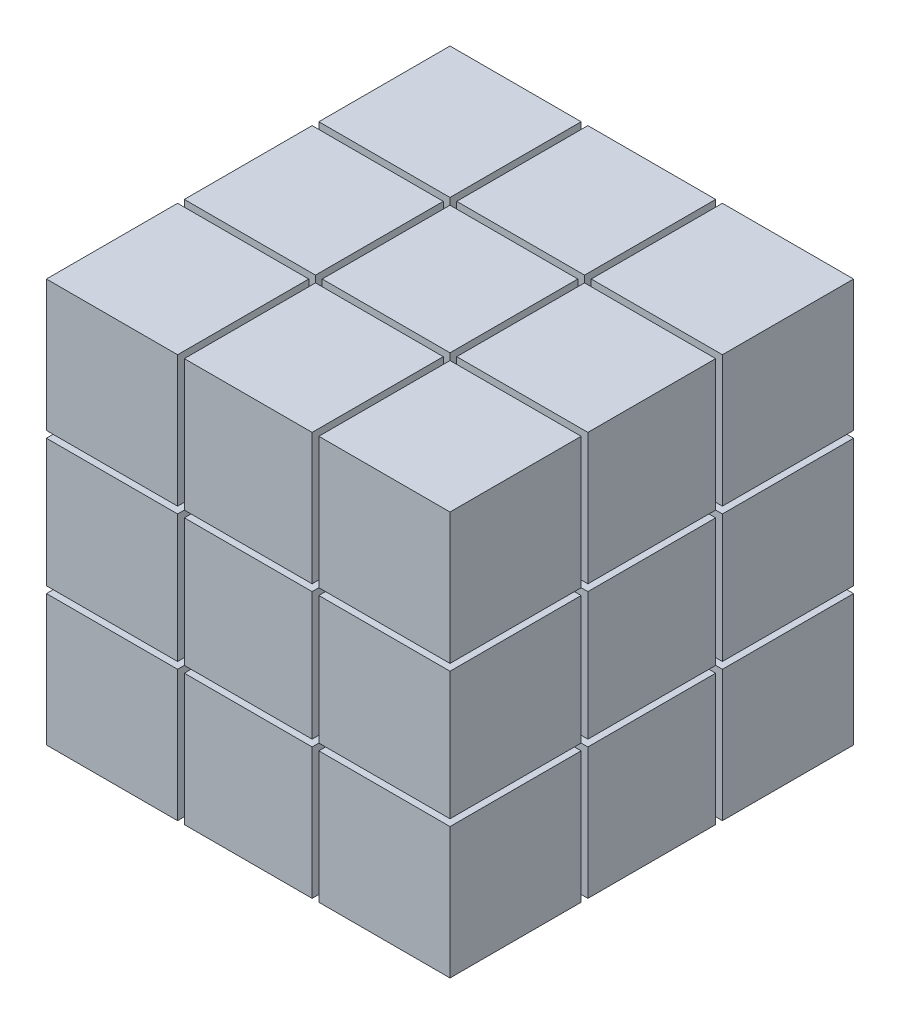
ISO-10303-21;
HEADER;
FILE_DESCRIPTION(('STEP AP214'),'2;1');
FILE_NAME('part.step','',(''),(''),'','','');
FILE_SCHEMA(('AUTOMOTIVE_DESIGN { 1 0 10303 214 1 1 1 1 }'));
ENDSEC;
DATA;
#1=APPLICATION_CONTEXT('core data for automotive mechanical design processes');
#2=APPLICATION_PROTOCOL_DEFINITION('international standard','automotive_design',2000,#1);
#3=PRODUCT_CONTEXT('',#1,'mechanical');
#4=PRODUCT('Part','Part','',(#3));
#5=PRODUCT_RELATED_PRODUCT_CATEGORY('part','',(#4));
#6=PRODUCT_DEFINITION_FORMATION('','',#4);
#7=PRODUCT_DEFINITION_CONTEXT('part definition',#1,'design');
#8=PRODUCT_DEFINITION('design','',#6,#7);
#9=PRODUCT_DEFINITION_SHAPE('','',#8);
#10=(LENGTH_UNIT() NAMED_UNIT(*) SI_UNIT(.MILLI.,.METRE.));
#11=(NAMED_UNIT(*) PLANE_ANGLE_UNIT() SI_UNIT($,.RADIAN.));
#12=(NAMED_UNIT(*) SI_UNIT($,.STERADIAN.) SOLID_ANGLE_UNIT());
#13=UNCERTAINTY_MEASURE_WITH_UNIT(LENGTH_MEASURE(1.E-05),#10,'distance_accuracy_value','');
#14=(GEOMETRIC_REPRESENTATION_CONTEXT(3) GLOBAL_UNCERTAINTY_ASSIGNED_CONTEXT((#13)) GLOBAL_UNIT_ASSIGNED_CONTEXT((#10,
#11,#12)) REPRESENTATION_CONTEXT('',''));
#15=CARTESIAN_POINT('',(0.,0.,0.));
#16=DIRECTION('',(0.,0.,1.));
#17=DIRECTION('',(1.,0.,0.));
#18=AXIS2_PLACEMENT_3D('',#15,#16,#17);
#19=CARTESIAN_POINT('',(30.,60.,-30.));
#20=DIRECTION('',(1.,0.,0.));
#21=DIRECTION('',(0.,0.,-1.));
#22=AXIS2_PLACEMENT_3D('',#19,#20,#21);
#23=PLANE('',#22);
#24=DIRECTION('',(0.,0.,-1.));
#25=VECTOR('',#24,1.);
#26=CARTESIAN_POINT('',(30.,19.5,36.0782148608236));
#27=LINE('',#26,#25);
#28=CARTESIAN_POINT('',(30.,19.5,-10.5));
#29=VERTEX_POINT('',#28);
#30=CARTESIAN_POINT('',(30.,19.5,-30.));
#31=VERTEX_POINT('',#30);
#32=EDGE_CURVE('E13',#29,#31,#27,.T.);
#33=ORIENTED_EDGE('',*,*,#32,.F.);
#34=DIRECTION('',(0.,-1.,0.));
#35=VECTOR('',#34,1.);
#36=CARTESIAN_POINT('',(30.,60.,-10.5));
#37=LINE('',#36,#35);
#38=CARTESIAN_POINT('',(30.,0.,-10.5));
#39=VERTEX_POINT('',#38);
#40=EDGE_CURVE('E186',#29,#39,#37,.T.);
#41=ORIENTED_EDGE('',*,*,#40,.T.);
#42=DIRECTION('',(0.,0.,1.));
#43=VECTOR('',#42,1.);
#44=CARTESIAN_POINT('',(30.,0.,-30.));
#45=LINE('',#44,#43);
#46=CARTESIAN_POINT('',(30.,0.,-30.));
#47=VERTEX_POINT('',#46);
#48=EDGE_CURVE('E202',#47,#39,#45,.T.);
#49=ORIENTED_EDGE('',*,*,#48,.F.);
#50=DIRECTION('',(0.,-1.,0.));
#51=VECTOR('',#50,1.);
#52=CARTESIAN_POINT('',(30.,60.,-30.));
#53=LINE('',#52,#51);
#54=EDGE_CURVE('E188',#31,#47,#53,.T.);
#55=ORIENTED_EDGE('',*,*,#54,.F.);
#56=EDGE_LOOP('',(#33,#41,#49,#55));
#57=FACE_BOUND('',#56,.T.);
#58=ADVANCED_FACE('F141',(#57),#23,.T.);
#59=CARTESIAN_POINT('',(30.,60.,-30.));
#60=DIRECTION('',(0.,0.,1.));
#61=DIRECTION('',(1.,0.,0.));
#62=AXIS2_PLACEMENT_3D('',#59,#60,#61);
#63=PLANE('',#62);
#64=DIRECTION('',(0.,-1.,0.));
#65=VECTOR('',#64,1.);
#66=CARTESIAN_POINT('',(10.5,60.,-30.));
#67=LINE('',#66,#65);
#68=CARTESIAN_POINT('',(10.5,19.5,-30.));
#69=VERTEX_POINT('',#68);
#70=CARTESIAN_POINT('',(10.5,0.,-30.));
#71=VERTEX_POINT('',#70);
#72=EDGE_CURVE('E144',#69,#71,#67,.T.);
#73=ORIENTED_EDGE('',*,*,#72,.F.);
#74=DIRECTION('',(1.,0.,0.));
#75=VECTOR('',#74,1.);
#76=CARTESIAN_POINT('',(30.,19.5,-30.));
#77=LINE('',#76,#75);
#78=EDGE_CURVE('E158',#69,#31,#77,.T.);
#79=ORIENTED_EDGE('',*,*,#78,.T.);
#80=ORIENTED_EDGE('',*,*,#54,.T.);
#81=DIRECTION('',(-1.,0.,0.));
#82=VECTOR('',#81,1.);
#83=CARTESIAN_POINT('',(30.,0.,-30.));
#84=LINE('',#83,#82);
#85=EDGE_CURVE('E197',#47,#71,#84,.T.);
#86=ORIENTED_EDGE('',*,*,#85,.T.);
#87=EDGE_LOOP('',(#73,#79,#80,#86));
#88=FACE_BOUND('',#87,.T.);
#89=ADVANCED_FACE('F213',(#88),#63,.F.);
#90=CARTESIAN_POINT('',(0.,0.,0.));
#91=DIRECTION('',(0.,-1.,0.));
#92=DIRECTION('',(0.,0.,-1.));
#93=AXIS2_PLACEMENT_3D('',#90,#91,#92);
#94=PLANE('',#93);
#95=DIRECTION('',(1.,0.,0.));
#96=VECTOR('',#95,1.);
#97=CARTESIAN_POINT('',(-45.320059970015,0.,-10.5));
#98=LINE('',#97,#96);
#99=CARTESIAN_POINT('',(10.5,0.,-10.5));
#100=VERTEX_POINT('',#99);
#101=EDGE_CURVE('E191',#100,#39,#98,.T.);
#102=ORIENTED_EDGE('',*,*,#101,.F.);
#103=DIRECTION('',(0.,0.,-1.));
#104=VECTOR('',#103,1.);
#105=CARTESIAN_POINT('',(10.5,0.,0.));
#106=LINE('',#105,#104);
#107=EDGE_CURVE('E205',#100,#71,#106,.T.);
#108=ORIENTED_EDGE('',*,*,#107,.T.);
#109=ORIENTED_EDGE('',*,*,#85,.F.);
#110=ORIENTED_EDGE('',*,*,#48,.T.);
#111=EDGE_LOOP('',(#102,#108,#109,#110));
#112=FACE_BOUND('',#111,.T.);
#113=ADVANCED_FACE('F214',(#112),#94,.T.);
#114=CARTESIAN_POINT('',(10.5,0.,-39.3984493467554));
#115=DIRECTION('',(-1.,0.,0.));
#116=DIRECTION('',(0.,0.,1.));
#117=AXIS2_PLACEMENT_3D('',#114,#115,#116);
#118=PLANE('',#117);
#119=DIRECTION('',(0.,0.,1.));
#120=VECTOR('',#119,1.);
#121=CARTESIAN_POINT('',(10.5,19.5,-39.3984493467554));
#122=LINE('',#121,#120);
#123=CARTESIAN_POINT('',(10.5,19.5,-10.5));
#124=VERTEX_POINT('',#123);
#125=EDGE_CURVE('E175',#69,#124,#122,.T.);
#126=ORIENTED_EDGE('',*,*,#125,.F.);
#127=ORIENTED_EDGE('',*,*,#72,.T.);
#128=ORIENTED_EDGE('',*,*,#107,.F.);
#129=DIRECTION('',(0.,1.,0.));
#130=VECTOR('',#129,1.);
#131=CARTESIAN_POINT('',(10.5,0.,-10.5));
#132=LINE('',#131,#130);
#133=EDGE_CURVE('E198',#100,#124,#132,.T.);
#134=ORIENTED_EDGE('',*,*,#133,.T.);
#135=EDGE_LOOP('',(#126,#127,#128,#134));
#136=FACE_BOUND('',#135,.T.);
#137=ADVANCED_FACE('F215',(#136),#118,.T.);
#138=CARTESIAN_POINT('',(-45.320059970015,0.,-10.5));
#139=DIRECTION('',(0.,0.,1.));
#140=DIRECTION('',(1.,0.,0.));
#141=AXIS2_PLACEMENT_3D('',#138,#139,#140);
#142=PLANE('',#141);
#143=DIRECTION('',(1.,0.,0.));
#144=VECTOR('',#143,1.);
#145=CARTESIAN_POINT('',(-45.320059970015,19.5,-10.5));
#146=LINE('',#145,#144);
#147=EDGE_CURVE('E150',#124,#29,#146,.T.);
#148=ORIENTED_EDGE('',*,*,#147,.F.);
#149=ORIENTED_EDGE('',*,*,#133,.F.);
#150=ORIENTED_EDGE('',*,*,#101,.T.);
#151=ORIENTED_EDGE('',*,*,#40,.F.);
#152=EDGE_LOOP('',(#148,#149,#150,#151));
#153=FACE_BOUND('',#152,.T.);
#154=ADVANCED_FACE('F189',(#153),#142,.T.);
#155=CARTESIAN_POINT('',(-30.,19.5,36.0782148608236));
#156=DIRECTION('',(0.,-1.,0.));
#157=DIRECTION('',(0.,0.,-1.));
#158=AXIS2_PLACEMENT_3D('',#155,#156,#157);
#159=PLANE('',#158);
#160=ORIENTED_EDGE('',*,*,#125,.T.);
#161=ORIENTED_EDGE('',*,*,#147,.T.);
#162=ORIENTED_EDGE('',*,*,#32,.T.);
#163=ORIENTED_EDGE('',*,*,#78,.F.);
#164=EDGE_LOOP('',(#160,#161,#162,#163));
#165=FACE_BOUND('',#164,.T.);
#166=ADVANCED_FACE('F178',(#165),#159,.F.);
#167=CLOSED_SHELL('',(#58,#89,#113,#137,#154,#166));
#168=MANIFOLD_SOLID_BREP('B2',#167);
#169=CARTESIAN_POINT('',(0.,60.,0.));
#170=DIRECTION('',(0.,-1.,0.));
#171=DIRECTION('',(0.,0.,-1.));
#172=AXIS2_PLACEMENT_3D('',#169,#170,#171);
#173=PLANE('',#172);
#174=DIRECTION('',(0.,0.,1.));
#175=VECTOR('',#174,1.);
#176=CARTESIAN_POINT('',(10.5,60.,-39.3984493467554));
#177=LINE('',#176,#175);
#178=CARTESIAN_POINT('',(10.5,60.,-30.));
#179=VERTEX_POINT('',#178);
#180=CARTESIAN_POINT('',(10.5,60.,-10.5));
#181=VERTEX_POINT('',#180);
#182=EDGE_CURVE('E341',#179,#181,#177,.T.);
#183=ORIENTED_EDGE('',*,*,#182,.T.);
#184=DIRECTION('',(1.,0.,0.));
#185=VECTOR('',#184,1.);
#186=CARTESIAN_POINT('',(-45.320059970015,60.,-10.5));
#187=LINE('',#186,#185);
#188=CARTESIAN_POINT('',(30.,60.,-10.5));
#189=VERTEX_POINT('',#188);
#190=EDGE_CURVE('E344',#181,#189,#187,.T.);
#191=ORIENTED_EDGE('',*,*,#190,.T.);
#192=DIRECTION('',(0.,0.,1.));
#193=VECTOR('',#192,1.);
#194=CARTESIAN_POINT('',(30.,60.,-30.));
#195=LINE('',#194,#193);
#196=CARTESIAN_POINT('',(30.,60.,-30.));
#197=VERTEX_POINT('',#196);
#198=EDGE_CURVE('E290',#197,#189,#195,.T.);
#199=ORIENTED_EDGE('',*,*,#198,.F.);
#200=DIRECTION('',(-1.,0.,0.));
#201=VECTOR('',#200,1.);
#202=CARTESIAN_POINT('',(30.,60.,-30.));
#203=LINE('',#202,#201);
#204=EDGE_CURVE('E332',#197,#179,#203,.T.);
#205=ORIENTED_EDGE('',*,*,#204,.T.);
#206=EDGE_LOOP('',(#183,#191,#199,#205));
#207=FACE_BOUND('',#206,.T.);
#208=ADVANCED_FACE('F280',(#207),#173,.F.);
#209=CARTESIAN_POINT('',(-45.320059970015,0.,-10.5));
#210=DIRECTION('',(0.,0.,1.));
#211=DIRECTION('',(1.,0.,0.));
#212=AXIS2_PLACEMENT_3D('',#209,#210,#211);
#213=PLANE('',#212);
#214=DIRECTION('',(0.,1.,0.));
#215=VECTOR('',#214,1.);
#216=CARTESIAN_POINT('',(10.5,0.,-10.5));
#217=LINE('',#216,#215);
#218=CARTESIAN_POINT('',(10.5,40.5,-10.5));
#219=VERTEX_POINT('',#218);
#220=EDGE_CURVE('E284',#219,#181,#217,.T.);
#221=ORIENTED_EDGE('',*,*,#220,.F.);
#222=DIRECTION('',(1.,0.,0.));
#223=VECTOR('',#222,1.);
#224=CARTESIAN_POINT('',(-45.320059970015,40.5,-10.5));
#225=LINE('',#224,#223);
#226=CARTESIAN_POINT('',(30.,40.5,-10.5));
#227=VERTEX_POINT('',#226);
#228=EDGE_CURVE('E337',#219,#227,#225,.T.);
#229=ORIENTED_EDGE('',*,*,#228,.T.);
#230=DIRECTION('',(0.,-1.,0.));
#231=VECTOR('',#230,1.);
#232=CARTESIAN_POINT('',(30.,60.,-10.5));
#233=LINE('',#232,#231);
#234=EDGE_CURVE('E328',#189,#227,#233,.T.);
#235=ORIENTED_EDGE('',*,*,#234,.F.);
#236=ORIENTED_EDGE('',*,*,#190,.F.);
#237=EDGE_LOOP('',(#221,#229,#235,#236));
#238=FACE_BOUND('',#237,.T.);
#239=ADVANCED_FACE('F350',(#238),#213,.T.);
#240=CARTESIAN_POINT('',(10.5,0.,-39.3984493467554));
#241=DIRECTION('',(-1.,0.,0.));
#242=DIRECTION('',(0.,0.,1.));
#243=AXIS2_PLACEMENT_3D('',#240,#241,#242);
#244=PLANE('',#243);
#245=DIRECTION('',(0.,-1.,0.));
#246=VECTOR('',#245,1.);
#247=CARTESIAN_POINT('',(10.5,60.,-30.));
#248=LINE('',#247,#246);
#249=CARTESIAN_POINT('',(10.5,40.5,-30.));
#250=VERTEX_POINT('',#249);
#251=EDGE_CURVE('E336',#179,#250,#248,.T.);
#252=ORIENTED_EDGE('',*,*,#251,.T.);
#253=DIRECTION('',(0.,0.,1.));
#254=VECTOR('',#253,1.);
#255=CARTESIAN_POINT('',(10.5,40.5,-39.3984493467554));
#256=LINE('',#255,#254);
#257=EDGE_CURVE('E298',#250,#219,#256,.T.);
#258=ORIENTED_EDGE('',*,*,#257,.T.);
#259=ORIENTED_EDGE('',*,*,#220,.T.);
#260=ORIENTED_EDGE('',*,*,#182,.F.);
#261=EDGE_LOOP('',(#252,#258,#259,#260));
#262=FACE_BOUND('',#261,.T.);
#263=ADVANCED_FACE('F353',(#262),#244,.T.);
#264=CARTESIAN_POINT('',(30.,60.,-30.));
#265=DIRECTION('',(0.,0.,1.));
#266=DIRECTION('',(1.,0.,0.));
#267=AXIS2_PLACEMENT_3D('',#264,#265,#266);
#268=PLANE('',#267);
#269=DIRECTION('',(1.,0.,0.));
#270=VECTOR('',#269,1.);
#271=CARTESIAN_POINT('',(30.,40.5,-30.));
#272=LINE('',#271,#270);
#273=CARTESIAN_POINT('',(30.,40.5,-30.));
#274=VERTEX_POINT('',#273);
#275=EDGE_CURVE('E139',#250,#274,#272,.T.);
#276=ORIENTED_EDGE('',*,*,#275,.F.);
#277=ORIENTED_EDGE('',*,*,#251,.F.);
#278=ORIENTED_EDGE('',*,*,#204,.F.);
#279=DIRECTION('',(0.,-1.,0.));
#280=VECTOR('',#279,1.);
#281=CARTESIAN_POINT('',(30.,60.,-30.));
#282=LINE('',#281,#280);
#283=EDGE_CURVE('E326',#197,#274,#282,.T.);
#284=ORIENTED_EDGE('',*,*,#283,.T.);
#285=EDGE_LOOP('',(#276,#277,#278,#284));
#286=FACE_BOUND('',#285,.T.);
#287=ADVANCED_FACE('F330',(#286),#268,.F.);
#288=CARTESIAN_POINT('',(30.,60.,-30.));
#289=DIRECTION('',(1.,0.,0.));
#290=DIRECTION('',(0.,0.,-1.));
#291=AXIS2_PLACEMENT_3D('',#288,#289,#290);
#292=PLANE('',#291);
#293=ORIENTED_EDGE('',*,*,#234,.T.);
#294=DIRECTION('',(0.,0.,-1.));
#295=VECTOR('',#294,1.);
#296=CARTESIAN_POINT('',(30.,40.5,33.685760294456));
#297=LINE('',#296,#295);
#298=EDGE_CURVE('E316',#227,#274,#297,.T.);
#299=ORIENTED_EDGE('',*,*,#298,.T.);
#300=ORIENTED_EDGE('',*,*,#283,.F.);
#301=ORIENTED_EDGE('',*,*,#198,.T.);
#302=EDGE_LOOP('',(#293,#299,#300,#301));
#303=FACE_BOUND('',#302,.T.);
#304=ADVANCED_FACE('F282',(#303),#292,.T.);
#305=CARTESIAN_POINT('',(-30.,40.5,33.685760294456));
#306=DIRECTION('',(0.,-1.,0.));
#307=DIRECTION('',(0.,0.,-1.));
#308=AXIS2_PLACEMENT_3D('',#305,#306,#307);
#309=PLANE('',#308);
#310=ORIENTED_EDGE('',*,*,#275,.T.);
#311=ORIENTED_EDGE('',*,*,#298,.F.);
#312=ORIENTED_EDGE('',*,*,#228,.F.);
#313=ORIENTED_EDGE('',*,*,#257,.F.);
#314=EDGE_LOOP('',(#310,#311,#312,#313));
#315=FACE_BOUND('',#314,.T.);
#316=ADVANCED_FACE('F318',(#315),#309,.T.);
#317=CLOSED_SHELL('',(#208,#239,#263,#287,#304,#316));
#318=MANIFOLD_SOLID_BREP('B7',#317);
#319=CARTESIAN_POINT('',(0.,0.,0.));
#320=DIRECTION('',(0.,-1.,0.));
#321=DIRECTION('',(0.,0.,-1.));
#322=AXIS2_PLACEMENT_3D('',#319,#320,#321);
#323=PLANE('',#322);
#324=DIRECTION('',(0.,0.,1.));
#325=VECTOR('',#324,1.);
#326=CARTESIAN_POINT('',(-10.5,0.,-36.3981666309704));
#327=LINE('',#326,#325);
#328=CARTESIAN_POINT('',(-10.5,0.,-9.5));
#329=VERTEX_POINT('',#328);
#330=CARTESIAN_POINT('',(-10.5,0.,9.5));
#331=VERTEX_POINT('',#330);
#332=EDGE_CURVE('E480',#329,#331,#327,.T.);
#333=ORIENTED_EDGE('',*,*,#332,.T.);
#334=DIRECTION('',(-1.,0.,0.));
#335=VECTOR('',#334,1.);
#336=CARTESIAN_POINT('',(0.,0.,9.5));
#337=LINE('',#336,#335);
#338=CARTESIAN_POINT('',(-30.,0.,9.5));
#339=VERTEX_POINT('',#338);
#340=EDGE_CURVE('E469',#331,#339,#337,.T.);
#341=ORIENTED_EDGE('',*,*,#340,.T.);
#342=DIRECTION('',(0.,0.,1.));
#343=VECTOR('',#342,1.);
#344=CARTESIAN_POINT('',(-30.,0.,-30.));
#345=LINE('',#344,#343);
#346=CARTESIAN_POINT('',(-30.,0.,-9.5));
#347=VERTEX_POINT('',#346);
#348=EDGE_CURVE('E474',#347,#339,#345,.T.);
#349=ORIENTED_EDGE('',*,*,#348,.F.);
#350=DIRECTION('',(-1.,0.,0.));
#351=VECTOR('',#350,1.);
#352=CARTESIAN_POINT('',(0.,0.,-9.5));
#353=LINE('',#352,#351);
#354=EDGE_CURVE('E472',#329,#347,#353,.T.);
#355=ORIENTED_EDGE('',*,*,#354,.F.);
#356=EDGE_LOOP('',(#333,#341,#349,#355));
#357=FACE_BOUND('',#356,.T.);
#358=ADVANCED_FACE('F417',(#357),#323,.T.);
#359=CARTESIAN_POINT('',(-30.,60.,-30.));
#360=DIRECTION('',(1.,0.,0.));
#361=DIRECTION('',(0.,0.,-1.));
#362=AXIS2_PLACEMENT_3D('',#359,#360,#361);
#363=PLANE('',#362);
#364=DIRECTION('',(0.,-1.,0.));
#365=VECTOR('',#364,1.);
#366=CARTESIAN_POINT('',(-30.,60.,9.49999999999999));
#367=LINE('',#366,#365);
#368=CARTESIAN_POINT('',(-30.,19.5,9.5));
#369=VERTEX_POINT('',#368);
#370=EDGE_CURVE('E470',#369,#339,#367,.T.);
#371=ORIENTED_EDGE('',*,*,#370,.F.);
#372=DIRECTION('',(0.,0.,-1.));
#373=VECTOR('',#372,1.);
#374=CARTESIAN_POINT('',(-30.,19.5,36.0782148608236));
#375=LINE('',#374,#373);
#376=CARTESIAN_POINT('',(-30.,19.5,-9.49999999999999));
#377=VERTEX_POINT('',#376);
#378=EDGE_CURVE('E433',#369,#377,#375,.T.);
#379=ORIENTED_EDGE('',*,*,#378,.T.);
#380=DIRECTION('',(0.,-1.,0.));
#381=VECTOR('',#380,1.);
#382=CARTESIAN_POINT('',(-30.,60.,-9.5));
#383=LINE('',#382,#381);
#384=EDGE_CURVE('E476',#377,#347,#383,.T.);
#385=ORIENTED_EDGE('',*,*,#384,.T.);
#386=ORIENTED_EDGE('',*,*,#348,.T.);
#387=EDGE_LOOP('',(#371,#379,#385,#386));
#388=FACE_BOUND('',#387,.T.);
#389=ADVANCED_FACE('F419',(#388),#363,.F.);
#390=CARTESIAN_POINT('',(-53.6892696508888,0.,9.5));
#391=DIRECTION('',(0.,0.,1.));
#392=DIRECTION('',(1.,0.,0.));
#393=AXIS2_PLACEMENT_3D('',#390,#391,#392);
#394=PLANE('',#393);
#395=DIRECTION('',(1.,0.,0.));
#396=VECTOR('',#395,1.);
#397=CARTESIAN_POINT('',(-53.6892696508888,19.5,9.5));
#398=LINE('',#397,#396);
#399=CARTESIAN_POINT('',(-10.5,19.5,9.5));
#400=VERTEX_POINT('',#399);
#401=EDGE_CURVE('E278',#369,#400,#398,.T.);
#402=ORIENTED_EDGE('',*,*,#401,.F.);
#403=ORIENTED_EDGE('',*,*,#370,.T.);
#404=ORIENTED_EDGE('',*,*,#340,.F.);
#405=DIRECTION('',(0.,1.,0.));
#406=VECTOR('',#405,1.);
#407=CARTESIAN_POINT('',(-10.5,0.,9.5));
#408=LINE('',#407,#406);
#409=EDGE_CURVE('E463',#331,#400,#408,.T.);
#410=ORIENTED_EDGE('',*,*,#409,.T.);
#411=EDGE_LOOP('',(#402,#403,#404,#410));
#412=FACE_BOUND('',#411,.T.);
#413=ADVANCED_FACE('F467',(#412),#394,.T.);
#414=CARTESIAN_POINT('',(-45.320059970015,0.,-9.5));
#415=DIRECTION('',(0.,0.,1.));
#416=DIRECTION('',(1.,0.,0.));
#417=AXIS2_PLACEMENT_3D('',#414,#415,#416);
#418=PLANE('',#417);
#419=ORIENTED_EDGE('',*,*,#384,.F.);
#420=DIRECTION('',(1.,0.,0.));
#421=VECTOR('',#420,1.);
#422=CARTESIAN_POINT('',(-45.320059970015,19.5,-9.5));
#423=LINE('',#422,#421);
#424=CARTESIAN_POINT('',(-10.5,19.5,-9.49999999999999));
#425=VERTEX_POINT('',#424);
#426=EDGE_CURVE('E438',#377,#425,#423,.T.);
#427=ORIENTED_EDGE('',*,*,#426,.T.);
#428=DIRECTION('',(0.,1.,0.));
#429=VECTOR('',#428,1.);
#430=CARTESIAN_POINT('',(-10.5,0.,-9.5));
#431=LINE('',#430,#429);
#432=EDGE_CURVE('E421',#329,#425,#431,.T.);
#433=ORIENTED_EDGE('',*,*,#432,.F.);
#434=ORIENTED_EDGE('',*,*,#354,.T.);
#435=EDGE_LOOP('',(#419,#427,#433,#434));
#436=FACE_BOUND('',#435,.T.);
#437=ADVANCED_FACE('F491',(#436),#418,.F.);
#438=CARTESIAN_POINT('',(-10.5,0.,-36.3981666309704));
#439=DIRECTION('',(-1.,0.,0.));
#440=DIRECTION('',(0.,0.,1.));
#441=AXIS2_PLACEMENT_3D('',#438,#439,#440);
#442=PLANE('',#441);
#443=ORIENTED_EDGE('',*,*,#432,.T.);
#444=DIRECTION('',(0.,0.,1.));
#445=VECTOR('',#444,1.);
#446=CARTESIAN_POINT('',(-10.5,19.5,-36.3981666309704));
#447=LINE('',#446,#445);
#448=EDGE_CURVE('E426',#425,#400,#447,.T.);
#449=ORIENTED_EDGE('',*,*,#448,.T.);
#450=ORIENTED_EDGE('',*,*,#409,.F.);
#451=ORIENTED_EDGE('',*,*,#332,.F.);
#452=EDGE_LOOP('',(#443,#449,#450,#451));
#453=FACE_BOUND('',#452,.T.);
#454=ADVANCED_FACE('F462',(#453),#442,.F.);
#455=CARTESIAN_POINT('',(-30.,19.5,36.0782148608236));
#456=DIRECTION('',(0.,-1.,0.));
#457=DIRECTION('',(0.,0.,-1.));
#458=AXIS2_PLACEMENT_3D('',#455,#456,#457);
#459=PLANE('',#458);
#460=ORIENTED_EDGE('',*,*,#401,.T.);
#461=ORIENTED_EDGE('',*,*,#448,.F.);
#462=ORIENTED_EDGE('',*,*,#426,.F.);
#463=ORIENTED_EDGE('',*,*,#378,.F.);
#464=EDGE_LOOP('',(#460,#461,#462,#463));
#465=FACE_BOUND('',#464,.T.);
#466=ADVANCED_FACE('F455',(#465),#459,.F.);
#467=CLOSED_SHELL('',(#358,#389,#413,#437,#454,#466));
#468=MANIFOLD_SOLID_BREP('B133',#467);
#469=CARTESIAN_POINT('',(0.,60.,0.));
#470=DIRECTION('',(0.,-1.,0.));
#471=DIRECTION('',(0.,0.,-1.));
#472=AXIS2_PLACEMENT_3D('',#469,#470,#471);
#473=PLANE('',#472);
#474=DIRECTION('',(1.,0.,0.));
#475=VECTOR('',#474,1.);
#476=CARTESIAN_POINT('',(-53.6892696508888,60.,9.5));
#477=LINE('',#476,#475);
#478=CARTESIAN_POINT('',(-30.,60.,9.5));
#479=VERTEX_POINT('',#478);
#480=CARTESIAN_POINT('',(-10.5,60.,9.5));
#481=VERTEX_POINT('',#480);
#482=EDGE_CURVE('E589',#479,#481,#477,.T.);
#483=ORIENTED_EDGE('',*,*,#482,.T.);
#484=DIRECTION('',(0.,0.,1.));
#485=VECTOR('',#484,1.);
#486=CARTESIAN_POINT('',(-10.5,60.,-36.3981666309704));
#487=LINE('',#486,#485);
#488=CARTESIAN_POINT('',(-10.5,60.,-9.5));
#489=VERTEX_POINT('',#488);
#490=EDGE_CURVE('E605',#489,#481,#487,.T.);
#491=ORIENTED_EDGE('',*,*,#490,.F.);
#492=DIRECTION('',(1.,0.,0.));
#493=VECTOR('',#492,1.);
#494=CARTESIAN_POINT('',(-45.320059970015,60.,-9.5));
#495=LINE('',#494,#493);
#496=CARTESIAN_POINT('',(-30.,60.,-9.5));
#497=VERTEX_POINT('',#496);
#498=EDGE_CURVE('E609',#497,#489,#495,.T.);
#499=ORIENTED_EDGE('',*,*,#498,.F.);
#500=DIRECTION('',(0.,0.,1.));
#501=VECTOR('',#500,1.);
#502=CARTESIAN_POINT('',(-30.,60.,-30.));
#503=LINE('',#502,#501);
#504=EDGE_CURVE('E607',#497,#479,#503,.T.);
#505=ORIENTED_EDGE('',*,*,#504,.T.);
#506=EDGE_LOOP('',(#483,#491,#499,#505));
#507=FACE_BOUND('',#506,.T.);
#508=ADVANCED_FACE('F554',(#507),#473,.F.);
#509=CARTESIAN_POINT('',(-10.5,0.,-36.3981666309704));
#510=DIRECTION('',(-1.,0.,0.));
#511=DIRECTION('',(0.,0.,1.));
#512=AXIS2_PLACEMENT_3D('',#509,#510,#511);
#513=PLANE('',#512);
#514=DIRECTION('',(0.,0.,1.));
#515=VECTOR('',#514,1.);
#516=CARTESIAN_POINT('',(-10.5,40.5,-36.3981666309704));
#517=LINE('',#516,#515);
#518=CARTESIAN_POINT('',(-10.5,40.5,-9.5));
#519=VERTEX_POINT('',#518);
#520=CARTESIAN_POINT('',(-10.5,40.5,9.5));
#521=VERTEX_POINT('',#520);
#522=EDGE_CURVE('E415',#519,#521,#517,.T.);
#523=ORIENTED_EDGE('',*,*,#522,.F.);
#524=DIRECTION('',(0.,1.,0.));
#525=VECTOR('',#524,1.);
#526=CARTESIAN_POINT('',(-10.5,0.,-9.5));
#527=LINE('',#526,#525);
#528=EDGE_CURVE('E558',#519,#489,#527,.T.);
#529=ORIENTED_EDGE('',*,*,#528,.T.);
#530=ORIENTED_EDGE('',*,*,#490,.T.);
#531=DIRECTION('',(0.,1.,0.));
#532=VECTOR('',#531,1.);
#533=CARTESIAN_POINT('',(-10.5,0.,9.5));
#534=LINE('',#533,#532);
#535=EDGE_CURVE('E594',#521,#481,#534,.T.);
#536=ORIENTED_EDGE('',*,*,#535,.F.);
#537=EDGE_LOOP('',(#523,#529,#530,#536));
#538=FACE_BOUND('',#537,.T.);
#539=ADVANCED_FACE('F603',(#538),#513,.F.);
#540=CARTESIAN_POINT('',(-45.320059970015,0.,-9.5));
#541=DIRECTION('',(0.,0.,1.));
#542=DIRECTION('',(1.,0.,0.));
#543=AXIS2_PLACEMENT_3D('',#540,#541,#542);
#544=PLANE('',#543);
#545=DIRECTION('',(1.,0.,0.));
#546=VECTOR('',#545,1.);
#547=CARTESIAN_POINT('',(-45.320059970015,40.5,-9.5));
#548=LINE('',#547,#546);
#549=CARTESIAN_POINT('',(-30.,40.5,-9.49999999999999));
#550=VERTEX_POINT('',#549);
#551=EDGE_CURVE('E563',#550,#519,#548,.T.);
#552=ORIENTED_EDGE('',*,*,#551,.F.);
#553=DIRECTION('',(0.,-1.,0.));
#554=VECTOR('',#553,1.);
#555=CARTESIAN_POINT('',(-30.,60.,-9.5));
#556=LINE('',#555,#554);
#557=EDGE_CURVE('E612',#497,#550,#556,.T.);
#558=ORIENTED_EDGE('',*,*,#557,.F.);
#559=ORIENTED_EDGE('',*,*,#498,.T.);
#560=ORIENTED_EDGE('',*,*,#528,.F.);
#561=EDGE_LOOP('',(#552,#558,#559,#560));
#562=FACE_BOUND('',#561,.T.);
#563=ADVANCED_FACE('F610',(#562),#544,.F.);
#564=CARTESIAN_POINT('',(-53.6892696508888,0.,9.5));
#565=DIRECTION('',(0.,0.,1.));
#566=DIRECTION('',(1.,0.,0.));
#567=AXIS2_PLACEMENT_3D('',#564,#565,#566);
#568=PLANE('',#567);
#569=DIRECTION('',(0.,-1.,0.));
#570=VECTOR('',#569,1.);
#571=CARTESIAN_POINT('',(-30.,60.,9.49999999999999));
#572=LINE('',#571,#570);
#573=CARTESIAN_POINT('',(-30.,40.5,9.5));
#574=VERTEX_POINT('',#573);
#575=EDGE_CURVE('E616',#479,#574,#572,.T.);
#576=ORIENTED_EDGE('',*,*,#575,.T.);
#577=DIRECTION('',(1.,0.,0.));
#578=VECTOR('',#577,1.);
#579=CARTESIAN_POINT('',(-53.6892696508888,40.5,9.5));
#580=LINE('',#579,#578);
#581=EDGE_CURVE('E570',#574,#521,#580,.T.);
#582=ORIENTED_EDGE('',*,*,#581,.T.);
#583=ORIENTED_EDGE('',*,*,#535,.T.);
#584=ORIENTED_EDGE('',*,*,#482,.F.);
#585=EDGE_LOOP('',(#576,#582,#583,#584));
#586=FACE_BOUND('',#585,.T.);
#587=ADVANCED_FACE('F627',(#586),#568,.T.);
#588=CARTESIAN_POINT('',(-30.,60.,-30.));
#589=DIRECTION('',(1.,0.,0.));
#590=DIRECTION('',(0.,0.,-1.));
#591=AXIS2_PLACEMENT_3D('',#588,#589,#590);
#592=PLANE('',#591);
#593=DIRECTION('',(0.,0.,-1.));
#594=VECTOR('',#593,1.);
#595=CARTESIAN_POINT('',(-30.,40.5,33.685760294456));
#596=LINE('',#595,#594);
#597=EDGE_CURVE('E581',#574,#550,#596,.T.);
#598=ORIENTED_EDGE('',*,*,#597,.F.);
#599=ORIENTED_EDGE('',*,*,#575,.F.);
#600=ORIENTED_EDGE('',*,*,#504,.F.);
#601=ORIENTED_EDGE('',*,*,#557,.T.);
#602=EDGE_LOOP('',(#598,#599,#600,#601));
#603=FACE_BOUND('',#602,.T.);
#604=ADVANCED_FACE('F556',(#603),#592,.F.);
#605=CARTESIAN_POINT('',(-30.,40.5,33.685760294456));
#606=DIRECTION('',(0.,-1.,0.));
#607=DIRECTION('',(0.,0.,-1.));
#608=AXIS2_PLACEMENT_3D('',#605,#606,#607);
#609=PLANE('',#608);
#610=ORIENTED_EDGE('',*,*,#597,.T.);
#611=ORIENTED_EDGE('',*,*,#551,.T.);
#612=ORIENTED_EDGE('',*,*,#522,.T.);
#613=ORIENTED_EDGE('',*,*,#581,.F.);
#614=EDGE_LOOP('',(#610,#611,#612,#613));
#615=FACE_BOUND('',#614,.T.);
#616=ADVANCED_FACE('F633',(#615),#609,.T.);
#617=CLOSED_SHELL('',(#508,#539,#563,#587,#604,#616));
#618=MANIFOLD_SOLID_BREP('B272',#617);
#619=CARTESIAN_POINT('',(0.,0.,0.));
#620=DIRECTION('',(0.,-1.,0.));
#621=DIRECTION('',(0.,0.,-1.));
#622=AXIS2_PLACEMENT_3D('',#619,#620,#621);
#623=PLANE('',#622);
#624=DIRECTION('',(0.,0.,1.));
#625=VECTOR('',#624,1.);
#626=CARTESIAN_POINT('',(-10.5,0.,-36.3981666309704));
#627=LINE('',#626,#625);
#628=CARTESIAN_POINT('',(-10.5,0.,10.5));
#629=VERTEX_POINT('',#628);
#630=CARTESIAN_POINT('',(-10.5,0.,30.));
#631=VERTEX_POINT('',#630);
#632=EDGE_CURVE('E752',#629,#631,#627,.T.);
#633=ORIENTED_EDGE('',*,*,#632,.T.);
#634=DIRECTION('',(-1.,0.,0.));
#635=VECTOR('',#634,1.);
#636=CARTESIAN_POINT('',(30.,0.,30.));
#637=LINE('',#636,#635);
#638=CARTESIAN_POINT('',(-30.,0.,30.));
#639=VERTEX_POINT('',#638);
#640=EDGE_CURVE('E740',#631,#639,#637,.T.);
#641=ORIENTED_EDGE('',*,*,#640,.T.);
#642=DIRECTION('',(0.,0.,1.));
#643=VECTOR('',#642,1.);
#644=CARTESIAN_POINT('',(-30.,0.,-30.));
#645=LINE('',#644,#643);
#646=CARTESIAN_POINT('',(-30.,0.,10.5));
#647=VERTEX_POINT('',#646);
#648=EDGE_CURVE('E744',#647,#639,#645,.T.);
#649=ORIENTED_EDGE('',*,*,#648,.F.);
#650=DIRECTION('',(-1.,0.,0.));
#651=VECTOR('',#650,1.);
#652=CARTESIAN_POINT('',(0.,0.,10.5));
#653=LINE('',#652,#651);
#654=EDGE_CURVE('E748',#629,#647,#653,.T.);
#655=ORIENTED_EDGE('',*,*,#654,.F.);
#656=EDGE_LOOP('',(#633,#641,#649,#655));
#657=FACE_BOUND('',#656,.T.);
#658=ADVANCED_FACE('F689',(#657),#623,.T.);
#659=CARTESIAN_POINT('',(30.,60.,30.));
#660=DIRECTION('',(0.,0.,1.));
#661=DIRECTION('',(1.,0.,0.));
#662=AXIS2_PLACEMENT_3D('',#659,#660,#661);
#663=PLANE('',#662);
#664=DIRECTION('',(1.,0.,0.));
#665=VECTOR('',#664,1.);
#666=CARTESIAN_POINT('',(30.,19.5,30.));
#667=LINE('',#666,#665);
#668=CARTESIAN_POINT('',(-30.,19.5,30.));
#669=VERTEX_POINT('',#668);
#670=CARTESIAN_POINT('',(-10.5,19.5,30.));
#671=VERTEX_POINT('',#670);
#672=EDGE_CURVE('E552',#669,#671,#667,.T.);
#673=ORIENTED_EDGE('',*,*,#672,.F.);
#674=DIRECTION('',(0.,-1.,0.));
#675=VECTOR('',#674,1.);
#676=CARTESIAN_POINT('',(-30.,60.,30.));
#677=LINE('',#676,#675);
#678=EDGE_CURVE('E745',#669,#639,#677,.T.);
#679=ORIENTED_EDGE('',*,*,#678,.T.);
#680=ORIENTED_EDGE('',*,*,#640,.F.);
#681=DIRECTION('',(0.,-1.,0.));
#682=VECTOR('',#681,1.);
#683=CARTESIAN_POINT('',(-10.5,60.,30.));
#684=LINE('',#683,#682);
#685=EDGE_CURVE('E698',#671,#631,#684,.T.);
#686=ORIENTED_EDGE('',*,*,#685,.F.);
#687=EDGE_LOOP('',(#673,#679,#680,#686));
#688=FACE_BOUND('',#687,.T.);
#689=ADVANCED_FACE('F691',(#688),#663,.T.);
#690=CARTESIAN_POINT('',(-30.,60.,-30.));
#691=DIRECTION('',(1.,0.,0.));
#692=DIRECTION('',(0.,0.,-1.));
#693=AXIS2_PLACEMENT_3D('',#690,#691,#692);
#694=PLANE('',#693);
#695=ORIENTED_EDGE('',*,*,#678,.F.);
#696=DIRECTION('',(0.,0.,-1.));
#697=VECTOR('',#696,1.);
#698=CARTESIAN_POINT('',(-30.,19.5,36.0782148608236));
#699=LINE('',#698,#697);
#700=CARTESIAN_POINT('',(-30.,19.5,10.5));
#701=VERTEX_POINT('',#700);
#702=EDGE_CURVE('E705',#669,#701,#699,.T.);
#703=ORIENTED_EDGE('',*,*,#702,.T.);
#704=DIRECTION('',(0.,-1.,0.));
#705=VECTOR('',#704,1.);
#706=CARTESIAN_POINT('',(-30.,60.,10.5));
#707=LINE('',#706,#705);
#708=EDGE_CURVE('E742',#701,#647,#707,.T.);
#709=ORIENTED_EDGE('',*,*,#708,.T.);
#710=ORIENTED_EDGE('',*,*,#648,.T.);
#711=EDGE_LOOP('',(#695,#703,#709,#710));
#712=FACE_BOUND('',#711,.T.);
#713=ADVANCED_FACE('F758',(#712),#694,.F.);
#714=CARTESIAN_POINT('',(-53.6892696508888,0.,10.5));
#715=DIRECTION('',(0.,0.,1.));
#716=DIRECTION('',(1.,0.,0.));
#717=AXIS2_PLACEMENT_3D('',#714,#715,#716);
#718=PLANE('',#717);
#719=ORIENTED_EDGE('',*,*,#708,.F.);
#720=DIRECTION('',(1.,0.,0.));
#721=VECTOR('',#720,1.);
#722=CARTESIAN_POINT('',(-53.6892696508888,19.5,10.5));
#723=LINE('',#722,#721);
#724=CARTESIAN_POINT('',(-10.5,19.5,10.5));
#725=VERTEX_POINT('',#724);
#726=EDGE_CURVE('E710',#701,#725,#723,.T.);
#727=ORIENTED_EDGE('',*,*,#726,.T.);
#728=DIRECTION('',(0.,1.,0.));
#729=VECTOR('',#728,1.);
#730=CARTESIAN_POINT('',(-10.5,0.,10.5));
#731=LINE('',#730,#729);
#732=EDGE_CURVE('E693',#629,#725,#731,.T.);
#733=ORIENTED_EDGE('',*,*,#732,.F.);
#734=ORIENTED_EDGE('',*,*,#654,.T.);
#735=EDGE_LOOP('',(#719,#727,#733,#734));
#736=FACE_BOUND('',#735,.T.);
#737=ADVANCED_FACE('F763',(#736),#718,.F.);
#738=CARTESIAN_POINT('',(-10.5,0.,-36.3981666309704));
#739=DIRECTION('',(-1.,0.,0.));
#740=DIRECTION('',(0.,0.,1.));
#741=AXIS2_PLACEMENT_3D('',#738,#739,#740);
#742=PLANE('',#741);
#743=ORIENTED_EDGE('',*,*,#732,.T.);
#744=DIRECTION('',(0.,0.,1.));
#745=VECTOR('',#744,1.);
#746=CARTESIAN_POINT('',(-10.5,19.5,-36.3981666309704));
#747=LINE('',#746,#745);
#748=EDGE_CURVE('E728',#725,#671,#747,.T.);
#749=ORIENTED_EDGE('',*,*,#748,.T.);
#750=ORIENTED_EDGE('',*,*,#685,.T.);
#751=ORIENTED_EDGE('',*,*,#632,.F.);
#752=EDGE_LOOP('',(#743,#749,#750,#751));
#753=FACE_BOUND('',#752,.T.);
#754=ADVANCED_FACE('F734',(#753),#742,.F.);
#755=CARTESIAN_POINT('',(-30.,19.5,36.0782148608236));
#756=DIRECTION('',(0.,-1.,0.));
#757=DIRECTION('',(0.,0.,-1.));
#758=AXIS2_PLACEMENT_3D('',#755,#756,#757);
#759=PLANE('',#758);
#760=ORIENTED_EDGE('',*,*,#672,.T.);
#761=ORIENTED_EDGE('',*,*,#748,.F.);
#762=ORIENTED_EDGE('',*,*,#726,.F.);
#763=ORIENTED_EDGE('',*,*,#702,.F.);
#764=EDGE_LOOP('',(#760,#761,#762,#763));
#765=FACE_BOUND('',#764,.T.);
#766=ADVANCED_FACE('F727',(#765),#759,.F.);
#767=CLOSED_SHELL('',(#658,#689,#713,#737,#754,#766));
#768=MANIFOLD_SOLID_BREP('B409',#767);
#769=CARTESIAN_POINT('',(0.,60.,0.));
#770=DIRECTION('',(0.,-1.,0.));
#771=DIRECTION('',(0.,0.,-1.));
#772=AXIS2_PLACEMENT_3D('',#769,#770,#771);
#773=PLANE('',#772);
#774=DIRECTION('',(-1.,0.,0.));
#775=VECTOR('',#774,1.);
#776=CARTESIAN_POINT('',(30.,60.,30.));
#777=LINE('',#776,#775);
#778=CARTESIAN_POINT('',(-10.5,60.,30.));
#779=VERTEX_POINT('',#778);
#780=CARTESIAN_POINT('',(-30.,60.,30.));
#781=VERTEX_POINT('',#780);
#782=EDGE_CURVE('E863',#779,#781,#777,.T.);
#783=ORIENTED_EDGE('',*,*,#782,.F.);
#784=DIRECTION('',(0.,0.,1.));
#785=VECTOR('',#784,1.);
#786=CARTESIAN_POINT('',(-10.5,60.,-36.3981666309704));
#787=LINE('',#786,#785);
#788=CARTESIAN_POINT('',(-10.5,60.,10.5));
#789=VERTEX_POINT('',#788);
#790=EDGE_CURVE('E882',#789,#779,#787,.T.);
#791=ORIENTED_EDGE('',*,*,#790,.F.);
#792=DIRECTION('',(1.,0.,0.));
#793=VECTOR('',#792,1.);
#794=CARTESIAN_POINT('',(-53.6892696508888,60.,10.5));
#795=LINE('',#794,#793);
#796=CARTESIAN_POINT('',(-30.,60.,10.5));
#797=VERTEX_POINT('',#796);
#798=EDGE_CURVE('E884',#797,#789,#795,.T.);
#799=ORIENTED_EDGE('',*,*,#798,.F.);
#800=DIRECTION('',(0.,0.,1.));
#801=VECTOR('',#800,1.);
#802=CARTESIAN_POINT('',(-30.,60.,-30.));
#803=LINE('',#802,#801);
#804=EDGE_CURVE('E883',#797,#781,#803,.T.);
#805=ORIENTED_EDGE('',*,*,#804,.T.);
#806=EDGE_LOOP('',(#783,#791,#799,#805));
#807=FACE_BOUND('',#806,.T.);
#808=ADVANCED_FACE('F828',(#807),#773,.F.);
#809=CARTESIAN_POINT('',(-10.5,0.,-36.3981666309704));
#810=DIRECTION('',(-1.,0.,0.));
#811=DIRECTION('',(0.,0.,1.));
#812=AXIS2_PLACEMENT_3D('',#809,#810,#811);
#813=PLANE('',#812);
#814=DIRECTION('',(0.,0.,1.));
#815=VECTOR('',#814,1.);
#816=CARTESIAN_POINT('',(-10.5,40.5,-36.3981666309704));
#817=LINE('',#816,#815);
#818=CARTESIAN_POINT('',(-10.5,40.5,10.5));
#819=VERTEX_POINT('',#818);
#820=CARTESIAN_POINT('',(-10.5,40.5,30.));
#821=VERTEX_POINT('',#820);
#822=EDGE_CURVE('E687',#819,#821,#817,.T.);
#823=ORIENTED_EDGE('',*,*,#822,.F.);
#824=DIRECTION('',(0.,1.,0.));
#825=VECTOR('',#824,1.);
#826=CARTESIAN_POINT('',(-10.5,0.,10.5));
#827=LINE('',#826,#825);
#828=EDGE_CURVE('E832',#819,#789,#827,.T.);
#829=ORIENTED_EDGE('',*,*,#828,.T.);
#830=ORIENTED_EDGE('',*,*,#790,.T.);
#831=DIRECTION('',(0.,-1.,0.));
#832=VECTOR('',#831,1.);
#833=CARTESIAN_POINT('',(-10.5,60.,30.));
#834=LINE('',#833,#832);
#835=EDGE_CURVE('E888',#779,#821,#834,.T.);
#836=ORIENTED_EDGE('',*,*,#835,.T.);
#837=EDGE_LOOP('',(#823,#829,#830,#836));
#838=FACE_BOUND('',#837,.T.);
#839=ADVANCED_FACE('F879',(#838),#813,.F.);
#840=CARTESIAN_POINT('',(-53.6892696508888,0.,10.5));
#841=DIRECTION('',(0.,0.,1.));
#842=DIRECTION('',(1.,0.,0.));
#843=AXIS2_PLACEMENT_3D('',#840,#841,#842);
#844=PLANE('',#843);
#845=DIRECTION('',(1.,0.,0.));
#846=VECTOR('',#845,1.);
#847=CARTESIAN_POINT('',(-53.6892696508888,40.5,10.5));
#848=LINE('',#847,#846);
#849=CARTESIAN_POINT('',(-30.,40.5,10.5));
#850=VERTEX_POINT('',#849);
#851=EDGE_CURVE('E837',#850,#819,#848,.T.);
#852=ORIENTED_EDGE('',*,*,#851,.F.);
#853=DIRECTION('',(0.,-1.,0.));
#854=VECTOR('',#853,1.);
#855=CARTESIAN_POINT('',(-30.,60.,10.5));
#856=LINE('',#855,#854);
#857=EDGE_CURVE('E871',#797,#850,#856,.T.);
#858=ORIENTED_EDGE('',*,*,#857,.F.);
#859=ORIENTED_EDGE('',*,*,#798,.T.);
#860=ORIENTED_EDGE('',*,*,#828,.F.);
#861=EDGE_LOOP('',(#852,#858,#859,#860));
#862=FACE_BOUND('',#861,.T.);
#863=ADVANCED_FACE('F885',(#862),#844,.F.);
#864=CARTESIAN_POINT('',(-30.,60.,-30.));
#865=DIRECTION('',(1.,0.,0.));
#866=DIRECTION('',(0.,0.,-1.));
#867=AXIS2_PLACEMENT_3D('',#864,#865,#866);
#868=PLANE('',#867);
#869=DIRECTION('',(0.,0.,-1.));
#870=VECTOR('',#869,1.);
#871=CARTESIAN_POINT('',(-30.,40.5,33.685760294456));
#872=LINE('',#871,#870);
#873=CARTESIAN_POINT('',(-30.,40.5,30.));
#874=VERTEX_POINT('',#873);
#875=EDGE_CURVE('E855',#874,#850,#872,.T.);
#876=ORIENTED_EDGE('',*,*,#875,.F.);
#877=DIRECTION('',(0.,-1.,0.));
#878=VECTOR('',#877,1.);
#879=CARTESIAN_POINT('',(-30.,60.,30.));
#880=LINE('',#879,#878);
#881=EDGE_CURVE('E896',#781,#874,#880,.T.);
#882=ORIENTED_EDGE('',*,*,#881,.F.);
#883=ORIENTED_EDGE('',*,*,#804,.F.);
#884=ORIENTED_EDGE('',*,*,#857,.T.);
#885=EDGE_LOOP('',(#876,#882,#883,#884));
#886=FACE_BOUND('',#885,.T.);
#887=ADVANCED_FACE('F901',(#886),#868,.F.);
#888=CARTESIAN_POINT('',(30.,60.,30.));
#889=DIRECTION('',(0.,0.,1.));
#890=DIRECTION('',(1.,0.,0.));
#891=AXIS2_PLACEMENT_3D('',#888,#889,#890);
#892=PLANE('',#891);
#893=ORIENTED_EDGE('',*,*,#881,.T.);
#894=DIRECTION('',(1.,0.,0.));
#895=VECTOR('',#894,1.);
#896=CARTESIAN_POINT('',(30.,40.5,30.));
#897=LINE('',#896,#895);
#898=EDGE_CURVE('E844',#874,#821,#897,.T.);
#899=ORIENTED_EDGE('',*,*,#898,.T.);
#900=ORIENTED_EDGE('',*,*,#835,.F.);
#901=ORIENTED_EDGE('',*,*,#782,.T.);
#902=EDGE_LOOP('',(#893,#899,#900,#901));
#903=FACE_BOUND('',#902,.T.);
#904=ADVANCED_FACE('F830',(#903),#892,.T.);
#905=CARTESIAN_POINT('',(-30.,40.5,33.685760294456));
#906=DIRECTION('',(0.,-1.,0.));
#907=DIRECTION('',(0.,0.,-1.));
#908=AXIS2_PLACEMENT_3D('',#905,#906,#907);
#909=PLANE('',#908);
#910=ORIENTED_EDGE('',*,*,#875,.T.);
#911=ORIENTED_EDGE('',*,*,#851,.T.);
#912=ORIENTED_EDGE('',*,*,#822,.T.);
#913=ORIENTED_EDGE('',*,*,#898,.F.);
#914=EDGE_LOOP('',(#910,#911,#912,#913));
#915=FACE_BOUND('',#914,.T.);
#916=ADVANCED_FACE('F907',(#915),#909,.T.);
#917=CLOSED_SHELL('',(#808,#839,#863,#887,#904,#916));
#918=MANIFOLD_SOLID_BREP('B546',#917);
#919=CARTESIAN_POINT('',(0.,0.,0.));
#920=DIRECTION('',(0.,-1.,0.));
#921=DIRECTION('',(0.,0.,-1.));
#922=AXIS2_PLACEMENT_3D('',#919,#920,#921);
#923=PLANE('',#922);
#924=DIRECTION('',(1.,0.,0.));
#925=VECTOR('',#924,1.);
#926=CARTESIAN_POINT('',(-45.320059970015,0.,-10.5));
#927=LINE('',#926,#925);
#928=CARTESIAN_POINT('',(-9.5,0.,-10.5));
#929=VERTEX_POINT('',#928);
#930=CARTESIAN_POINT('',(9.49999999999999,0.,-10.5));
#931=VERTEX_POINT('',#930);
#932=EDGE_CURVE('E1022',#929,#931,#927,.T.);
#933=ORIENTED_EDGE('',*,*,#932,.F.);
#934=DIRECTION('',(0.,0.,-1.));
#935=VECTOR('',#934,1.);
#936=CARTESIAN_POINT('',(-9.50000000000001,0.,0.));
#937=LINE('',#936,#935);
#938=CARTESIAN_POINT('',(-9.50000000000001,0.,-30.));
#939=VERTEX_POINT('',#938);
#940=EDGE_CURVE('E1017',#929,#939,#937,.T.);
#941=ORIENTED_EDGE('',*,*,#940,.T.);
#942=DIRECTION('',(-1.,0.,0.));
#943=VECTOR('',#942,1.);
#944=CARTESIAN_POINT('',(30.,0.,-30.));
#945=LINE('',#944,#943);
#946=CARTESIAN_POINT('',(9.49999999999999,0.,-30.));
#947=VERTEX_POINT('',#946);
#948=EDGE_CURVE('E1024',#947,#939,#945,.T.);
#949=ORIENTED_EDGE('',*,*,#948,.F.);
#950=DIRECTION('',(0.,0.,-1.));
#951=VECTOR('',#950,1.);
#952=CARTESIAN_POINT('',(9.49999999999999,0.,0.));
#953=LINE('',#952,#951);
#954=EDGE_CURVE('E1019',#931,#947,#953,.T.);
#955=ORIENTED_EDGE('',*,*,#954,.F.);
#956=EDGE_LOOP('',(#933,#941,#949,#955));
#957=FACE_BOUND('',#956,.T.);
#958=ADVANCED_FACE('F965',(#957),#923,.T.);
#959=CARTESIAN_POINT('',(30.,60.,-30.));
#960=DIRECTION('',(0.,0.,1.));
#961=DIRECTION('',(1.,0.,0.));
#962=AXIS2_PLACEMENT_3D('',#959,#960,#961);
#963=PLANE('',#962);
#964=DIRECTION('',(0.,-1.,0.));
#965=VECTOR('',#964,1.);
#966=CARTESIAN_POINT('',(-9.50000000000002,60.,-30.));
#967=LINE('',#966,#965);
#968=CARTESIAN_POINT('',(-9.50000000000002,19.5,-30.));
#969=VERTEX_POINT('',#968);
#970=EDGE_CURVE('E969',#969,#939,#967,.T.);
#971=ORIENTED_EDGE('',*,*,#970,.F.);
#972=DIRECTION('',(1.,0.,0.));
#973=VECTOR('',#972,1.);
#974=CARTESIAN_POINT('',(30.,19.5,-30.));
#975=LINE('',#974,#973);
#976=CARTESIAN_POINT('',(9.49999999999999,19.5,-30.));
#977=VERTEX_POINT('',#976);
#978=EDGE_CURVE('E1000',#969,#977,#975,.T.);
#979=ORIENTED_EDGE('',*,*,#978,.T.);
#980=DIRECTION('',(0.,-1.,0.));
#981=VECTOR('',#980,1.);
#982=CARTESIAN_POINT('',(9.49999999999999,60.,-30.));
#983=LINE('',#982,#981);
#984=EDGE_CURVE('E1023',#977,#947,#983,.T.);
#985=ORIENTED_EDGE('',*,*,#984,.T.);
#986=ORIENTED_EDGE('',*,*,#948,.T.);
#987=EDGE_LOOP('',(#971,#979,#985,#986));
#988=FACE_BOUND('',#987,.T.);
#989=ADVANCED_FACE('F967',(#988),#963,.F.);
#990=CARTESIAN_POINT('',(-45.320059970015,0.,-10.5));
#991=DIRECTION('',(0.,0.,1.));
#992=DIRECTION('',(1.,0.,0.));
#993=AXIS2_PLACEMENT_3D('',#990,#991,#992);
#994=PLANE('',#993);
#995=DIRECTION('',(1.,0.,0.));
#996=VECTOR('',#995,1.);
#997=CARTESIAN_POINT('',(-45.320059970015,19.5,-10.5));
#998=LINE('',#997,#996);
#999=CARTESIAN_POINT('',(-9.50000000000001,19.5,-10.5));
#1000=VERTEX_POINT('',#999);
#1001=CARTESIAN_POINT('',(9.49999999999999,19.5,-10.5));
#1002=VERTEX_POINT('',#1001);
#1003=EDGE_CURVE('E826',#1000,#1002,#998,.T.);
#1004=ORIENTED_EDGE('',*,*,#1003,.F.);
#1005=DIRECTION('',(0.,1.,0.));
#1006=VECTOR('',#1005,1.);
#1007=CARTESIAN_POINT('',(-9.50000000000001,0.,-10.5));
#1008=LINE('',#1007,#1006);
#1009=EDGE_CURVE('E1007',#929,#1000,#1008,.T.);
#1010=ORIENTED_EDGE('',*,*,#1009,.F.);
#1011=ORIENTED_EDGE('',*,*,#932,.T.);
#1012=DIRECTION('',(0.,1.,0.));
#1013=VECTOR('',#1012,1.);
#1014=CARTESIAN_POINT('',(9.49999999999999,0.,-10.5));
#1015=LINE('',#1014,#1013);
#1016=EDGE_CURVE('E1014',#931,#1002,#1015,.T.);
#1017=ORIENTED_EDGE('',*,*,#1016,.T.);
#1018=EDGE_LOOP('',(#1004,#1010,#1011,#1017));
#1019=FACE_BOUND('',#1018,.T.);
#1020=ADVANCED_FACE('F1011',(#1019),#994,.T.);
#1021=CARTESIAN_POINT('',(9.49999999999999,0.,-39.3984493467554));
#1022=DIRECTION('',(-1.,0.,0.));
#1023=DIRECTION('',(0.,0.,1.));
#1024=AXIS2_PLACEMENT_3D('',#1021,#1022,#1023);
#1025=PLANE('',#1024);
#1026=ORIENTED_EDGE('',*,*,#984,.F.);
#1027=DIRECTION('',(0.,0.,1.));
#1028=VECTOR('',#1027,1.);
#1029=CARTESIAN_POINT('',(9.49999999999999,19.5,-39.3984493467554));
#1030=LINE('',#1029,#1028);
#1031=EDGE_CURVE('E983',#977,#1002,#1030,.T.);
#1032=ORIENTED_EDGE('',*,*,#1031,.T.);
#1033=ORIENTED_EDGE('',*,*,#1016,.F.);
#1034=ORIENTED_EDGE('',*,*,#954,.T.);
#1035=EDGE_LOOP('',(#1026,#1032,#1033,#1034));
#1036=FACE_BOUND('',#1035,.T.);
#1037=ADVANCED_FACE('F1039',(#1036),#1025,.F.);
#1038=CARTESIAN_POINT('',(-9.50000000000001,0.,-36.3981666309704));
#1039=DIRECTION('',(-1.,0.,0.));
#1040=DIRECTION('',(0.,0.,1.));
#1041=AXIS2_PLACEMENT_3D('',#1038,#1039,#1040);
#1042=PLANE('',#1041);
#1043=DIRECTION('',(0.,0.,1.));
#1044=VECTOR('',#1043,1.);
#1045=CARTESIAN_POINT('',(-9.50000000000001,19.5,-36.3981666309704));
#1046=LINE('',#1045,#1044);
#1047=EDGE_CURVE('E975',#969,#1000,#1046,.T.);
#1048=ORIENTED_EDGE('',*,*,#1047,.F.);
#1049=ORIENTED_EDGE('',*,*,#970,.T.);
#1050=ORIENTED_EDGE('',*,*,#940,.F.);
#1051=ORIENTED_EDGE('',*,*,#1009,.T.);
#1052=EDGE_LOOP('',(#1048,#1049,#1050,#1051));
#1053=FACE_BOUND('',#1052,.T.);
#1054=ADVANCED_FACE('F1015',(#1053),#1042,.T.);
#1055=CARTESIAN_POINT('',(-30.,19.5,36.0782148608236));
#1056=DIRECTION('',(0.,-1.,0.));
#1057=DIRECTION('',(0.,0.,-1.));
#1058=AXIS2_PLACEMENT_3D('',#1055,#1056,#1057);
#1059=PLANE('',#1058);
#1060=ORIENTED_EDGE('',*,*,#978,.F.);
#1061=ORIENTED_EDGE('',*,*,#1047,.T.);
#1062=ORIENTED_EDGE('',*,*,#1003,.T.);
#1063=ORIENTED_EDGE('',*,*,#1031,.F.);
#1064=EDGE_LOOP('',(#1060,#1061,#1062,#1063));
#1065=FACE_BOUND('',#1064,.T.);
#1066=ADVANCED_FACE('F1003',(#1065),#1059,.F.);
#1067=CLOSED_SHELL('',(#958,#989,#1020,#1037,#1054,#1066));
#1068=MANIFOLD_SOLID_BREP('B681',#1067);
#1069=CARTESIAN_POINT('',(0.,60.,0.));
#1070=DIRECTION('',(0.,-1.,0.));
#1071=DIRECTION('',(0.,0.,-1.));
#1072=AXIS2_PLACEMENT_3D('',#1069,#1070,#1071);
#1073=PLANE('',#1072);
#1074=DIRECTION('',(0.,0.,1.));
#1075=VECTOR('',#1074,1.);
#1076=CARTESIAN_POINT('',(-9.50000000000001,60.,-36.3981666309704));
#1077=LINE('',#1076,#1075);
#1078=CARTESIAN_POINT('',(-9.50000000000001,60.,-30.));
#1079=VERTEX_POINT('',#1078);
#1080=CARTESIAN_POINT('',(-9.5,60.,-10.5));
#1081=VERTEX_POINT('',#1080);
#1082=EDGE_CURVE('E1162',#1079,#1081,#1077,.T.);
#1083=ORIENTED_EDGE('',*,*,#1082,.T.);
#1084=DIRECTION('',(1.,0.,0.));
#1085=VECTOR('',#1084,1.);
#1086=CARTESIAN_POINT('',(-45.320059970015,60.,-10.5));
#1087=LINE('',#1086,#1085);
#1088=CARTESIAN_POINT('',(9.49999999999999,60.,-10.5));
#1089=VERTEX_POINT('',#1088);
#1090=EDGE_CURVE('E1156',#1081,#1089,#1087,.T.);
#1091=ORIENTED_EDGE('',*,*,#1090,.T.);
#1092=DIRECTION('',(0.,0.,1.));
#1093=VECTOR('',#1092,1.);
#1094=CARTESIAN_POINT('',(9.49999999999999,60.,-39.3984493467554));
#1095=LINE('',#1094,#1093);
#1096=CARTESIAN_POINT('',(9.49999999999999,60.,-30.));
#1097=VERTEX_POINT('',#1096);
#1098=EDGE_CURVE('E1147',#1097,#1089,#1095,.T.);
#1099=ORIENTED_EDGE('',*,*,#1098,.F.);
#1100=DIRECTION('',(-1.,0.,0.));
#1101=VECTOR('',#1100,1.);
#1102=CARTESIAN_POINT('',(30.,60.,-30.));
#1103=LINE('',#1102,#1101);
#1104=EDGE_CURVE('E1155',#1097,#1079,#1103,.T.);
#1105=ORIENTED_EDGE('',*,*,#1104,.T.);
#1106=EDGE_LOOP('',(#1083,#1091,#1099,#1105));
#1107=FACE_BOUND('',#1106,.T.);
#1108=ADVANCED_FACE('F1102',(#1107),#1073,.F.);
#1109=CARTESIAN_POINT('',(9.49999999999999,0.,-39.3984493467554));
#1110=DIRECTION('',(-1.,0.,0.));
#1111=DIRECTION('',(0.,0.,1.));
#1112=AXIS2_PLACEMENT_3D('',#1109,#1110,#1111);
#1113=PLANE('',#1112);
#1114=DIRECTION('',(0.,0.,1.));
#1115=VECTOR('',#1114,1.);
#1116=CARTESIAN_POINT('',(9.49999999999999,40.5,-39.3984493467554));
#1117=LINE('',#1116,#1115);
#1118=CARTESIAN_POINT('',(9.49999999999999,40.5,-30.));
#1119=VERTEX_POINT('',#1118);
#1120=CARTESIAN_POINT('',(9.49999999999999,40.5,-10.5));
#1121=VERTEX_POINT('',#1120);
#1122=EDGE_CURVE('E1112',#1119,#1121,#1117,.T.);
#1123=ORIENTED_EDGE('',*,*,#1122,.F.);
#1124=DIRECTION('',(0.,-1.,0.));
#1125=VECTOR('',#1124,1.);
#1126=CARTESIAN_POINT('',(9.49999999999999,60.,-30.));
#1127=LINE('',#1126,#1125);
#1128=EDGE_CURVE('E1144',#1097,#1119,#1127,.T.);
#1129=ORIENTED_EDGE('',*,*,#1128,.F.);
#1130=ORIENTED_EDGE('',*,*,#1098,.T.);
#1131=DIRECTION('',(0.,1.,0.));
#1132=VECTOR('',#1131,1.);
#1133=CARTESIAN_POINT('',(9.49999999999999,0.,-10.5));
#1134=LINE('',#1133,#1132);
#1135=EDGE_CURVE('E1134',#1121,#1089,#1134,.T.);
#1136=ORIENTED_EDGE('',*,*,#1135,.F.);
#1137=EDGE_LOOP('',(#1123,#1129,#1130,#1136));
#1138=FACE_BOUND('',#1137,.T.);
#1139=ADVANCED_FACE('F1146',(#1138),#1113,.F.);
#1140=CARTESIAN_POINT('',(-9.50000000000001,0.,-36.3981666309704));
#1141=DIRECTION('',(-1.,0.,0.));
#1142=DIRECTION('',(0.,0.,1.));
#1143=AXIS2_PLACEMENT_3D('',#1140,#1141,#1142);
#1144=PLANE('',#1143);
#1145=DIRECTION('',(0.,-1.,0.));
#1146=VECTOR('',#1145,1.);
#1147=CARTESIAN_POINT('',(-9.50000000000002,60.,-30.));
#1148=LINE('',#1147,#1146);
#1149=CARTESIAN_POINT('',(-9.50000000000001,40.5,-30.));
#1150=VERTEX_POINT('',#1149);
#1151=EDGE_CURVE('E1157',#1079,#1150,#1148,.T.);
#1152=ORIENTED_EDGE('',*,*,#1151,.T.);
#1153=DIRECTION('',(0.,0.,1.));
#1154=VECTOR('',#1153,1.);
#1155=CARTESIAN_POINT('',(-9.50000000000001,40.5,-36.3981666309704));
#1156=LINE('',#1155,#1154);
#1157=CARTESIAN_POINT('',(-9.50000000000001,40.5,-10.5));
#1158=VERTEX_POINT('',#1157);
#1159=EDGE_CURVE('E1170',#1150,#1158,#1156,.T.);
#1160=ORIENTED_EDGE('',*,*,#1159,.T.);
#1161=DIRECTION('',(0.,1.,0.));
#1162=VECTOR('',#1161,1.);
#1163=CARTESIAN_POINT('',(-9.50000000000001,0.,-10.5));
#1164=LINE('',#1163,#1162);
#1165=EDGE_CURVE('E1106',#1158,#1081,#1164,.T.);
#1166=ORIENTED_EDGE('',*,*,#1165,.T.);
#1167=ORIENTED_EDGE('',*,*,#1082,.F.);
#1168=EDGE_LOOP('',(#1152,#1160,#1166,#1167));
#1169=FACE_BOUND('',#1168,.T.);
#1170=ADVANCED_FACE('F1174',(#1169),#1144,.T.);
#1171=CARTESIAN_POINT('',(-45.320059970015,0.,-10.5));
#1172=DIRECTION('',(0.,0.,1.));
#1173=DIRECTION('',(1.,0.,0.));
#1174=AXIS2_PLACEMENT_3D('',#1171,#1172,#1173);
#1175=PLANE('',#1174);
#1176=ORIENTED_EDGE('',*,*,#1165,.F.);
#1177=DIRECTION('',(1.,0.,0.));
#1178=VECTOR('',#1177,1.);
#1179=CARTESIAN_POINT('',(-45.320059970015,40.5,-10.5));
#1180=LINE('',#1179,#1178);
#1181=EDGE_CURVE('E1168',#1158,#1121,#1180,.T.);
#1182=ORIENTED_EDGE('',*,*,#1181,.T.);
#1183=ORIENTED_EDGE('',*,*,#1135,.T.);
#1184=ORIENTED_EDGE('',*,*,#1090,.F.);
#1185=EDGE_LOOP('',(#1176,#1182,#1183,#1184));
#1186=FACE_BOUND('',#1185,.T.);
#1187=ADVANCED_FACE('F1175',(#1186),#1175,.T.);
#1188=CARTESIAN_POINT('',(30.,60.,-30.));
#1189=DIRECTION('',(0.,0.,1.));
#1190=DIRECTION('',(1.,0.,0.));
#1191=AXIS2_PLACEMENT_3D('',#1188,#1189,#1190);
#1192=PLANE('',#1191);
#1193=DIRECTION('',(1.,0.,0.));
#1194=VECTOR('',#1193,1.);
#1195=CARTESIAN_POINT('',(30.,40.5,-30.));
#1196=LINE('',#1195,#1194);
#1197=EDGE_CURVE('E963',#1150,#1119,#1196,.T.);
#1198=ORIENTED_EDGE('',*,*,#1197,.F.);
#1199=ORIENTED_EDGE('',*,*,#1151,.F.);
#1200=ORIENTED_EDGE('',*,*,#1104,.F.);
#1201=ORIENTED_EDGE('',*,*,#1128,.T.);
#1202=EDGE_LOOP('',(#1198,#1199,#1200,#1201));
#1203=FACE_BOUND('',#1202,.T.);
#1204=ADVANCED_FACE('F1104',(#1203),#1192,.F.);
#1205=CARTESIAN_POINT('',(-30.,40.5,33.685760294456));
#1206=DIRECTION('',(0.,-1.,0.));
#1207=DIRECTION('',(0.,0.,-1.));
#1208=AXIS2_PLACEMENT_3D('',#1205,#1206,#1207);
#1209=PLANE('',#1208);
#1210=ORIENTED_EDGE('',*,*,#1122,.T.);
#1211=ORIENTED_EDGE('',*,*,#1181,.F.);
#1212=ORIENTED_EDGE('',*,*,#1159,.F.);
#1213=ORIENTED_EDGE('',*,*,#1197,.T.);
#1214=EDGE_LOOP('',(#1210,#1211,#1212,#1213));
#1215=FACE_BOUND('',#1214,.T.);
#1216=ADVANCED_FACE('F1181',(#1215),#1209,.T.);
#1217=CLOSED_SHELL('',(#1108,#1139,#1170,#1187,#1204,#1216));
#1218=MANIFOLD_SOLID_BREP('B820',#1217);
#1219=CARTESIAN_POINT('',(0.,0.,0.));
#1220=DIRECTION('',(0.,-1.,0.));
#1221=DIRECTION('',(0.,0.,-1.));
#1222=AXIS2_PLACEMENT_3D('',#1219,#1220,#1221);
#1223=PLANE('',#1222);
#1224=DIRECTION('',(0.,0.,1.));
#1225=VECTOR('',#1224,1.);
#1226=CARTESIAN_POINT('',(9.49999999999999,0.,-39.3984493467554));
#1227=LINE('',#1226,#1225);
#1228=CARTESIAN_POINT('',(9.49999999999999,0.,-9.5));
#1229=VERTEX_POINT('',#1228);
#1230=CARTESIAN_POINT('',(9.49999999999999,0.,9.5));
#1231=VERTEX_POINT('',#1230);
#1232=EDGE_CURVE('E1302',#1229,#1231,#1227,.T.);
#1233=ORIENTED_EDGE('',*,*,#1232,.T.);
#1234=DIRECTION('',(1.,0.,0.));
#1235=VECTOR('',#1234,1.);
#1236=CARTESIAN_POINT('',(-53.6892696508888,0.,9.5));
#1237=LINE('',#1236,#1235);
#1238=CARTESIAN_POINT('',(-9.50000000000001,0.,9.5));
#1239=VERTEX_POINT('',#1238);
#1240=EDGE_CURVE('E1294',#1239,#1231,#1237,.T.);
#1241=ORIENTED_EDGE('',*,*,#1240,.F.);
#1242=DIRECTION('',(0.,0.,1.));
#1243=VECTOR('',#1242,1.);
#1244=CARTESIAN_POINT('',(-9.50000000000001,0.,-36.3981666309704));
#1245=LINE('',#1244,#1243);
#1246=CARTESIAN_POINT('',(-9.50000000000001,0.,-9.5));
#1247=VERTEX_POINT('',#1246);
#1248=EDGE_CURVE('E1289',#1247,#1239,#1245,.T.);
#1249=ORIENTED_EDGE('',*,*,#1248,.F.);
#1250=DIRECTION('',(1.,0.,0.));
#1251=VECTOR('',#1250,1.);
#1252=CARTESIAN_POINT('',(-45.320059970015,0.,-9.5));
#1253=LINE('',#1252,#1251);
#1254=EDGE_CURVE('E1296',#1247,#1229,#1253,.T.);
#1255=ORIENTED_EDGE('',*,*,#1254,.T.);
#1256=EDGE_LOOP('',(#1233,#1241,#1249,#1255));
#1257=FACE_BOUND('',#1256,.T.);
#1258=ADVANCED_FACE('F1237',(#1257),#1223,.T.);
#1259=CARTESIAN_POINT('',(-45.320059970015,0.,-9.5));
#1260=DIRECTION('',(0.,0.,1.));
#1261=DIRECTION('',(1.,0.,0.));
#1262=AXIS2_PLACEMENT_3D('',#1259,#1260,#1261);
#1263=PLANE('',#1262);
#1264=DIRECTION('',(0.,1.,0.));
#1265=VECTOR('',#1264,1.);
#1266=CARTESIAN_POINT('',(-9.50000000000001,0.,-9.5));
#1267=LINE('',#1266,#1265);
#1268=CARTESIAN_POINT('',(-9.50000000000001,19.5,-9.5));
#1269=VERTEX_POINT('',#1268);
#1270=EDGE_CURVE('E1295',#1247,#1269,#1267,.T.);
#1271=ORIENTED_EDGE('',*,*,#1270,.T.);
#1272=DIRECTION('',(1.,0.,0.));
#1273=VECTOR('',#1272,1.);
#1274=CARTESIAN_POINT('',(-45.320059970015,19.5,-9.5));
#1275=LINE('',#1274,#1273);
#1276=CARTESIAN_POINT('',(9.49999999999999,19.5,-9.5));
#1277=VERTEX_POINT('',#1276);
#1278=EDGE_CURVE('E1272',#1269,#1277,#1275,.T.);
#1279=ORIENTED_EDGE('',*,*,#1278,.T.);
#1280=DIRECTION('',(0.,1.,0.));
#1281=VECTOR('',#1280,1.);
#1282=CARTESIAN_POINT('',(9.49999999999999,0.,-9.5));
#1283=LINE('',#1282,#1281);
#1284=EDGE_CURVE('E1241',#1229,#1277,#1283,.T.);
#1285=ORIENTED_EDGE('',*,*,#1284,.F.);
#1286=ORIENTED_EDGE('',*,*,#1254,.F.);
#1287=EDGE_LOOP('',(#1271,#1279,#1285,#1286));
#1288=FACE_BOUND('',#1287,.T.);
#1289=ADVANCED_FACE('F1239',(#1288),#1263,.F.);
#1290=CARTESIAN_POINT('',(-53.6892696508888,0.,9.5));
#1291=DIRECTION('',(0.,0.,1.));
#1292=DIRECTION('',(1.,0.,0.));
#1293=AXIS2_PLACEMENT_3D('',#1290,#1291,#1292);
#1294=PLANE('',#1293);
#1295=DIRECTION('',(1.,0.,0.));
#1296=VECTOR('',#1295,1.);
#1297=CARTESIAN_POINT('',(-53.6892696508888,19.5,9.5));
#1298=LINE('',#1297,#1296);
#1299=CARTESIAN_POINT('',(-9.50000000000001,19.5,9.5));
#1300=VERTEX_POINT('',#1299);
#1301=CARTESIAN_POINT('',(9.49999999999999,19.5,9.5));
#1302=VERTEX_POINT('',#1301);
#1303=EDGE_CURVE('E1100',#1300,#1302,#1298,.T.);
#1304=ORIENTED_EDGE('',*,*,#1303,.F.);
#1305=DIRECTION('',(0.,1.,0.));
#1306=VECTOR('',#1305,1.);
#1307=CARTESIAN_POINT('',(-9.50000000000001,0.,9.5));
#1308=LINE('',#1307,#1306);
#1309=EDGE_CURVE('E1279',#1239,#1300,#1308,.T.);
#1310=ORIENTED_EDGE('',*,*,#1309,.F.);
#1311=ORIENTED_EDGE('',*,*,#1240,.T.);
#1312=DIRECTION('',(0.,1.,0.));
#1313=VECTOR('',#1312,1.);
#1314=CARTESIAN_POINT('',(9.49999999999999,0.,9.5));
#1315=LINE('',#1314,#1313);
#1316=EDGE_CURVE('E1286',#1231,#1302,#1315,.T.);
#1317=ORIENTED_EDGE('',*,*,#1316,.T.);
#1318=EDGE_LOOP('',(#1304,#1310,#1311,#1317));
#1319=FACE_BOUND('',#1318,.T.);
#1320=ADVANCED_FACE('F1283',(#1319),#1294,.T.);
#1321=CARTESIAN_POINT('',(9.49999999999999,0.,-39.3984493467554));
#1322=DIRECTION('',(-1.,0.,0.));
#1323=DIRECTION('',(0.,0.,1.));
#1324=AXIS2_PLACEMENT_3D('',#1321,#1322,#1323);
#1325=PLANE('',#1324);
#1326=ORIENTED_EDGE('',*,*,#1284,.T.);
#1327=DIRECTION('',(0.,0.,1.));
#1328=VECTOR('',#1327,1.);
#1329=CARTESIAN_POINT('',(9.49999999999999,19.5,-39.3984493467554));
#1330=LINE('',#1329,#1328);
#1331=EDGE_CURVE('E1255',#1277,#1302,#1330,.T.);
#1332=ORIENTED_EDGE('',*,*,#1331,.T.);
#1333=ORIENTED_EDGE('',*,*,#1316,.F.);
#1334=ORIENTED_EDGE('',*,*,#1232,.F.);
#1335=EDGE_LOOP('',(#1326,#1332,#1333,#1334));
#1336=FACE_BOUND('',#1335,.T.);
#1337=ADVANCED_FACE('F1310',(#1336),#1325,.F.);
#1338=CARTESIAN_POINT('',(-9.50000000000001,0.,-36.3981666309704));
#1339=DIRECTION('',(-1.,0.,0.));
#1340=DIRECTION('',(0.,0.,1.));
#1341=AXIS2_PLACEMENT_3D('',#1338,#1339,#1340);
#1342=PLANE('',#1341);
#1343=DIRECTION('',(0.,0.,1.));
#1344=VECTOR('',#1343,1.);
#1345=CARTESIAN_POINT('',(-9.50000000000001,19.5,-36.3981666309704));
#1346=LINE('',#1345,#1344);
#1347=EDGE_CURVE('E1247',#1269,#1300,#1346,.T.);
#1348=ORIENTED_EDGE('',*,*,#1347,.F.);
#1349=ORIENTED_EDGE('',*,*,#1270,.F.);
#1350=ORIENTED_EDGE('',*,*,#1248,.T.);
#1351=ORIENTED_EDGE('',*,*,#1309,.T.);
#1352=EDGE_LOOP('',(#1348,#1349,#1350,#1351));
#1353=FACE_BOUND('',#1352,.T.);
#1354=ADVANCED_FACE('F1287',(#1353),#1342,.T.);
#1355=CARTESIAN_POINT('',(-30.,19.5,36.0782148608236));
#1356=DIRECTION('',(0.,-1.,0.));
#1357=DIRECTION('',(0.,0.,-1.));
#1358=AXIS2_PLACEMENT_3D('',#1355,#1356,#1357);
#1359=PLANE('',#1358);
#1360=ORIENTED_EDGE('',*,*,#1278,.F.);
#1361=ORIENTED_EDGE('',*,*,#1347,.T.);
#1362=ORIENTED_EDGE('',*,*,#1303,.T.);
#1363=ORIENTED_EDGE('',*,*,#1331,.F.);
#1364=EDGE_LOOP('',(#1360,#1361,#1362,#1363));
#1365=FACE_BOUND('',#1364,.T.);
#1366=ADVANCED_FACE('F1275',(#1365),#1359,.F.);
#1367=CLOSED_SHELL('',(#1258,#1289,#1320,#1337,#1354,#1366));
#1368=MANIFOLD_SOLID_BREP('B957',#1367);
#1369=CARTESIAN_POINT('',(0.,60.,0.));
#1370=DIRECTION('',(0.,-1.,0.));
#1371=DIRECTION('',(0.,0.,-1.));
#1372=AXIS2_PLACEMENT_3D('',#1369,#1370,#1371);
#1373=PLANE('',#1372);
#1374=DIRECTION('',(1.,0.,0.));
#1375=VECTOR('',#1374,1.);
#1376=CARTESIAN_POINT('',(-53.6892696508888,60.,9.5));
#1377=LINE('',#1376,#1375);
#1378=CARTESIAN_POINT('',(-9.5,60.,9.5));
#1379=VERTEX_POINT('',#1378);
#1380=CARTESIAN_POINT('',(9.49999999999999,60.,9.5));
#1381=VERTEX_POINT('',#1380);
#1382=EDGE_CURVE('E1429',#1379,#1381,#1377,.T.);
#1383=ORIENTED_EDGE('',*,*,#1382,.T.);
#1384=DIRECTION('',(0.,0.,1.));
#1385=VECTOR('',#1384,1.);
#1386=CARTESIAN_POINT('',(9.49999999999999,60.,-39.3984493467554));
#1387=LINE('',#1386,#1385);
#1388=CARTESIAN_POINT('',(9.49999999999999,60.,-9.5));
#1389=VERTEX_POINT('',#1388);
#1390=EDGE_CURVE('E1421',#1389,#1381,#1387,.T.);
#1391=ORIENTED_EDGE('',*,*,#1390,.F.);
#1392=DIRECTION('',(1.,0.,0.));
#1393=VECTOR('',#1392,1.);
#1394=CARTESIAN_POINT('',(-45.320059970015,60.,-9.5));
#1395=LINE('',#1394,#1393);
#1396=CARTESIAN_POINT('',(-9.5,60.,-9.5));
#1397=VERTEX_POINT('',#1396);
#1398=EDGE_CURVE('E1425',#1397,#1389,#1395,.T.);
#1399=ORIENTED_EDGE('',*,*,#1398,.F.);
#1400=DIRECTION('',(0.,0.,1.));
#1401=VECTOR('',#1400,1.);
#1402=CARTESIAN_POINT('',(-9.50000000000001,60.,-36.3981666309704));
#1403=LINE('',#1402,#1401);
#1404=EDGE_CURVE('E1423',#1397,#1379,#1403,.T.);
#1405=ORIENTED_EDGE('',*,*,#1404,.T.);
#1406=EDGE_LOOP('',(#1383,#1391,#1399,#1405));
#1407=FACE_BOUND('',#1406,.T.);
#1408=ADVANCED_FACE('F1372',(#1407),#1373,.F.);
#1409=CARTESIAN_POINT('',(9.49999999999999,0.,-39.3984493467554));
#1410=DIRECTION('',(-1.,0.,0.));
#1411=DIRECTION('',(0.,0.,1.));
#1412=AXIS2_PLACEMENT_3D('',#1409,#1410,#1411);
#1413=PLANE('',#1412);
#1414=DIRECTION('',(0.,0.,1.));
#1415=VECTOR('',#1414,1.);
#1416=CARTESIAN_POINT('',(9.49999999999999,40.5,-39.3984493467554));
#1417=LINE('',#1416,#1415);
#1418=CARTESIAN_POINT('',(9.49999999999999,40.5,-9.5));
#1419=VERTEX_POINT('',#1418);
#1420=CARTESIAN_POINT('',(9.49999999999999,40.5,9.5));
#1421=VERTEX_POINT('',#1420);
#1422=EDGE_CURVE('E1382',#1419,#1421,#1417,.T.);
#1423=ORIENTED_EDGE('',*,*,#1422,.F.);
#1424=DIRECTION('',(0.,1.,0.));
#1425=VECTOR('',#1424,1.);
#1426=CARTESIAN_POINT('',(9.49999999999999,0.,-9.5));
#1427=LINE('',#1426,#1425);
#1428=EDGE_CURVE('E1376',#1419,#1389,#1427,.T.);
#1429=ORIENTED_EDGE('',*,*,#1428,.T.);
#1430=ORIENTED_EDGE('',*,*,#1390,.T.);
#1431=DIRECTION('',(0.,1.,0.));
#1432=VECTOR('',#1431,1.);
#1433=CARTESIAN_POINT('',(9.49999999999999,0.,9.5));
#1434=LINE('',#1433,#1432);
#1435=EDGE_CURVE('E1411',#1421,#1381,#1434,.T.);
#1436=ORIENTED_EDGE('',*,*,#1435,.F.);
#1437=EDGE_LOOP('',(#1423,#1429,#1430,#1436));
#1438=FACE_BOUND('',#1437,.T.);
#1439=ADVANCED_FACE('F1419',(#1438),#1413,.F.);
#1440=CARTESIAN_POINT('',(-9.50000000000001,0.,-36.3981666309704));
#1441=DIRECTION('',(-1.,0.,0.));
#1442=DIRECTION('',(0.,0.,1.));
#1443=AXIS2_PLACEMENT_3D('',#1440,#1441,#1442);
#1444=PLANE('',#1443);
#1445=DIRECTION('',(0.,1.,0.));
#1446=VECTOR('',#1445,1.);
#1447=CARTESIAN_POINT('',(-9.50000000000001,0.,-9.5));
#1448=LINE('',#1447,#1446);
#1449=CARTESIAN_POINT('',(-9.50000000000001,40.5,-9.49999999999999));
#1450=VERTEX_POINT('',#1449);
#1451=EDGE_CURVE('E1403',#1450,#1397,#1448,.T.);
#1452=ORIENTED_EDGE('',*,*,#1451,.F.);
#1453=DIRECTION('',(0.,0.,1.));
#1454=VECTOR('',#1453,1.);
#1455=CARTESIAN_POINT('',(-9.50000000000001,40.5,-36.3981666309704));
#1456=LINE('',#1455,#1454);
#1457=CARTESIAN_POINT('',(-9.50000000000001,40.5,9.5));
#1458=VERTEX_POINT('',#1457);
#1459=EDGE_CURVE('E1430',#1450,#1458,#1456,.T.);
#1460=ORIENTED_EDGE('',*,*,#1459,.T.);
#1461=DIRECTION('',(0.,1.,0.));
#1462=VECTOR('',#1461,1.);
#1463=CARTESIAN_POINT('',(-9.50000000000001,0.,9.5));
#1464=LINE('',#1463,#1462);
#1465=EDGE_CURVE('E1433',#1458,#1379,#1464,.T.);
#1466=ORIENTED_EDGE('',*,*,#1465,.T.);
#1467=ORIENTED_EDGE('',*,*,#1404,.F.);
#1468=EDGE_LOOP('',(#1452,#1460,#1466,#1467));
#1469=FACE_BOUND('',#1468,.T.);
#1470=ADVANCED_FACE('F1444',(#1469),#1444,.T.);
#1471=CARTESIAN_POINT('',(-53.6892696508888,0.,9.5));
#1472=DIRECTION('',(0.,0.,1.));
#1473=DIRECTION('',(1.,0.,0.));
#1474=AXIS2_PLACEMENT_3D('',#1471,#1472,#1473);
#1475=PLANE('',#1474);
#1476=ORIENTED_EDGE('',*,*,#1465,.F.);
#1477=DIRECTION('',(1.,0.,0.));
#1478=VECTOR('',#1477,1.);
#1479=CARTESIAN_POINT('',(-53.6892696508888,40.5,9.5));
#1480=LINE('',#1479,#1478);
#1481=EDGE_CURVE('E1439',#1458,#1421,#1480,.T.);
#1482=ORIENTED_EDGE('',*,*,#1481,.T.);
#1483=ORIENTED_EDGE('',*,*,#1435,.T.);
#1484=ORIENTED_EDGE('',*,*,#1382,.F.);
#1485=EDGE_LOOP('',(#1476,#1482,#1483,#1484));
#1486=FACE_BOUND('',#1485,.T.);
#1487=ADVANCED_FACE('F1445',(#1486),#1475,.T.);
#1488=CARTESIAN_POINT('',(-45.320059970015,0.,-9.5));
#1489=DIRECTION('',(0.,0.,1.));
#1490=DIRECTION('',(1.,0.,0.));
#1491=AXIS2_PLACEMENT_3D('',#1488,#1489,#1490);
#1492=PLANE('',#1491);
#1493=DIRECTION('',(1.,0.,0.));
#1494=VECTOR('',#1493,1.);
#1495=CARTESIAN_POINT('',(-45.320059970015,40.5,-9.5));
#1496=LINE('',#1495,#1494);
#1497=EDGE_CURVE('E1235',#1450,#1419,#1496,.T.);
#1498=ORIENTED_EDGE('',*,*,#1497,.F.);
#1499=ORIENTED_EDGE('',*,*,#1451,.T.);
#1500=ORIENTED_EDGE('',*,*,#1398,.T.);
#1501=ORIENTED_EDGE('',*,*,#1428,.F.);
#1502=EDGE_LOOP('',(#1498,#1499,#1500,#1501));
#1503=FACE_BOUND('',#1502,.T.);
#1504=ADVANCED_FACE('F1374',(#1503),#1492,.F.);
#1505=CARTESIAN_POINT('',(-30.,40.5,33.685760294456));
#1506=DIRECTION('',(0.,-1.,0.));
#1507=DIRECTION('',(0.,0.,-1.));
#1508=AXIS2_PLACEMENT_3D('',#1505,#1506,#1507);
#1509=PLANE('',#1508);
#1510=ORIENTED_EDGE('',*,*,#1422,.T.);
#1511=ORIENTED_EDGE('',*,*,#1481,.F.);
#1512=ORIENTED_EDGE('',*,*,#1459,.F.);
#1513=ORIENTED_EDGE('',*,*,#1497,.T.);
#1514=EDGE_LOOP('',(#1510,#1511,#1512,#1513));
#1515=FACE_BOUND('',#1514,.T.);
#1516=ADVANCED_FACE('F1451',(#1515),#1509,.T.);
#1517=CLOSED_SHELL('',(#1408,#1439,#1470,#1487,#1504,#1516));
#1518=MANIFOLD_SOLID_BREP('B1094',#1517);
#1519=CARTESIAN_POINT('',(0.,0.,0.));
#1520=DIRECTION('',(0.,-1.,0.));
#1521=DIRECTION('',(0.,0.,-1.));
#1522=AXIS2_PLACEMENT_3D('',#1519,#1520,#1521);
#1523=PLANE('',#1522);
#1524=DIRECTION('',(-1.,0.,0.));
#1525=VECTOR('',#1524,1.);
#1526=CARTESIAN_POINT('',(30.,0.,30.));
#1527=LINE('',#1526,#1525);
#1528=CARTESIAN_POINT('',(9.49999999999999,0.,30.));
#1529=VERTEX_POINT('',#1528);
#1530=CARTESIAN_POINT('',(-9.5,0.,30.));
#1531=VERTEX_POINT('',#1530);
#1532=EDGE_CURVE('E1573',#1529,#1531,#1527,.T.);
#1533=ORIENTED_EDGE('',*,*,#1532,.T.);
#1534=DIRECTION('',(0.,0.,1.));
#1535=VECTOR('',#1534,1.);
#1536=CARTESIAN_POINT('',(-9.50000000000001,0.,-36.3981666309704));
#1537=LINE('',#1536,#1535);
#1538=CARTESIAN_POINT('',(-9.50000000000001,0.,10.5));
#1539=VERTEX_POINT('',#1538);
#1540=EDGE_CURVE('E1547',#1539,#1531,#1537,.T.);
#1541=ORIENTED_EDGE('',*,*,#1540,.F.);
#1542=DIRECTION('',(1.,0.,0.));
#1543=VECTOR('',#1542,1.);
#1544=CARTESIAN_POINT('',(-53.6892696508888,0.,10.5));
#1545=LINE('',#1544,#1543);
#1546=CARTESIAN_POINT('',(9.49999999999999,0.,10.5));
#1547=VERTEX_POINT('',#1546);
#1548=EDGE_CURVE('E1563',#1539,#1547,#1545,.T.);
#1549=ORIENTED_EDGE('',*,*,#1548,.T.);
#1550=DIRECTION('',(0.,0.,1.));
#1551=VECTOR('',#1550,1.);
#1552=CARTESIAN_POINT('',(9.49999999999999,0.,-39.3984493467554));
#1553=LINE('',#1552,#1551);
#1554=EDGE_CURVE('E1559',#1547,#1529,#1553,.T.);
#1555=ORIENTED_EDGE('',*,*,#1554,.T.);
#1556=EDGE_LOOP('',(#1533,#1541,#1549,#1555));
#1557=FACE_BOUND('',#1556,.T.);
#1558=ADVANCED_FACE('F1505',(#1557),#1523,.T.);
#1559=CARTESIAN_POINT('',(30.,60.,30.));
#1560=DIRECTION('',(0.,0.,1.));
#1561=DIRECTION('',(1.,0.,0.));
#1562=AXIS2_PLACEMENT_3D('',#1559,#1560,#1561);
#1563=PLANE('',#1562);
#1564=DIRECTION('',(1.,0.,0.));
#1565=VECTOR('',#1564,1.);
#1566=CARTESIAN_POINT('',(30.,19.5,30.));
#1567=LINE('',#1566,#1565);
#1568=CARTESIAN_POINT('',(-9.5,19.5,30.));
#1569=VERTEX_POINT('',#1568);
#1570=CARTESIAN_POINT('',(9.49999999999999,19.5,30.));
#1571=VERTEX_POINT('',#1570);
#1572=EDGE_CURVE('E1370',#1569,#1571,#1567,.T.);
#1573=ORIENTED_EDGE('',*,*,#1572,.F.);
#1574=DIRECTION('',(0.,-1.,0.));
#1575=VECTOR('',#1574,1.);
#1576=CARTESIAN_POINT('',(-9.50000000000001,60.,30.));
#1577=LINE('',#1576,#1575);
#1578=EDGE_CURVE('E1552',#1569,#1531,#1577,.T.);
#1579=ORIENTED_EDGE('',*,*,#1578,.T.);
#1580=ORIENTED_EDGE('',*,*,#1532,.F.);
#1581=DIRECTION('',(0.,-1.,0.));
#1582=VECTOR('',#1581,1.);
#1583=CARTESIAN_POINT('',(9.49999999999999,60.,30.));
#1584=LINE('',#1583,#1582);
#1585=EDGE_CURVE('E1554',#1571,#1529,#1584,.T.);
#1586=ORIENTED_EDGE('',*,*,#1585,.F.);
#1587=EDGE_LOOP('',(#1573,#1579,#1580,#1586));
#1588=FACE_BOUND('',#1587,.T.);
#1589=ADVANCED_FACE('F1507',(#1588),#1563,.T.);
#1590=CARTESIAN_POINT('',(-53.6892696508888,0.,10.5));
#1591=DIRECTION('',(0.,0.,1.));
#1592=DIRECTION('',(1.,0.,0.));
#1593=AXIS2_PLACEMENT_3D('',#1590,#1591,#1592);
#1594=PLANE('',#1593);
#1595=DIRECTION('',(0.,1.,0.));
#1596=VECTOR('',#1595,1.);
#1597=CARTESIAN_POINT('',(-9.50000000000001,0.,10.5));
#1598=LINE('',#1597,#1596);
#1599=CARTESIAN_POINT('',(-9.50000000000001,19.5,10.5));
#1600=VERTEX_POINT('',#1599);
#1601=EDGE_CURVE('E1558',#1539,#1600,#1598,.T.);
#1602=ORIENTED_EDGE('',*,*,#1601,.T.);
#1603=DIRECTION('',(1.,0.,0.));
#1604=VECTOR('',#1603,1.);
#1605=CARTESIAN_POINT('',(-53.6892696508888,19.5,10.5));
#1606=LINE('',#1605,#1604);
#1607=CARTESIAN_POINT('',(9.49999999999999,19.5,10.5));
#1608=VERTEX_POINT('',#1607);
#1609=EDGE_CURVE('E1540',#1600,#1608,#1606,.T.);
#1610=ORIENTED_EDGE('',*,*,#1609,.T.);
#1611=DIRECTION('',(0.,1.,0.));
#1612=VECTOR('',#1611,1.);
#1613=CARTESIAN_POINT('',(9.49999999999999,0.,10.5));
#1614=LINE('',#1613,#1612);
#1615=EDGE_CURVE('E1509',#1547,#1608,#1614,.T.);
#1616=ORIENTED_EDGE('',*,*,#1615,.F.);
#1617=ORIENTED_EDGE('',*,*,#1548,.F.);
#1618=EDGE_LOOP('',(#1602,#1610,#1616,#1617));
#1619=FACE_BOUND('',#1618,.T.);
#1620=ADVANCED_FACE('F1579',(#1619),#1594,.F.);
#1621=CARTESIAN_POINT('',(9.49999999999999,0.,-39.3984493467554));
#1622=DIRECTION('',(-1.,0.,0.));
#1623=DIRECTION('',(0.,0.,1.));
#1624=AXIS2_PLACEMENT_3D('',#1621,#1622,#1623);
#1625=PLANE('',#1624);
#1626=ORIENTED_EDGE('',*,*,#1615,.T.);
#1627=DIRECTION('',(0.,0.,1.));
#1628=VECTOR('',#1627,1.);
#1629=CARTESIAN_POINT('',(9.49999999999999,19.5,-39.3984493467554));
#1630=LINE('',#1629,#1628);
#1631=EDGE_CURVE('E1522',#1608,#1571,#1630,.T.);
#1632=ORIENTED_EDGE('',*,*,#1631,.T.);
#1633=ORIENTED_EDGE('',*,*,#1585,.T.);
#1634=ORIENTED_EDGE('',*,*,#1554,.F.);
#1635=EDGE_LOOP('',(#1626,#1632,#1633,#1634));
#1636=FACE_BOUND('',#1635,.T.);
#1637=ADVANCED_FACE('F1577',(#1636),#1625,.F.);
#1638=CARTESIAN_POINT('',(-9.50000000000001,0.,-36.3981666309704));
#1639=DIRECTION('',(-1.,0.,0.));
#1640=DIRECTION('',(0.,0.,1.));
#1641=AXIS2_PLACEMENT_3D('',#1638,#1639,#1640);
#1642=PLANE('',#1641);
#1643=DIRECTION('',(0.,0.,1.));
#1644=VECTOR('',#1643,1.);
#1645=CARTESIAN_POINT('',(-9.50000000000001,19.5,-36.3981666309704));
#1646=LINE('',#1645,#1644);
#1647=EDGE_CURVE('E1515',#1600,#1569,#1646,.T.);
#1648=ORIENTED_EDGE('',*,*,#1647,.F.);
#1649=ORIENTED_EDGE('',*,*,#1601,.F.);
#1650=ORIENTED_EDGE('',*,*,#1540,.T.);
#1651=ORIENTED_EDGE('',*,*,#1578,.F.);
#1652=EDGE_LOOP('',(#1648,#1649,#1650,#1651));
#1653=FACE_BOUND('',#1652,.T.);
#1654=ADVANCED_FACE('F1555',(#1653),#1642,.T.);
#1655=CARTESIAN_POINT('',(-30.,19.5,36.0782148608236));
#1656=DIRECTION('',(0.,-1.,0.));
#1657=DIRECTION('',(0.,0.,-1.));
#1658=AXIS2_PLACEMENT_3D('',#1655,#1656,#1657);
#1659=PLANE('',#1658);
#1660=ORIENTED_EDGE('',*,*,#1609,.F.);
#1661=ORIENTED_EDGE('',*,*,#1647,.T.);
#1662=ORIENTED_EDGE('',*,*,#1572,.T.);
#1663=ORIENTED_EDGE('',*,*,#1631,.F.);
#1664=EDGE_LOOP('',(#1660,#1661,#1662,#1663));
#1665=FACE_BOUND('',#1664,.T.);
#1666=ADVANCED_FACE('F1543',(#1665),#1659,.F.);
#1667=CLOSED_SHELL('',(#1558,#1589,#1620,#1637,#1654,#1666));
#1668=MANIFOLD_SOLID_BREP('B1229',#1667);
#1669=CARTESIAN_POINT('',(0.,60.,0.));
#1670=DIRECTION('',(0.,-1.,0.));
#1671=DIRECTION('',(0.,0.,-1.));
#1672=AXIS2_PLACEMENT_3D('',#1669,#1670,#1671);
#1673=PLANE('',#1672);
#1674=DIRECTION('',(0.,0.,1.));
#1675=VECTOR('',#1674,1.);
#1676=CARTESIAN_POINT('',(-9.50000000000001,60.,-36.3981666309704));
#1677=LINE('',#1676,#1675);
#1678=CARTESIAN_POINT('',(-9.50000000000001,60.,10.5));
#1679=VERTEX_POINT('',#1678);
#1680=CARTESIAN_POINT('',(-9.5,60.,30.));
#1681=VERTEX_POINT('',#1680);
#1682=EDGE_CURVE('E1708',#1679,#1681,#1677,.T.);
#1683=ORIENTED_EDGE('',*,*,#1682,.T.);
#1684=DIRECTION('',(-1.,0.,0.));
#1685=VECTOR('',#1684,1.);
#1686=CARTESIAN_POINT('',(30.,60.,30.));
#1687=LINE('',#1686,#1685);
#1688=CARTESIAN_POINT('',(9.49999999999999,60.,30.));
#1689=VERTEX_POINT('',#1688);
#1690=EDGE_CURVE('E1685',#1689,#1681,#1687,.T.);
#1691=ORIENTED_EDGE('',*,*,#1690,.F.);
#1692=DIRECTION('',(0.,0.,1.));
#1693=VECTOR('',#1692,1.);
#1694=CARTESIAN_POINT('',(9.49999999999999,60.,-39.3984493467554));
#1695=LINE('',#1694,#1693);
#1696=CARTESIAN_POINT('',(9.49999999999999,60.,10.5));
#1697=VERTEX_POINT('',#1696);
#1698=EDGE_CURVE('E1711',#1697,#1689,#1695,.T.);
#1699=ORIENTED_EDGE('',*,*,#1698,.F.);
#1700=DIRECTION('',(1.,0.,0.));
#1701=VECTOR('',#1700,1.);
#1702=CARTESIAN_POINT('',(-53.6892696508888,60.,10.5));
#1703=LINE('',#1702,#1701);
#1704=EDGE_CURVE('E1698',#1679,#1697,#1703,.T.);
#1705=ORIENTED_EDGE('',*,*,#1704,.F.);
#1706=EDGE_LOOP('',(#1683,#1691,#1699,#1705));
#1707=FACE_BOUND('',#1706,.T.);
#1708=ADVANCED_FACE('F1642',(#1707),#1673,.F.);
#1709=CARTESIAN_POINT('',(9.49999999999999,0.,-39.3984493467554));
#1710=DIRECTION('',(-1.,0.,0.));
#1711=DIRECTION('',(0.,0.,1.));
#1712=AXIS2_PLACEMENT_3D('',#1709,#1710,#1711);
#1713=PLANE('',#1712);
#1714=DIRECTION('',(0.,0.,1.));
#1715=VECTOR('',#1714,1.);
#1716=CARTESIAN_POINT('',(9.49999999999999,40.5,-39.3984493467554));
#1717=LINE('',#1716,#1715);
#1718=CARTESIAN_POINT('',(9.49999999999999,40.5,10.5));
#1719=VERTEX_POINT('',#1718);
#1720=CARTESIAN_POINT('',(9.49999999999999,40.5,30.));
#1721=VERTEX_POINT('',#1720);
#1722=EDGE_CURVE('E1652',#1719,#1721,#1717,.T.);
#1723=ORIENTED_EDGE('',*,*,#1722,.F.);
#1724=DIRECTION('',(0.,1.,0.));
#1725=VECTOR('',#1724,1.);
#1726=CARTESIAN_POINT('',(9.49999999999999,0.,10.5));
#1727=LINE('',#1726,#1725);
#1728=EDGE_CURVE('E1646',#1719,#1697,#1727,.T.);
#1729=ORIENTED_EDGE('',*,*,#1728,.T.);
#1730=ORIENTED_EDGE('',*,*,#1698,.T.);
#1731=DIRECTION('',(0.,-1.,0.));
#1732=VECTOR('',#1731,1.);
#1733=CARTESIAN_POINT('',(9.49999999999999,60.,30.));
#1734=LINE('',#1733,#1732);
#1735=EDGE_CURVE('E1694',#1689,#1721,#1734,.T.);
#1736=ORIENTED_EDGE('',*,*,#1735,.T.);
#1737=EDGE_LOOP('',(#1723,#1729,#1730,#1736));
#1738=FACE_BOUND('',#1737,.T.);
#1739=ADVANCED_FACE('F1716',(#1738),#1713,.F.);
#1740=CARTESIAN_POINT('',(-9.50000000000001,0.,-36.3981666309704));
#1741=DIRECTION('',(-1.,0.,0.));
#1742=DIRECTION('',(0.,0.,1.));
#1743=AXIS2_PLACEMENT_3D('',#1740,#1741,#1742);
#1744=PLANE('',#1743);
#1745=DIRECTION('',(0.,1.,0.));
#1746=VECTOR('',#1745,1.);
#1747=CARTESIAN_POINT('',(-9.50000000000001,0.,10.5));
#1748=LINE('',#1747,#1746);
#1749=CARTESIAN_POINT('',(-9.50000000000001,40.5,10.5));
#1750=VERTEX_POINT('',#1749);
#1751=EDGE_CURVE('E1693',#1750,#1679,#1748,.T.);
#1752=ORIENTED_EDGE('',*,*,#1751,.F.);
#1753=DIRECTION('',(0.,0.,1.));
#1754=VECTOR('',#1753,1.);
#1755=CARTESIAN_POINT('',(-9.50000000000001,40.5,-36.3981666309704));
#1756=LINE('',#1755,#1754);
#1757=CARTESIAN_POINT('',(-9.50000000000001,40.5,30.));
#1758=VERTEX_POINT('',#1757);
#1759=EDGE_CURVE('E1680',#1750,#1758,#1756,.T.);
#1760=ORIENTED_EDGE('',*,*,#1759,.T.);
#1761=DIRECTION('',(0.,-1.,0.));
#1762=VECTOR('',#1761,1.);
#1763=CARTESIAN_POINT('',(-9.50000000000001,60.,30.));
#1764=LINE('',#1763,#1762);
#1765=EDGE_CURVE('E1686',#1681,#1758,#1764,.T.);
#1766=ORIENTED_EDGE('',*,*,#1765,.F.);
#1767=ORIENTED_EDGE('',*,*,#1682,.F.);
#1768=EDGE_LOOP('',(#1752,#1760,#1766,#1767));
#1769=FACE_BOUND('',#1768,.T.);
#1770=ADVANCED_FACE('F1690',(#1769),#1744,.T.);
#1771=CARTESIAN_POINT('',(-53.6892696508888,0.,10.5));
#1772=DIRECTION('',(0.,0.,1.));
#1773=DIRECTION('',(1.,0.,0.));
#1774=AXIS2_PLACEMENT_3D('',#1771,#1772,#1773);
#1775=PLANE('',#1774);
#1776=DIRECTION('',(1.,0.,0.));
#1777=VECTOR('',#1776,1.);
#1778=CARTESIAN_POINT('',(-53.6892696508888,40.5,10.5));
#1779=LINE('',#1778,#1777);
#1780=EDGE_CURVE('E1503',#1750,#1719,#1779,.T.);
#1781=ORIENTED_EDGE('',*,*,#1780,.F.);
#1782=ORIENTED_EDGE('',*,*,#1751,.T.);
#1783=ORIENTED_EDGE('',*,*,#1704,.T.);
#1784=ORIENTED_EDGE('',*,*,#1728,.F.);
#1785=EDGE_LOOP('',(#1781,#1782,#1783,#1784));
#1786=FACE_BOUND('',#1785,.T.);
#1787=ADVANCED_FACE('F1704',(#1786),#1775,.F.);
#1788=CARTESIAN_POINT('',(30.,60.,30.));
#1789=DIRECTION('',(0.,0.,1.));
#1790=DIRECTION('',(1.,0.,0.));
#1791=AXIS2_PLACEMENT_3D('',#1788,#1789,#1790);
#1792=PLANE('',#1791);
#1793=ORIENTED_EDGE('',*,*,#1765,.T.);
#1794=DIRECTION('',(1.,0.,0.));
#1795=VECTOR('',#1794,1.);
#1796=CARTESIAN_POINT('',(30.,40.5,30.));
#1797=LINE('',#1796,#1795);
#1798=EDGE_CURVE('E1677',#1758,#1721,#1797,.T.);
#1799=ORIENTED_EDGE('',*,*,#1798,.T.);
#1800=ORIENTED_EDGE('',*,*,#1735,.F.);
#1801=ORIENTED_EDGE('',*,*,#1690,.T.);
#1802=EDGE_LOOP('',(#1793,#1799,#1800,#1801));
#1803=FACE_BOUND('',#1802,.T.);
#1804=ADVANCED_FACE('F1644',(#1803),#1792,.T.);
#1805=CARTESIAN_POINT('',(-30.,40.5,33.685760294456));
#1806=DIRECTION('',(0.,-1.,0.));
#1807=DIRECTION('',(0.,0.,-1.));
#1808=AXIS2_PLACEMENT_3D('',#1805,#1806,#1807);
#1809=PLANE('',#1808);
#1810=ORIENTED_EDGE('',*,*,#1722,.T.);
#1811=ORIENTED_EDGE('',*,*,#1798,.F.);
#1812=ORIENTED_EDGE('',*,*,#1759,.F.);
#1813=ORIENTED_EDGE('',*,*,#1780,.T.);
#1814=EDGE_LOOP('',(#1810,#1811,#1812,#1813));
#1815=FACE_BOUND('',#1814,.T.);
#1816=ADVANCED_FACE('F1679',(#1815),#1809,.T.);
#1817=CLOSED_SHELL('',(#1708,#1739,#1770,#1787,#1804,#1816));
#1818=MANIFOLD_SOLID_BREP('B1364',#1817);
#1819=CARTESIAN_POINT('',(0.,0.,0.));
#1820=DIRECTION('',(0.,-1.,0.));
#1821=DIRECTION('',(0.,0.,-1.));
#1822=AXIS2_PLACEMENT_3D('',#1819,#1820,#1821);
#1823=PLANE('',#1822);
#1824=DIRECTION('',(1.,0.,0.));
#1825=VECTOR('',#1824,1.);
#1826=CARTESIAN_POINT('',(-53.6892696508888,0.,10.5));
#1827=LINE('',#1826,#1825);
#1828=CARTESIAN_POINT('',(10.5,0.,10.5));
#1829=VERTEX_POINT('',#1828);
#1830=CARTESIAN_POINT('',(30.,0.,10.5));
#1831=VERTEX_POINT('',#1830);
#1832=EDGE_CURVE('E1844',#1829,#1831,#1827,.T.);
#1833=ORIENTED_EDGE('',*,*,#1832,.T.);
#1834=DIRECTION('',(0.,0.,1.));
#1835=VECTOR('',#1834,1.);
#1836=CARTESIAN_POINT('',(30.,0.,-30.));
#1837=LINE('',#1836,#1835);
#1838=CARTESIAN_POINT('',(30.,0.,30.));
#1839=VERTEX_POINT('',#1838);
#1840=EDGE_CURVE('E1846',#1831,#1839,#1837,.T.);
#1841=ORIENTED_EDGE('',*,*,#1840,.T.);
#1842=DIRECTION('',(-1.,0.,0.));
#1843=VECTOR('',#1842,1.);
#1844=CARTESIAN_POINT('',(30.,0.,30.));
#1845=LINE('',#1844,#1843);
#1846=CARTESIAN_POINT('',(10.5,0.,30.));
#1847=VERTEX_POINT('',#1846);
#1848=EDGE_CURVE('E1831',#1839,#1847,#1845,.T.);
#1849=ORIENTED_EDGE('',*,*,#1848,.T.);
#1850=DIRECTION('',(0.,0.,1.));
#1851=VECTOR('',#1850,1.);
#1852=CARTESIAN_POINT('',(10.5,0.,-39.3984493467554));
#1853=LINE('',#1852,#1851);
#1854=EDGE_CURVE('E1832',#1829,#1847,#1853,.T.);
#1855=ORIENTED_EDGE('',*,*,#1854,.F.);
#1856=EDGE_LOOP('',(#1833,#1841,#1849,#1855));
#1857=FACE_BOUND('',#1856,.T.);
#1858=ADVANCED_FACE('F1779',(#1857),#1823,.T.);
#1859=CARTESIAN_POINT('',(30.,60.,30.));
#1860=DIRECTION('',(0.,0.,1.));
#1861=DIRECTION('',(1.,0.,0.));
#1862=AXIS2_PLACEMENT_3D('',#1859,#1860,#1861);
#1863=PLANE('',#1862);
#1864=DIRECTION('',(1.,0.,0.));
#1865=VECTOR('',#1864,1.);
#1866=CARTESIAN_POINT('',(30.,19.5,30.));
#1867=LINE('',#1866,#1865);
#1868=CARTESIAN_POINT('',(10.5,19.5,30.));
#1869=VERTEX_POINT('',#1868);
#1870=CARTESIAN_POINT('',(30.,19.5,30.));
#1871=VERTEX_POINT('',#1870);
#1872=EDGE_CURVE('E1815',#1869,#1871,#1867,.T.);
#1873=ORIENTED_EDGE('',*,*,#1872,.F.);
#1874=DIRECTION('',(0.,-1.,0.));
#1875=VECTOR('',#1874,1.);
#1876=CARTESIAN_POINT('',(10.5,60.,30.));
#1877=LINE('',#1876,#1875);
#1878=EDGE_CURVE('E1833',#1869,#1847,#1877,.T.);
#1879=ORIENTED_EDGE('',*,*,#1878,.T.);
#1880=ORIENTED_EDGE('',*,*,#1848,.F.);
#1881=DIRECTION('',(0.,-1.,0.));
#1882=VECTOR('',#1881,1.);
#1883=CARTESIAN_POINT('',(30.,60.,30.));
#1884=LINE('',#1883,#1882);
#1885=EDGE_CURVE('E1826',#1871,#1839,#1884,.T.);
#1886=ORIENTED_EDGE('',*,*,#1885,.F.);
#1887=EDGE_LOOP('',(#1873,#1879,#1880,#1886));
#1888=FACE_BOUND('',#1887,.T.);
#1889=ADVANCED_FACE('F1781',(#1888),#1863,.T.);
#1890=CARTESIAN_POINT('',(30.,60.,-30.));
#1891=DIRECTION('',(1.,0.,0.));
#1892=DIRECTION('',(0.,0.,-1.));
#1893=AXIS2_PLACEMENT_3D('',#1890,#1891,#1892);
#1894=PLANE('',#1893);
#1895=DIRECTION('',(0.,0.,-1.));
#1896=VECTOR('',#1895,1.);
#1897=CARTESIAN_POINT('',(30.,19.5,36.0782148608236));
#1898=LINE('',#1897,#1896);
#1899=CARTESIAN_POINT('',(30.,19.5,10.5));
#1900=VERTEX_POINT('',#1899);
#1901=EDGE_CURVE('E1789',#1871,#1900,#1898,.T.);
#1902=ORIENTED_EDGE('',*,*,#1901,.F.);
#1903=ORIENTED_EDGE('',*,*,#1885,.T.);
#1904=ORIENTED_EDGE('',*,*,#1840,.F.);
#1905=DIRECTION('',(0.,-1.,0.));
#1906=VECTOR('',#1905,1.);
#1907=CARTESIAN_POINT('',(30.,60.,10.5));
#1908=LINE('',#1907,#1906);
#1909=EDGE_CURVE('E1820',#1900,#1831,#1908,.T.);
#1910=ORIENTED_EDGE('',*,*,#1909,.F.);
#1911=EDGE_LOOP('',(#1902,#1903,#1904,#1910));
#1912=FACE_BOUND('',#1911,.T.);
#1913=ADVANCED_FACE('F1824',(#1912),#1894,.T.);
#1914=CARTESIAN_POINT('',(10.5,0.,-39.3984493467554));
#1915=DIRECTION('',(-1.,0.,0.));
#1916=DIRECTION('',(0.,0.,1.));
#1917=AXIS2_PLACEMENT_3D('',#1914,#1915,#1916);
#1918=PLANE('',#1917);
#1919=DIRECTION('',(0.,0.,1.));
#1920=VECTOR('',#1919,1.);
#1921=CARTESIAN_POINT('',(10.5,19.5,-39.3984493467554));
#1922=LINE('',#1921,#1920);
#1923=CARTESIAN_POINT('',(10.5,19.5,10.5));
#1924=VERTEX_POINT('',#1923);
#1925=EDGE_CURVE('E1640',#1924,#1869,#1922,.T.);
#1926=ORIENTED_EDGE('',*,*,#1925,.F.);
#1927=DIRECTION('',(0.,1.,0.));
#1928=VECTOR('',#1927,1.);
#1929=CARTESIAN_POINT('',(10.5,0.,10.5));
#1930=LINE('',#1929,#1928);
#1931=EDGE_CURVE('E1783',#1829,#1924,#1930,.T.);
#1932=ORIENTED_EDGE('',*,*,#1931,.F.);
#1933=ORIENTED_EDGE('',*,*,#1854,.T.);
#1934=ORIENTED_EDGE('',*,*,#1878,.F.);
#1935=EDGE_LOOP('',(#1926,#1932,#1933,#1934));
#1936=FACE_BOUND('',#1935,.T.);
#1937=ADVANCED_FACE('F1853',(#1936),#1918,.T.);
#1938=CARTESIAN_POINT('',(-53.6892696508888,0.,10.5));
#1939=DIRECTION('',(0.,0.,1.));
#1940=DIRECTION('',(1.,0.,0.));
#1941=AXIS2_PLACEMENT_3D('',#1938,#1939,#1940);
#1942=PLANE('',#1941);
#1943=ORIENTED_EDGE('',*,*,#1931,.T.);
#1944=DIRECTION('',(1.,0.,0.));
#1945=VECTOR('',#1944,1.);
#1946=CARTESIAN_POINT('',(-53.6892696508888,19.5,10.5));
#1947=LINE('',#1946,#1945);
#1948=EDGE_CURVE('E1838',#1924,#1900,#1947,.T.);
#1949=ORIENTED_EDGE('',*,*,#1948,.T.);
#1950=ORIENTED_EDGE('',*,*,#1909,.T.);
#1951=ORIENTED_EDGE('',*,*,#1832,.F.);
#1952=EDGE_LOOP('',(#1943,#1949,#1950,#1951));
#1953=FACE_BOUND('',#1952,.T.);
#1954=ADVANCED_FACE('F1851',(#1953),#1942,.F.);
#1955=CARTESIAN_POINT('',(-30.,19.5,36.0782148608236));
#1956=DIRECTION('',(0.,-1.,0.));
#1957=DIRECTION('',(0.,0.,-1.));
#1958=AXIS2_PLACEMENT_3D('',#1955,#1956,#1957);
#1959=PLANE('',#1958);
#1960=ORIENTED_EDGE('',*,*,#1872,.T.);
#1961=ORIENTED_EDGE('',*,*,#1901,.T.);
#1962=ORIENTED_EDGE('',*,*,#1948,.F.);
#1963=ORIENTED_EDGE('',*,*,#1925,.T.);
#1964=EDGE_LOOP('',(#1960,#1961,#1962,#1963));
#1965=FACE_BOUND('',#1964,.T.);
#1966=ADVANCED_FACE('F1816',(#1965),#1959,.F.);
#1967=CLOSED_SHELL('',(#1858,#1889,#1913,#1937,#1954,#1966));
#1968=MANIFOLD_SOLID_BREP('B1497',#1967);
#1969=CARTESIAN_POINT('',(0.,60.,0.));
#1970=DIRECTION('',(0.,-1.,0.));
#1971=DIRECTION('',(0.,0.,-1.));
#1972=AXIS2_PLACEMENT_3D('',#1969,#1970,#1971);
#1973=PLANE('',#1972);
#1974=DIRECTION('',(0.,0.,1.));
#1975=VECTOR('',#1974,1.);
#1976=CARTESIAN_POINT('',(30.,60.,-30.));
#1977=LINE('',#1976,#1975);
#1978=CARTESIAN_POINT('',(30.,60.,10.5));
#1979=VERTEX_POINT('',#1978);
#1980=CARTESIAN_POINT('',(30.,60.,30.));
#1981=VERTEX_POINT('',#1980);
#1982=EDGE_CURVE('E1972',#1979,#1981,#1977,.T.);
#1983=ORIENTED_EDGE('',*,*,#1982,.F.);
#1984=DIRECTION('',(1.,0.,0.));
#1985=VECTOR('',#1984,1.);
#1986=CARTESIAN_POINT('',(-53.6892696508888,60.,10.5));
#1987=LINE('',#1986,#1985);
#1988=CARTESIAN_POINT('',(10.5,60.,10.5));
#1989=VERTEX_POINT('',#1988);
#1990=EDGE_CURVE('E1959',#1989,#1979,#1987,.T.);
#1991=ORIENTED_EDGE('',*,*,#1990,.F.);
#1992=DIRECTION('',(0.,0.,1.));
#1993=VECTOR('',#1992,1.);
#1994=CARTESIAN_POINT('',(10.5,60.,-39.3984493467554));
#1995=LINE('',#1994,#1993);
#1996=CARTESIAN_POINT('',(10.5,60.,30.));
#1997=VERTEX_POINT('',#1996);
#1998=EDGE_CURVE('E1984',#1989,#1997,#1995,.T.);
#1999=ORIENTED_EDGE('',*,*,#1998,.T.);
#2000=DIRECTION('',(-1.,0.,0.));
#2001=VECTOR('',#2000,1.);
#2002=CARTESIAN_POINT('',(30.,60.,30.));
#2003=LINE('',#2002,#2001);
#2004=EDGE_CURVE('E1928',#1981,#1997,#2003,.T.);
#2005=ORIENTED_EDGE('',*,*,#2004,.F.);
#2006=EDGE_LOOP('',(#1983,#1991,#1999,#2005));
#2007=FACE_BOUND('',#2006,.T.);
#2008=ADVANCED_FACE('F1918',(#2007),#1973,.F.);
#2009=CARTESIAN_POINT('',(-53.6892696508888,0.,10.5));
#2010=DIRECTION('',(0.,0.,1.));
#2011=DIRECTION('',(1.,0.,0.));
#2012=AXIS2_PLACEMENT_3D('',#2009,#2010,#2011);
#2013=PLANE('',#2012);
#2014=DIRECTION('',(1.,0.,0.));
#2015=VECTOR('',#2014,1.);
#2016=CARTESIAN_POINT('',(-53.6892696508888,40.5,10.5));
#2017=LINE('',#2016,#2015);
#2018=CARTESIAN_POINT('',(10.5,40.5,10.5));
#2019=VERTEX_POINT('',#2018);
#2020=CARTESIAN_POINT('',(30.,40.5,10.5));
#2021=VERTEX_POINT('',#2020);
#2022=EDGE_CURVE('E1777',#2019,#2021,#2017,.T.);
#2023=ORIENTED_EDGE('',*,*,#2022,.F.);
#2024=DIRECTION('',(0.,1.,0.));
#2025=VECTOR('',#2024,1.);
#2026=CARTESIAN_POINT('',(10.5,0.,10.5));
#2027=LINE('',#2026,#2025);
#2028=EDGE_CURVE('E1922',#2019,#1989,#2027,.T.);
#2029=ORIENTED_EDGE('',*,*,#2028,.T.);
#2030=ORIENTED_EDGE('',*,*,#1990,.T.);
#2031=DIRECTION('',(0.,-1.,0.));
#2032=VECTOR('',#2031,1.);
#2033=CARTESIAN_POINT('',(30.,60.,10.5));
#2034=LINE('',#2033,#2032);
#2035=EDGE_CURVE('E1962',#1979,#2021,#2034,.T.);
#2036=ORIENTED_EDGE('',*,*,#2035,.T.);
#2037=EDGE_LOOP('',(#2023,#2029,#2030,#2036));
#2038=FACE_BOUND('',#2037,.T.);
#2039=ADVANCED_FACE('F1961',(#2038),#2013,.F.);
#2040=CARTESIAN_POINT('',(10.5,0.,-39.3984493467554));
#2041=DIRECTION('',(-1.,0.,0.));
#2042=DIRECTION('',(0.,0.,1.));
#2043=AXIS2_PLACEMENT_3D('',#2040,#2041,#2042);
#2044=PLANE('',#2043);
#2045=ORIENTED_EDGE('',*,*,#2028,.F.);
#2046=DIRECTION('',(0.,0.,1.));
#2047=VECTOR('',#2046,1.);
#2048=CARTESIAN_POINT('',(10.5,40.5,-39.3984493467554));
#2049=LINE('',#2048,#2047);
#2050=CARTESIAN_POINT('',(10.5,40.5,30.));
#2051=VERTEX_POINT('',#2050);
#2052=EDGE_CURVE('E1946',#2019,#2051,#2049,.T.);
#2053=ORIENTED_EDGE('',*,*,#2052,.T.);
#2054=DIRECTION('',(0.,-1.,0.));
#2055=VECTOR('',#2054,1.);
#2056=CARTESIAN_POINT('',(10.5,60.,30.));
#2057=LINE('',#2056,#2055);
#2058=EDGE_CURVE('E1978',#1997,#2051,#2057,.T.);
#2059=ORIENTED_EDGE('',*,*,#2058,.F.);
#2060=ORIENTED_EDGE('',*,*,#1998,.F.);
#2061=EDGE_LOOP('',(#2045,#2053,#2059,#2060));
#2062=FACE_BOUND('',#2061,.T.);
#2063=ADVANCED_FACE('F1991',(#2062),#2044,.T.);
#2064=CARTESIAN_POINT('',(30.,60.,-30.));
#2065=DIRECTION('',(1.,0.,0.));
#2066=DIRECTION('',(0.,0.,-1.));
#2067=AXIS2_PLACEMENT_3D('',#2064,#2065,#2066);
#2068=PLANE('',#2067);
#2069=DIRECTION('',(0.,-1.,0.));
#2070=VECTOR('',#2069,1.);
#2071=CARTESIAN_POINT('',(30.,60.,30.));
#2072=LINE('',#2071,#2070);
#2073=CARTESIAN_POINT('',(30.,40.5,30.));
#2074=VERTEX_POINT('',#2073);
#2075=EDGE_CURVE('E1981',#1981,#2074,#2072,.T.);
#2076=ORIENTED_EDGE('',*,*,#2075,.T.);
#2077=DIRECTION('',(0.,0.,-1.));
#2078=VECTOR('',#2077,1.);
#2079=CARTESIAN_POINT('',(30.,40.5,33.685760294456));
#2080=LINE('',#2079,#2078);
#2081=EDGE_CURVE('E1974',#2074,#2021,#2080,.T.);
#2082=ORIENTED_EDGE('',*,*,#2081,.T.);
#2083=ORIENTED_EDGE('',*,*,#2035,.F.);
#2084=ORIENTED_EDGE('',*,*,#1982,.T.);
#2085=EDGE_LOOP('',(#2076,#2082,#2083,#2084));
#2086=FACE_BOUND('',#2085,.T.);
#2087=ADVANCED_FACE('F1971',(#2086),#2068,.T.);
#2088=CARTESIAN_POINT('',(30.,60.,30.));
#2089=DIRECTION('',(0.,0.,1.));
#2090=DIRECTION('',(1.,0.,0.));
#2091=AXIS2_PLACEMENT_3D('',#2088,#2089,#2090);
#2092=PLANE('',#2091);
#2093=ORIENTED_EDGE('',*,*,#2058,.T.);
#2094=DIRECTION('',(1.,0.,0.));
#2095=VECTOR('',#2094,1.);
#2096=CARTESIAN_POINT('',(30.,40.5,30.));
#2097=LINE('',#2096,#2095);
#2098=EDGE_CURVE('E1936',#2051,#2074,#2097,.T.);
#2099=ORIENTED_EDGE('',*,*,#2098,.T.);
#2100=ORIENTED_EDGE('',*,*,#2075,.F.);
#2101=ORIENTED_EDGE('',*,*,#2004,.T.);
#2102=EDGE_LOOP('',(#2093,#2099,#2100,#2101));
#2103=FACE_BOUND('',#2102,.T.);
#2104=ADVANCED_FACE('F1920',(#2103),#2092,.T.);
#2105=CARTESIAN_POINT('',(-30.,40.5,33.685760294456));
#2106=DIRECTION('',(0.,-1.,0.));
#2107=DIRECTION('',(0.,0.,-1.));
#2108=AXIS2_PLACEMENT_3D('',#2105,#2106,#2107);
#2109=PLANE('',#2108);
#2110=ORIENTED_EDGE('',*,*,#2052,.F.);
#2111=ORIENTED_EDGE('',*,*,#2022,.T.);
#2112=ORIENTED_EDGE('',*,*,#2081,.F.);
#2113=ORIENTED_EDGE('',*,*,#2098,.F.);
#2114=EDGE_LOOP('',(#2110,#2111,#2112,#2113));
#2115=FACE_BOUND('',#2114,.T.);
#2116=ADVANCED_FACE('F2004',(#2115),#2109,.T.);
#2117=CLOSED_SHELL('',(#2008,#2039,#2063,#2087,#2104,#2116));
#2118=MANIFOLD_SOLID_BREP('B1634',#2117);
#2119=CARTESIAN_POINT('',(0.,0.,0.));
#2120=DIRECTION('',(0.,-1.,0.));
#2121=DIRECTION('',(0.,0.,-1.));
#2122=AXIS2_PLACEMENT_3D('',#2119,#2120,#2121);
#2123=PLANE('',#2122);
#2124=DIRECTION('',(1.,0.,0.));
#2125=VECTOR('',#2124,1.);
#2126=CARTESIAN_POINT('',(-45.320059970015,0.,-9.5));
#2127=LINE('',#2126,#2125);
#2128=CARTESIAN_POINT('',(10.5,0.,-9.5));
#2129=VERTEX_POINT('',#2128);
#2130=CARTESIAN_POINT('',(30.,0.,-9.5));
#2131=VERTEX_POINT('',#2130);
#2132=EDGE_CURVE('E2113',#2129,#2131,#2127,.T.);
#2133=ORIENTED_EDGE('',*,*,#2132,.T.);
#2134=DIRECTION('',(0.,0.,1.));
#2135=VECTOR('',#2134,1.);
#2136=CARTESIAN_POINT('',(30.,0.,-30.));
#2137=LINE('',#2136,#2135);
#2138=CARTESIAN_POINT('',(30.,0.,9.5));
#2139=VERTEX_POINT('',#2138);
#2140=EDGE_CURVE('E2109',#2131,#2139,#2137,.T.);
#2141=ORIENTED_EDGE('',*,*,#2140,.T.);
#2142=DIRECTION('',(1.,0.,0.));
#2143=VECTOR('',#2142,1.);
#2144=CARTESIAN_POINT('',(-53.6892696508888,0.,9.5));
#2145=LINE('',#2144,#2143);
#2146=CARTESIAN_POINT('',(10.5,0.,9.5));
#2147=VERTEX_POINT('',#2146);
#2148=EDGE_CURVE('E2107',#2147,#2139,#2145,.T.);
#2149=ORIENTED_EDGE('',*,*,#2148,.F.);
#2150=DIRECTION('',(0.,0.,1.));
#2151=VECTOR('',#2150,1.);
#2152=CARTESIAN_POINT('',(10.5,0.,-39.3984493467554));
#2153=LINE('',#2152,#2151);
#2154=EDGE_CURVE('E2111',#2129,#2147,#2153,.T.);
#2155=ORIENTED_EDGE('',*,*,#2154,.F.);
#2156=EDGE_LOOP('',(#2133,#2141,#2149,#2155));
#2157=FACE_BOUND('',#2156,.T.);
#2158=ADVANCED_FACE('F2055',(#2157),#2123,.T.);
#2159=CARTESIAN_POINT('',(30.,60.,-30.));
#2160=DIRECTION('',(1.,0.,0.));
#2161=DIRECTION('',(0.,0.,-1.));
#2162=AXIS2_PLACEMENT_3D('',#2159,#2160,#2161);
#2163=PLANE('',#2162);
#2164=DIRECTION('',(0.,0.,-1.));
#2165=VECTOR('',#2164,1.);
#2166=CARTESIAN_POINT('',(30.,19.5,36.0782148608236));
#2167=LINE('',#2166,#2165);
#2168=CARTESIAN_POINT('',(30.,19.5,9.5));
#2169=VERTEX_POINT('',#2168);
#2170=CARTESIAN_POINT('',(30.,19.5,-9.5));
#2171=VERTEX_POINT('',#2170);
#2172=EDGE_CURVE('E2065',#2169,#2171,#2167,.T.);
#2173=ORIENTED_EDGE('',*,*,#2172,.F.);
#2174=DIRECTION('',(0.,-1.,0.));
#2175=VECTOR('',#2174,1.);
#2176=CARTESIAN_POINT('',(30.,60.,9.49999999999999));
#2177=LINE('',#2176,#2175);
#2178=EDGE_CURVE('E2102',#2169,#2139,#2177,.T.);
#2179=ORIENTED_EDGE('',*,*,#2178,.T.);
#2180=ORIENTED_EDGE('',*,*,#2140,.F.);
#2181=DIRECTION('',(0.,-1.,0.));
#2182=VECTOR('',#2181,1.);
#2183=CARTESIAN_POINT('',(30.,60.,-9.5));
#2184=LINE('',#2183,#2182);
#2185=EDGE_CURVE('E2097',#2171,#2131,#2184,.T.);
#2186=ORIENTED_EDGE('',*,*,#2185,.F.);
#2187=EDGE_LOOP('',(#2173,#2179,#2180,#2186));
#2188=FACE_BOUND('',#2187,.T.);
#2189=ADVANCED_FACE('F2057',(#2188),#2163,.T.);
#2190=CARTESIAN_POINT('',(-53.6892696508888,0.,9.5));
#2191=DIRECTION('',(0.,0.,1.));
#2192=DIRECTION('',(1.,0.,0.));
#2193=AXIS2_PLACEMENT_3D('',#2190,#2191,#2192);
#2194=PLANE('',#2193);
#2195=DIRECTION('',(1.,0.,0.));
#2196=VECTOR('',#2195,1.);
#2197=CARTESIAN_POINT('',(-53.6892696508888,19.5,9.5));
#2198=LINE('',#2197,#2196);
#2199=CARTESIAN_POINT('',(10.5,19.5,9.5));
#2200=VERTEX_POINT('',#2199);
#2201=EDGE_CURVE('E2091',#2200,#2169,#2198,.T.);
#2202=ORIENTED_EDGE('',*,*,#2201,.F.);
#2203=DIRECTION('',(0.,1.,0.));
#2204=VECTOR('',#2203,1.);
#2205=CARTESIAN_POINT('',(10.5,0.,9.5));
#2206=LINE('',#2205,#2204);
#2207=EDGE_CURVE('E2116',#2147,#2200,#2206,.T.);
#2208=ORIENTED_EDGE('',*,*,#2207,.F.);
#2209=ORIENTED_EDGE('',*,*,#2148,.T.);
#2210=ORIENTED_EDGE('',*,*,#2178,.F.);
#2211=EDGE_LOOP('',(#2202,#2208,#2209,#2210));
#2212=FACE_BOUND('',#2211,.T.);
#2213=ADVANCED_FACE('F2105',(#2212),#2194,.T.);
#2214=CARTESIAN_POINT('',(10.5,0.,-39.3984493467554));
#2215=DIRECTION('',(-1.,0.,0.));
#2216=DIRECTION('',(0.,0.,1.));
#2217=AXIS2_PLACEMENT_3D('',#2214,#2215,#2216);
#2218=PLANE('',#2217);
#2219=DIRECTION('',(0.,0.,1.));
#2220=VECTOR('',#2219,1.);
#2221=CARTESIAN_POINT('',(10.5,19.5,-39.3984493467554));
#2222=LINE('',#2221,#2220);
#2223=CARTESIAN_POINT('',(10.5,19.5,-9.5));
#2224=VERTEX_POINT('',#2223);
#2225=EDGE_CURVE('E1916',#2224,#2200,#2222,.T.);
#2226=ORIENTED_EDGE('',*,*,#2225,.F.);
#2227=DIRECTION('',(0.,1.,0.));
#2228=VECTOR('',#2227,1.);
#2229=CARTESIAN_POINT('',(10.5,0.,-9.5));
#2230=LINE('',#2229,#2228);
#2231=EDGE_CURVE('E2059',#2129,#2224,#2230,.T.);
#2232=ORIENTED_EDGE('',*,*,#2231,.F.);
#2233=ORIENTED_EDGE('',*,*,#2154,.T.);
#2234=ORIENTED_EDGE('',*,*,#2207,.T.);
#2235=EDGE_LOOP('',(#2226,#2232,#2233,#2234));
#2236=FACE_BOUND('',#2235,.T.);
#2237=ADVANCED_FACE('F2129',(#2236),#2218,.T.);
#2238=CARTESIAN_POINT('',(-45.320059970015,0.,-9.5));
#2239=DIRECTION('',(0.,0.,1.));
#2240=DIRECTION('',(1.,0.,0.));
#2241=AXIS2_PLACEMENT_3D('',#2238,#2239,#2240);
#2242=PLANE('',#2241);
#2243=ORIENTED_EDGE('',*,*,#2231,.T.);
#2244=DIRECTION('',(1.,0.,0.));
#2245=VECTOR('',#2244,1.);
#2246=CARTESIAN_POINT('',(-45.320059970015,19.5,-9.5));
#2247=LINE('',#2246,#2245);
#2248=EDGE_CURVE('E2117',#2224,#2171,#2247,.T.);
#2249=ORIENTED_EDGE('',*,*,#2248,.T.);
#2250=ORIENTED_EDGE('',*,*,#2185,.T.);
#2251=ORIENTED_EDGE('',*,*,#2132,.F.);
#2252=EDGE_LOOP('',(#2243,#2249,#2250,#2251));
#2253=FACE_BOUND('',#2252,.T.);
#2254=ADVANCED_FACE('F2127',(#2253),#2242,.F.);
#2255=CARTESIAN_POINT('',(-30.,19.5,36.0782148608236));
#2256=DIRECTION('',(0.,-1.,0.));
#2257=DIRECTION('',(0.,0.,-1.));
#2258=AXIS2_PLACEMENT_3D('',#2255,#2256,#2257);
#2259=PLANE('',#2258);
#2260=ORIENTED_EDGE('',*,*,#2201,.T.);
#2261=ORIENTED_EDGE('',*,*,#2172,.T.);
#2262=ORIENTED_EDGE('',*,*,#2248,.F.);
#2263=ORIENTED_EDGE('',*,*,#2225,.T.);
#2264=EDGE_LOOP('',(#2260,#2261,#2262,#2263));
#2265=FACE_BOUND('',#2264,.T.);
#2266=ADVANCED_FACE('F2092',(#2265),#2259,.F.);
#2267=CLOSED_SHELL('',(#2158,#2189,#2213,#2237,#2254,#2266));
#2268=MANIFOLD_SOLID_BREP('B1771',#2267);
#2269=CARTESIAN_POINT('',(0.,60.,0.));
#2270=DIRECTION('',(0.,-1.,0.));
#2271=DIRECTION('',(0.,0.,-1.));
#2272=AXIS2_PLACEMENT_3D('',#2269,#2270,#2271);
#2273=PLANE('',#2272);
#2274=DIRECTION('',(0.,0.,1.));
#2275=VECTOR('',#2274,1.);
#2276=CARTESIAN_POINT('',(30.,60.,-30.));
#2277=LINE('',#2276,#2275);
#2278=CARTESIAN_POINT('',(30.,60.,-9.5));
#2279=VERTEX_POINT('',#2278);
#2280=CARTESIAN_POINT('',(30.,60.,9.5));
#2281=VERTEX_POINT('',#2280);
#2282=EDGE_CURVE('E2202',#2279,#2281,#2277,.T.);
#2283=ORIENTED_EDGE('',*,*,#2282,.F.);
#2284=DIRECTION('',(1.,0.,0.));
#2285=VECTOR('',#2284,1.);
#2286=CARTESIAN_POINT('',(-45.320059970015,60.,-9.5));
#2287=LINE('',#2286,#2285);
#2288=CARTESIAN_POINT('',(10.5,60.,-9.5));
#2289=VERTEX_POINT('',#2288);
#2290=EDGE_CURVE('E2249',#2289,#2279,#2287,.T.);
#2291=ORIENTED_EDGE('',*,*,#2290,.F.);
#2292=DIRECTION('',(0.,0.,1.));
#2293=VECTOR('',#2292,1.);
#2294=CARTESIAN_POINT('',(10.5,60.,-39.3984493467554));
#2295=LINE('',#2294,#2293);
#2296=CARTESIAN_POINT('',(10.5,60.,9.5));
#2297=VERTEX_POINT('',#2296);
#2298=EDGE_CURVE('E2237',#2289,#2297,#2295,.T.);
#2299=ORIENTED_EDGE('',*,*,#2298,.T.);
#2300=DIRECTION('',(1.,0.,0.));
#2301=VECTOR('',#2300,1.);
#2302=CARTESIAN_POINT('',(-53.6892696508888,60.,9.5));
#2303=LINE('',#2302,#2301);
#2304=EDGE_CURVE('E2241',#2297,#2281,#2303,.T.);
#2305=ORIENTED_EDGE('',*,*,#2304,.T.);
#2306=EDGE_LOOP('',(#2283,#2291,#2299,#2305));
#2307=FACE_BOUND('',#2306,.T.);
#2308=ADVANCED_FACE('F2192',(#2307),#2273,.F.);
#2309=CARTESIAN_POINT('',(-45.320059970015,0.,-9.5));
#2310=DIRECTION('',(0.,0.,1.));
#2311=DIRECTION('',(1.,0.,0.));
#2312=AXIS2_PLACEMENT_3D('',#2309,#2310,#2311);
#2313=PLANE('',#2312);
#2314=DIRECTION('',(1.,0.,0.));
#2315=VECTOR('',#2314,1.);
#2316=CARTESIAN_POINT('',(-45.320059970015,40.5,-9.5));
#2317=LINE('',#2316,#2315);
#2318=CARTESIAN_POINT('',(10.5,40.5,-9.5));
#2319=VERTEX_POINT('',#2318);
#2320=CARTESIAN_POINT('',(30.,40.5,-9.49999999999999));
#2321=VERTEX_POINT('',#2320);
#2322=EDGE_CURVE('E2053',#2319,#2321,#2317,.T.);
#2323=ORIENTED_EDGE('',*,*,#2322,.F.);
#2324=DIRECTION('',(0.,1.,0.));
#2325=VECTOR('',#2324,1.);
#2326=CARTESIAN_POINT('',(10.5,0.,-9.5));
#2327=LINE('',#2326,#2325);
#2328=EDGE_CURVE('E2196',#2319,#2289,#2327,.T.);
#2329=ORIENTED_EDGE('',*,*,#2328,.T.);
#2330=ORIENTED_EDGE('',*,*,#2290,.T.);
#2331=DIRECTION('',(0.,-1.,0.));
#2332=VECTOR('',#2331,1.);
#2333=CARTESIAN_POINT('',(30.,60.,-9.5));
#2334=LINE('',#2333,#2332);
#2335=EDGE_CURVE('E2253',#2279,#2321,#2334,.T.);
#2336=ORIENTED_EDGE('',*,*,#2335,.T.);
#2337=EDGE_LOOP('',(#2323,#2329,#2330,#2336));
#2338=FACE_BOUND('',#2337,.T.);
#2339=ADVANCED_FACE('F2264',(#2338),#2313,.F.);
#2340=CARTESIAN_POINT('',(10.5,0.,-39.3984493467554));
#2341=DIRECTION('',(-1.,0.,0.));
#2342=DIRECTION('',(0.,0.,1.));
#2343=AXIS2_PLACEMENT_3D('',#2340,#2341,#2342);
#2344=PLANE('',#2343);
#2345=ORIENTED_EDGE('',*,*,#2328,.F.);
#2346=DIRECTION('',(0.,0.,1.));
#2347=VECTOR('',#2346,1.);
#2348=CARTESIAN_POINT('',(10.5,40.5,-39.3984493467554));
#2349=LINE('',#2348,#2347);
#2350=CARTESIAN_POINT('',(10.5,40.5,9.5));
#2351=VERTEX_POINT('',#2350);
#2352=EDGE_CURVE('E2221',#2319,#2351,#2349,.T.);
#2353=ORIENTED_EDGE('',*,*,#2352,.T.);
#2354=DIRECTION('',(0.,1.,0.));
#2355=VECTOR('',#2354,1.);
#2356=CARTESIAN_POINT('',(10.5,0.,9.5));
#2357=LINE('',#2356,#2355);
#2358=EDGE_CURVE('E2232',#2351,#2297,#2357,.T.);
#2359=ORIENTED_EDGE('',*,*,#2358,.T.);
#2360=ORIENTED_EDGE('',*,*,#2298,.F.);
#2361=EDGE_LOOP('',(#2345,#2353,#2359,#2360));
#2362=FACE_BOUND('',#2361,.T.);
#2363=ADVANCED_FACE('F2235',(#2362),#2344,.T.);
#2364=CARTESIAN_POINT('',(-53.6892696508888,0.,9.5));
#2365=DIRECTION('',(0.,0.,1.));
#2366=DIRECTION('',(1.,0.,0.));
#2367=AXIS2_PLACEMENT_3D('',#2364,#2365,#2366);
#2368=PLANE('',#2367);
#2369=ORIENTED_EDGE('',*,*,#2358,.F.);
#2370=DIRECTION('',(1.,0.,0.));
#2371=VECTOR('',#2370,1.);
#2372=CARTESIAN_POINT('',(-53.6892696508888,40.5,9.5));
#2373=LINE('',#2372,#2371);
#2374=CARTESIAN_POINT('',(30.,40.5,9.5));
#2375=VERTEX_POINT('',#2374);
#2376=EDGE_CURVE('E2210',#2351,#2375,#2373,.T.);
#2377=ORIENTED_EDGE('',*,*,#2376,.T.);
#2378=DIRECTION('',(0.,-1.,0.));
#2379=VECTOR('',#2378,1.);
#2380=CARTESIAN_POINT('',(30.,60.,9.49999999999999));
#2381=LINE('',#2380,#2379);
#2382=EDGE_CURVE('E2244',#2281,#2375,#2381,.T.);
#2383=ORIENTED_EDGE('',*,*,#2382,.F.);
#2384=ORIENTED_EDGE('',*,*,#2304,.F.);
#2385=EDGE_LOOP('',(#2369,#2377,#2383,#2384));
#2386=FACE_BOUND('',#2385,.T.);
#2387=ADVANCED_FACE('F2242',(#2386),#2368,.T.);
#2388=CARTESIAN_POINT('',(30.,60.,-30.));
#2389=DIRECTION('',(1.,0.,0.));
#2390=DIRECTION('',(0.,0.,-1.));
#2391=AXIS2_PLACEMENT_3D('',#2388,#2389,#2390);
#2392=PLANE('',#2391);
#2393=ORIENTED_EDGE('',*,*,#2382,.T.);
#2394=DIRECTION('',(0.,0.,-1.));
#2395=VECTOR('',#2394,1.);
#2396=CARTESIAN_POINT('',(30.,40.5,33.685760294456));
#2397=LINE('',#2396,#2395);
#2398=EDGE_CURVE('E2257',#2375,#2321,#2397,.T.);
#2399=ORIENTED_EDGE('',*,*,#2398,.T.);
#2400=ORIENTED_EDGE('',*,*,#2335,.F.);
#2401=ORIENTED_EDGE('',*,*,#2282,.T.);
#2402=EDGE_LOOP('',(#2393,#2399,#2400,#2401));
#2403=FACE_BOUND('',#2402,.T.);
#2404=ADVANCED_FACE('F2194',(#2403),#2392,.T.);
#2405=CARTESIAN_POINT('',(-30.,40.5,33.685760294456));
#2406=DIRECTION('',(0.,-1.,0.));
#2407=DIRECTION('',(0.,0.,-1.));
#2408=AXIS2_PLACEMENT_3D('',#2405,#2406,#2407);
#2409=PLANE('',#2408);
#2410=ORIENTED_EDGE('',*,*,#2352,.F.);
#2411=ORIENTED_EDGE('',*,*,#2322,.T.);
#2412=ORIENTED_EDGE('',*,*,#2398,.F.);
#2413=ORIENTED_EDGE('',*,*,#2376,.F.);
#2414=EDGE_LOOP('',(#2410,#2411,#2412,#2413));
#2415=FACE_BOUND('',#2414,.T.);
#2416=ADVANCED_FACE('F2275',(#2415),#2409,.T.);
#2417=CLOSED_SHELL('',(#2308,#2339,#2363,#2387,#2404,#2416));
#2418=MANIFOLD_SOLID_BREP('B1910',#2417);
#2419=CARTESIAN_POINT('',(0.,0.,0.));
#2420=DIRECTION('',(0.,-1.,0.));
#2421=DIRECTION('',(0.,0.,-1.));
#2422=AXIS2_PLACEMENT_3D('',#2419,#2420,#2421);
#2423=PLANE('',#2422);
#2424=DIRECTION('',(0.,0.,-1.));
#2425=VECTOR('',#2424,1.);
#2426=CARTESIAN_POINT('',(-10.5,0.,0.));
#2427=LINE('',#2426,#2425);
#2428=CARTESIAN_POINT('',(-10.5,0.,-10.5));
#2429=VERTEX_POINT('',#2428);
#2430=CARTESIAN_POINT('',(-10.5,0.,-30.));
#2431=VERTEX_POINT('',#2430);
#2432=EDGE_CURVE('E2339',#2429,#2431,#2427,.T.);
#2433=ORIENTED_EDGE('',*,*,#2432,.F.);
#2434=DIRECTION('',(-1.,0.,0.));
#2435=VECTOR('',#2434,1.);
#2436=CARTESIAN_POINT('',(0.,0.,-10.5));
#2437=LINE('',#2436,#2435);
#2438=CARTESIAN_POINT('',(-30.,0.,-10.5));
#2439=VERTEX_POINT('',#2438);
#2440=EDGE_CURVE('E2372',#2429,#2439,#2437,.T.);
#2441=ORIENTED_EDGE('',*,*,#2440,.T.);
#2442=DIRECTION('',(0.,0.,1.));
#2443=VECTOR('',#2442,1.);
#2444=CARTESIAN_POINT('',(-30.,0.,-30.));
#2445=LINE('',#2444,#2443);
#2446=CARTESIAN_POINT('',(-30.,0.,-30.));
#2447=VERTEX_POINT('',#2446);
#2448=EDGE_CURVE('E2382',#2447,#2439,#2445,.T.);
#2449=ORIENTED_EDGE('',*,*,#2448,.F.);
#2450=DIRECTION('',(-1.,0.,0.));
#2451=VECTOR('',#2450,1.);
#2452=CARTESIAN_POINT('',(30.,0.,-30.));
#2453=LINE('',#2452,#2451);
#2454=EDGE_CURVE('E2383',#2431,#2447,#2453,.T.);
#2455=ORIENTED_EDGE('',*,*,#2454,.F.);
#2456=EDGE_LOOP('',(#2433,#2441,#2449,#2455));
#2457=FACE_BOUND('',#2456,.T.);
#2458=ADVANCED_FACE('F2329',(#2457),#2423,.T.);
#2459=CARTESIAN_POINT('',(-30.,60.,-30.));
#2460=DIRECTION('',(1.,0.,0.));
#2461=DIRECTION('',(0.,0.,-1.));
#2462=AXIS2_PLACEMENT_3D('',#2459,#2460,#2461);
#2463=PLANE('',#2462);
#2464=DIRECTION('',(0.,-1.,0.));
#2465=VECTOR('',#2464,1.);
#2466=CARTESIAN_POINT('',(-30.,60.,-10.5));
#2467=LINE('',#2466,#2465);
#2468=CARTESIAN_POINT('',(-30.,19.5,-10.5));
#2469=VERTEX_POINT('',#2468);
#2470=EDGE_CURVE('E2333',#2469,#2439,#2467,.T.);
#2471=ORIENTED_EDGE('',*,*,#2470,.F.);
#2472=DIRECTION('',(0.,0.,-1.));
#2473=VECTOR('',#2472,1.);
#2474=CARTESIAN_POINT('',(-30.,19.5,36.0782148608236));
#2475=LINE('',#2474,#2473);
#2476=CARTESIAN_POINT('',(-30.,19.5,-30.));
#2477=VERTEX_POINT('',#2476);
#2478=EDGE_CURVE('E2366',#2469,#2477,#2475,.T.);
#2479=ORIENTED_EDGE('',*,*,#2478,.T.);
#2480=DIRECTION('',(0.,-1.,0.));
#2481=VECTOR('',#2480,1.);
#2482=CARTESIAN_POINT('',(-30.,60.,-30.));
#2483=LINE('',#2482,#2481);
#2484=EDGE_CURVE('E2371',#2477,#2447,#2483,.T.);
#2485=ORIENTED_EDGE('',*,*,#2484,.T.);
#2486=ORIENTED_EDGE('',*,*,#2448,.T.);
#2487=EDGE_LOOP('',(#2471,#2479,#2485,#2486));
#2488=FACE_BOUND('',#2487,.T.);
#2489=ADVANCED_FACE('F2331',(#2488),#2463,.F.);
#2490=CARTESIAN_POINT('',(30.,60.,-30.));
#2491=DIRECTION('',(0.,0.,1.));
#2492=DIRECTION('',(1.,0.,0.));
#2493=AXIS2_PLACEMENT_3D('',#2490,#2491,#2492);
#2494=PLANE('',#2493);
#2495=ORIENTED_EDGE('',*,*,#2484,.F.);
#2496=DIRECTION('',(1.,0.,0.));
#2497=VECTOR('',#2496,1.);
#2498=CARTESIAN_POINT('',(30.,19.5,-30.));
#2499=LINE('',#2498,#2497);
#2500=CARTESIAN_POINT('',(-10.5,19.5,-30.));
#2501=VERTEX_POINT('',#2500);
#2502=EDGE_CURVE('E2347',#2477,#2501,#2499,.T.);
#2503=ORIENTED_EDGE('',*,*,#2502,.T.);
#2504=DIRECTION('',(0.,-1.,0.));
#2505=VECTOR('',#2504,1.);
#2506=CARTESIAN_POINT('',(-10.5,60.,-30.));
#2507=LINE('',#2506,#2505);
#2508=EDGE_CURVE('E2386',#2501,#2431,#2507,.T.);
#2509=ORIENTED_EDGE('',*,*,#2508,.T.);
#2510=ORIENTED_EDGE('',*,*,#2454,.T.);
#2511=EDGE_LOOP('',(#2495,#2503,#2509,#2510));
#2512=FACE_BOUND('',#2511,.T.);
#2513=ADVANCED_FACE('F2398',(#2512),#2494,.F.);
#2514=CARTESIAN_POINT('',(-45.320059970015,0.,-10.5));
#2515=DIRECTION('',(0.,0.,1.));
#2516=DIRECTION('',(1.,0.,0.));
#2517=AXIS2_PLACEMENT_3D('',#2514,#2515,#2516);
#2518=PLANE('',#2517);
#2519=DIRECTION('',(1.,0.,0.));
#2520=VECTOR('',#2519,1.);
#2521=CARTESIAN_POINT('',(-45.320059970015,19.5,-10.5));
#2522=LINE('',#2521,#2520);
#2523=CARTESIAN_POINT('',(-10.5,19.5,-10.5));
#2524=VERTEX_POINT('',#2523);
#2525=EDGE_CURVE('E2190',#2469,#2524,#2522,.T.);
#2526=ORIENTED_EDGE('',*,*,#2525,.F.);
#2527=ORIENTED_EDGE('',*,*,#2470,.T.);
#2528=ORIENTED_EDGE('',*,*,#2440,.F.);
#2529=DIRECTION('',(0.,1.,0.));
#2530=VECTOR('',#2529,1.);
#2531=CARTESIAN_POINT('',(-10.5,0.,-10.5));
#2532=LINE('',#2531,#2530);
#2533=EDGE_CURVE('E2379',#2429,#2524,#2532,.T.);
#2534=ORIENTED_EDGE('',*,*,#2533,.T.);
#2535=EDGE_LOOP('',(#2526,#2527,#2528,#2534));
#2536=FACE_BOUND('',#2535,.T.);
#2537=ADVANCED_FACE('F2376',(#2536),#2518,.T.);
#2538=CARTESIAN_POINT('',(-10.5,0.,-36.3981666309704));
#2539=DIRECTION('',(-1.,0.,0.));
#2540=DIRECTION('',(0.,0.,1.));
#2541=AXIS2_PLACEMENT_3D('',#2538,#2539,#2540);
#2542=PLANE('',#2541);
#2543=ORIENTED_EDGE('',*,*,#2508,.F.);
#2544=DIRECTION('',(0.,0.,1.));
#2545=VECTOR('',#2544,1.);
#2546=CARTESIAN_POINT('',(-10.5,19.5,-36.3981666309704));
#2547=LINE('',#2546,#2545);
#2548=EDGE_CURVE('E2384',#2501,#2524,#2547,.T.);
#2549=ORIENTED_EDGE('',*,*,#2548,.T.);
#2550=ORIENTED_EDGE('',*,*,#2533,.F.);
#2551=ORIENTED_EDGE('',*,*,#2432,.T.);
#2552=EDGE_LOOP('',(#2543,#2549,#2550,#2551));
#2553=FACE_BOUND('',#2552,.T.);
#2554=ADVANCED_FACE('F2401',(#2553),#2542,.F.);
#2555=CARTESIAN_POINT('',(-30.,19.5,36.0782148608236));
#2556=DIRECTION('',(0.,-1.,0.));
#2557=DIRECTION('',(0.,0.,-1.));
#2558=AXIS2_PLACEMENT_3D('',#2555,#2556,#2557);
#2559=PLANE('',#2558);
#2560=ORIENTED_EDGE('',*,*,#2478,.F.);
#2561=ORIENTED_EDGE('',*,*,#2525,.T.);
#2562=ORIENTED_EDGE('',*,*,#2548,.F.);
#2563=ORIENTED_EDGE('',*,*,#2502,.F.);
#2564=EDGE_LOOP('',(#2560,#2561,#2562,#2563));
#2565=FACE_BOUND('',#2564,.T.);
#2566=ADVANCED_FACE('F2367',(#2565),#2559,.F.);
#2567=CLOSED_SHELL('',(#2458,#2489,#2513,#2537,#2554,#2566));
#2568=MANIFOLD_SOLID_BREP('B2047',#2567);
#2569=CARTESIAN_POINT('',(0.,60.,0.));
#2570=DIRECTION('',(0.,-1.,0.));
#2571=DIRECTION('',(0.,0.,-1.));
#2572=AXIS2_PLACEMENT_3D('',#2569,#2570,#2571);
#2573=PLANE('',#2572);
#2574=DIRECTION('',(1.,0.,0.));
#2575=VECTOR('',#2574,1.);
#2576=CARTESIAN_POINT('',(-45.320059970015,60.,-10.5));
#2577=LINE('',#2576,#2575);
#2578=CARTESIAN_POINT('',(-30.,60.,-10.5));
#2579=VERTEX_POINT('',#2578);
#2580=CARTESIAN_POINT('',(-10.5,60.,-10.5));
#2581=VERTEX_POINT('',#2580);
#2582=EDGE_CURVE('E2530',#2579,#2581,#2577,.T.);
#2583=ORIENTED_EDGE('',*,*,#2582,.T.);
#2584=DIRECTION('',(0.,0.,1.));
#2585=VECTOR('',#2584,1.);
#2586=CARTESIAN_POINT('',(-10.5,60.,-36.3981666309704));
#2587=LINE('',#2586,#2585);
#2588=CARTESIAN_POINT('',(-10.5,60.,-30.));
#2589=VERTEX_POINT('',#2588);
#2590=EDGE_CURVE('E2527',#2589,#2581,#2587,.T.);
#2591=ORIENTED_EDGE('',*,*,#2590,.F.);
#2592=DIRECTION('',(-1.,0.,0.));
#2593=VECTOR('',#2592,1.);
#2594=CARTESIAN_POINT('',(30.,60.,-30.));
#2595=LINE('',#2594,#2593);
#2596=CARTESIAN_POINT('',(-30.,60.,-30.));
#2597=VERTEX_POINT('',#2596);
#2598=EDGE_CURVE('E2521',#2589,#2597,#2595,.T.);
#2599=ORIENTED_EDGE('',*,*,#2598,.T.);
#2600=DIRECTION('',(0.,0.,1.));
#2601=VECTOR('',#2600,1.);
#2602=CARTESIAN_POINT('',(-30.,60.,-30.));
#2603=LINE('',#2602,#2601);
#2604=EDGE_CURVE('E2534',#2597,#2579,#2603,.T.);
#2605=ORIENTED_EDGE('',*,*,#2604,.T.);
#2606=EDGE_LOOP('',(#2583,#2591,#2599,#2605));
#2607=FACE_BOUND('',#2606,.T.);
#2608=ADVANCED_FACE('F2468',(#2607),#2573,.F.);
#2609=CARTESIAN_POINT('',(-10.5,0.,-36.3981666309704));
#2610=DIRECTION('',(-1.,0.,0.));
#2611=DIRECTION('',(0.,0.,1.));
#2612=AXIS2_PLACEMENT_3D('',#2609,#2610,#2611);
#2613=PLANE('',#2612);
#2614=DIRECTION('',(0.,0.,1.));
#2615=VECTOR('',#2614,1.);
#2616=CARTESIAN_POINT('',(-10.5,40.5,-36.3981666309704));
#2617=LINE('',#2616,#2615);
#2618=CARTESIAN_POINT('',(-10.5,40.5,-30.));
#2619=VERTEX_POINT('',#2618);
#2620=CARTESIAN_POINT('',(-10.5,40.5,-10.5));
#2621=VERTEX_POINT('',#2620);
#2622=EDGE_CURVE('E2478',#2619,#2621,#2617,.T.);
#2623=ORIENTED_EDGE('',*,*,#2622,.F.);
#2624=DIRECTION('',(0.,-1.,0.));
#2625=VECTOR('',#2624,1.);
#2626=CARTESIAN_POINT('',(-10.5,60.,-30.));
#2627=LINE('',#2626,#2625);
#2628=EDGE_CURVE('E2516',#2589,#2619,#2627,.T.);
#2629=ORIENTED_EDGE('',*,*,#2628,.F.);
#2630=ORIENTED_EDGE('',*,*,#2590,.T.);
#2631=DIRECTION('',(0.,1.,0.));
#2632=VECTOR('',#2631,1.);
#2633=CARTESIAN_POINT('',(-10.5,0.,-10.5));
#2634=LINE('',#2633,#2632);
#2635=EDGE_CURVE('E2472',#2621,#2581,#2634,.T.);
#2636=ORIENTED_EDGE('',*,*,#2635,.F.);
#2637=EDGE_LOOP('',(#2623,#2629,#2630,#2636));
#2638=FACE_BOUND('',#2637,.T.);
#2639=ADVANCED_FACE('F2514',(#2638),#2613,.F.);
#2640=CARTESIAN_POINT('',(-45.320059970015,0.,-10.5));
#2641=DIRECTION('',(0.,0.,1.));
#2642=DIRECTION('',(1.,0.,0.));
#2643=AXIS2_PLACEMENT_3D('',#2640,#2641,#2642);
#2644=PLANE('',#2643);
#2645=DIRECTION('',(0.,-1.,0.));
#2646=VECTOR('',#2645,1.);
#2647=CARTESIAN_POINT('',(-30.,60.,-10.5));
#2648=LINE('',#2647,#2646);
#2649=CARTESIAN_POINT('',(-30.,40.5,-10.5));
#2650=VERTEX_POINT('',#2649);
#2651=EDGE_CURVE('E2525',#2579,#2650,#2648,.T.);
#2652=ORIENTED_EDGE('',*,*,#2651,.T.);
#2653=DIRECTION('',(1.,0.,0.));
#2654=VECTOR('',#2653,1.);
#2655=CARTESIAN_POINT('',(-45.320059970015,40.5,-10.5));
#2656=LINE('',#2655,#2654);
#2657=EDGE_CURVE('E2523',#2650,#2621,#2656,.T.);
#2658=ORIENTED_EDGE('',*,*,#2657,.T.);
#2659=ORIENTED_EDGE('',*,*,#2635,.T.);
#2660=ORIENTED_EDGE('',*,*,#2582,.F.);
#2661=EDGE_LOOP('',(#2652,#2658,#2659,#2660));
#2662=FACE_BOUND('',#2661,.T.);
#2663=ADVANCED_FACE('F2542',(#2662),#2644,.T.);
#2664=CARTESIAN_POINT('',(30.,60.,-30.));
#2665=DIRECTION('',(0.,0.,1.));
#2666=DIRECTION('',(1.,0.,0.));
#2667=AXIS2_PLACEMENT_3D('',#2664,#2665,#2666);
#2668=PLANE('',#2667);
#2669=DIRECTION('',(1.,0.,0.));
#2670=VECTOR('',#2669,1.);
#2671=CARTESIAN_POINT('',(30.,40.5,-30.));
#2672=LINE('',#2671,#2670);
#2673=CARTESIAN_POINT('',(-30.,40.5,-30.));
#2674=VERTEX_POINT('',#2673);
#2675=EDGE_CURVE('E2502',#2674,#2619,#2672,.T.);
#2676=ORIENTED_EDGE('',*,*,#2675,.F.);
#2677=DIRECTION('',(0.,-1.,0.));
#2678=VECTOR('',#2677,1.);
#2679=CARTESIAN_POINT('',(-30.,60.,-30.));
#2680=LINE('',#2679,#2678);
#2681=EDGE_CURVE('E2510',#2597,#2674,#2680,.T.);
#2682=ORIENTED_EDGE('',*,*,#2681,.F.);
#2683=ORIENTED_EDGE('',*,*,#2598,.F.);
#2684=ORIENTED_EDGE('',*,*,#2628,.T.);
#2685=EDGE_LOOP('',(#2676,#2682,#2683,#2684));
#2686=FACE_BOUND('',#2685,.T.);
#2687=ADVANCED_FACE('F2520',(#2686),#2668,.F.);
#2688=CARTESIAN_POINT('',(-30.,60.,-30.));
#2689=DIRECTION('',(1.,0.,0.));
#2690=DIRECTION('',(0.,0.,-1.));
#2691=AXIS2_PLACEMENT_3D('',#2688,#2689,#2690);
#2692=PLANE('',#2691);
#2693=DIRECTION('',(0.,0.,-1.));
#2694=VECTOR('',#2693,1.);
#2695=CARTESIAN_POINT('',(-30.,40.5,33.685760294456));
#2696=LINE('',#2695,#2694);
#2697=EDGE_CURVE('E2327',#2650,#2674,#2696,.T.);
#2698=ORIENTED_EDGE('',*,*,#2697,.F.);
#2699=ORIENTED_EDGE('',*,*,#2651,.F.);
#2700=ORIENTED_EDGE('',*,*,#2604,.F.);
#2701=ORIENTED_EDGE('',*,*,#2681,.T.);
#2702=EDGE_LOOP('',(#2698,#2699,#2700,#2701));
#2703=FACE_BOUND('',#2702,.T.);
#2704=ADVANCED_FACE('F2470',(#2703),#2692,.F.);
#2705=CARTESIAN_POINT('',(-30.,40.5,33.685760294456));
#2706=DIRECTION('',(0.,-1.,0.));
#2707=DIRECTION('',(0.,0.,-1.));
#2708=AXIS2_PLACEMENT_3D('',#2705,#2706,#2707);
#2709=PLANE('',#2708);
#2710=ORIENTED_EDGE('',*,*,#2675,.T.);
#2711=ORIENTED_EDGE('',*,*,#2622,.T.);
#2712=ORIENTED_EDGE('',*,*,#2657,.F.);
#2713=ORIENTED_EDGE('',*,*,#2697,.T.);
#2714=EDGE_LOOP('',(#2710,#2711,#2712,#2713));
#2715=FACE_BOUND('',#2714,.T.);
#2716=ADVANCED_FACE('F2504',(#2715),#2709,.T.);
#2717=CLOSED_SHELL('',(#2608,#2639,#2663,#2687,#2704,#2716));
#2718=MANIFOLD_SOLID_BREP('B2184',#2717);
#2719=CARTESIAN_POINT('',(-45.320059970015,0.,-10.5));
#2720=DIRECTION('',(0.,0.,1.));
#2721=DIRECTION('',(1.,0.,0.));
#2722=AXIS2_PLACEMENT_3D('',#2719,#2720,#2721);
#2723=PLANE('',#2722);
#2724=DIRECTION('',(0.,1.,0.));
#2725=VECTOR('',#2724,1.);
#2726=CARTESIAN_POINT('',(10.5,0.,-10.5));
#2727=LINE('',#2726,#2725);
#2728=CARTESIAN_POINT('',(10.5,20.5,-10.5));
#2729=VERTEX_POINT('',#2728);
#2730=CARTESIAN_POINT('',(10.5,39.5,-10.5));
#2731=VERTEX_POINT('',#2730);
#2732=EDGE_CURVE('E2651',#2729,#2731,#2727,.T.);
#2733=ORIENTED_EDGE('',*,*,#2732,.F.);
#2734=DIRECTION('',(1.,0.,0.));
#2735=VECTOR('',#2734,1.);
#2736=CARTESIAN_POINT('',(-45.320059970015,20.5,-10.5));
#2737=LINE('',#2736,#2735);
#2738=CARTESIAN_POINT('',(30.,20.5,-10.5));
#2739=VERTEX_POINT('',#2738);
#2740=EDGE_CURVE('E2466',#2729,#2739,#2737,.T.);
#2741=ORIENTED_EDGE('',*,*,#2740,.T.);
#2742=DIRECTION('',(0.,-1.,0.));
#2743=VECTOR('',#2742,1.);
#2744=CARTESIAN_POINT('',(30.,60.,-10.5));
#2745=LINE('',#2744,#2743);
#2746=CARTESIAN_POINT('',(30.,39.5,-10.5));
#2747=VERTEX_POINT('',#2746);
#2748=EDGE_CURVE('E2656',#2747,#2739,#2745,.T.);
#2749=ORIENTED_EDGE('',*,*,#2748,.F.);
#2750=DIRECTION('',(1.,0.,0.));
#2751=VECTOR('',#2750,1.);
#2752=CARTESIAN_POINT('',(-45.320059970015,39.5,-10.5));
#2753=LINE('',#2752,#2751);
#2754=EDGE_CURVE('E2614',#2731,#2747,#2753,.T.);
#2755=ORIENTED_EDGE('',*,*,#2754,.F.);
#2756=EDGE_LOOP('',(#2733,#2741,#2749,#2755));
#2757=FACE_BOUND('',#2756,.T.);
#2758=ADVANCED_FACE('F2607',(#2757),#2723,.T.);
#2759=CARTESIAN_POINT('',(10.5,0.,-39.3984493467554));
#2760=DIRECTION('',(-1.,0.,0.));
#2761=DIRECTION('',(0.,0.,1.));
#2762=AXIS2_PLACEMENT_3D('',#2759,#2760,#2761);
#2763=PLANE('',#2762);
#2764=DIRECTION('',(0.,-1.,0.));
#2765=VECTOR('',#2764,1.);
#2766=CARTESIAN_POINT('',(10.5,60.,-30.));
#2767=LINE('',#2766,#2765);
#2768=CARTESIAN_POINT('',(10.5,39.5,-30.));
#2769=VERTEX_POINT('',#2768);
#2770=CARTESIAN_POINT('',(10.5,20.5,-30.));
#2771=VERTEX_POINT('',#2770);
#2772=EDGE_CURVE('E2662',#2769,#2771,#2767,.T.);
#2773=ORIENTED_EDGE('',*,*,#2772,.T.);
#2774=DIRECTION('',(0.,0.,1.));
#2775=VECTOR('',#2774,1.);
#2776=CARTESIAN_POINT('',(10.5,20.5,-39.3984493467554));
#2777=LINE('',#2776,#2775);
#2778=EDGE_CURVE('E2664',#2771,#2729,#2777,.T.);
#2779=ORIENTED_EDGE('',*,*,#2778,.T.);
#2780=ORIENTED_EDGE('',*,*,#2732,.T.);
#2781=DIRECTION('',(0.,0.,1.));
#2782=VECTOR('',#2781,1.);
#2783=CARTESIAN_POINT('',(10.5,39.5,-39.3984493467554));
#2784=LINE('',#2783,#2782);
#2785=EDGE_CURVE('E2628',#2769,#2731,#2784,.T.);
#2786=ORIENTED_EDGE('',*,*,#2785,.F.);
#2787=EDGE_LOOP('',(#2773,#2779,#2780,#2786));
#2788=FACE_BOUND('',#2787,.T.);
#2789=ADVANCED_FACE('F2672',(#2788),#2763,.T.);
#2790=CARTESIAN_POINT('',(30.,60.,-30.));
#2791=DIRECTION('',(0.,0.,1.));
#2792=DIRECTION('',(1.,0.,0.));
#2793=AXIS2_PLACEMENT_3D('',#2790,#2791,#2792);
#2794=PLANE('',#2793);
#2795=DIRECTION('',(1.,0.,0.));
#2796=VECTOR('',#2795,1.);
#2797=CARTESIAN_POINT('',(30.,20.5,-30.));
#2798=LINE('',#2797,#2796);
#2799=CARTESIAN_POINT('',(30.,20.5,-30.));
#2800=VERTEX_POINT('',#2799);
#2801=EDGE_CURVE('E2660',#2771,#2800,#2798,.T.);
#2802=ORIENTED_EDGE('',*,*,#2801,.F.);
#2803=ORIENTED_EDGE('',*,*,#2772,.F.);
#2804=DIRECTION('',(1.,0.,0.));
#2805=VECTOR('',#2804,1.);
#2806=CARTESIAN_POINT('',(30.,39.5,-30.));
#2807=LINE('',#2806,#2805);
#2808=CARTESIAN_POINT('',(30.,39.5,-30.));
#2809=VERTEX_POINT('',#2808);
#2810=EDGE_CURVE('E2676',#2769,#2809,#2807,.T.);
#2811=ORIENTED_EDGE('',*,*,#2810,.T.);
#2812=DIRECTION('',(0.,-1.,0.));
#2813=VECTOR('',#2812,1.);
#2814=CARTESIAN_POINT('',(30.,60.,-30.));
#2815=LINE('',#2814,#2813);
#2816=EDGE_CURVE('E2658',#2809,#2800,#2815,.T.);
#2817=ORIENTED_EDGE('',*,*,#2816,.T.);
#2818=EDGE_LOOP('',(#2802,#2803,#2811,#2817));
#2819=FACE_BOUND('',#2818,.T.);
#2820=ADVANCED_FACE('F2675',(#2819),#2794,.F.);
#2821=CARTESIAN_POINT('',(30.,60.,-30.));
#2822=DIRECTION('',(1.,0.,0.));
#2823=DIRECTION('',(0.,0.,-1.));
#2824=AXIS2_PLACEMENT_3D('',#2821,#2822,#2823);
#2825=PLANE('',#2824);
#2826=ORIENTED_EDGE('',*,*,#2748,.T.);
#2827=DIRECTION('',(0.,0.,-1.));
#2828=VECTOR('',#2827,1.);
#2829=CARTESIAN_POINT('',(30.,20.5,36.0782148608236));
#2830=LINE('',#2829,#2828);
#2831=EDGE_CURVE('E2621',#2739,#2800,#2830,.T.);
#2832=ORIENTED_EDGE('',*,*,#2831,.T.);
#2833=ORIENTED_EDGE('',*,*,#2816,.F.);
#2834=DIRECTION('',(0.,0.,-1.));
#2835=VECTOR('',#2834,1.);
#2836=CARTESIAN_POINT('',(30.,39.5,33.685760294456));
#2837=LINE('',#2836,#2835);
#2838=EDGE_CURVE('E2645',#2747,#2809,#2837,.T.);
#2839=ORIENTED_EDGE('',*,*,#2838,.F.);
#2840=EDGE_LOOP('',(#2826,#2832,#2833,#2839));
#2841=FACE_BOUND('',#2840,.T.);
#2842=ADVANCED_FACE('F2655',(#2841),#2825,.T.);
#2843=CARTESIAN_POINT('',(-30.,39.5,33.685760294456));
#2844=DIRECTION('',(0.,-1.,0.));
#2845=DIRECTION('',(0.,0.,-1.));
#2846=AXIS2_PLACEMENT_3D('',#2843,#2844,#2845);
#2847=PLANE('',#2846);
#2848=ORIENTED_EDGE('',*,*,#2785,.T.);
#2849=ORIENTED_EDGE('',*,*,#2754,.T.);
#2850=ORIENTED_EDGE('',*,*,#2838,.T.);
#2851=ORIENTED_EDGE('',*,*,#2810,.F.);
#2852=EDGE_LOOP('',(#2848,#2849,#2850,#2851));
#2853=FACE_BOUND('',#2852,.T.);
#2854=ADVANCED_FACE('F2644',(#2853),#2847,.F.);
#2855=CARTESIAN_POINT('',(-30.,20.5,36.0782148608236));
#2856=DIRECTION('',(0.,-1.,0.));
#2857=DIRECTION('',(0.,0.,-1.));
#2858=AXIS2_PLACEMENT_3D('',#2855,#2856,#2857);
#2859=PLANE('',#2858);
#2860=ORIENTED_EDGE('',*,*,#2801,.T.);
#2861=ORIENTED_EDGE('',*,*,#2831,.F.);
#2862=ORIENTED_EDGE('',*,*,#2740,.F.);
#2863=ORIENTED_EDGE('',*,*,#2778,.F.);
#2864=EDGE_LOOP('',(#2860,#2861,#2862,#2863));
#2865=FACE_BOUND('',#2864,.T.);
#2866=ADVANCED_FACE('F2677',(#2865),#2859,.T.);
#2867=CLOSED_SHELL('',(#2758,#2789,#2820,#2842,#2854,#2866));
#2868=MANIFOLD_SOLID_BREP('B2321',#2867);
#2869=CARTESIAN_POINT('',(-10.5,0.,-36.3981666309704));
#2870=DIRECTION('',(-1.,0.,0.));
#2871=DIRECTION('',(0.,0.,1.));
#2872=AXIS2_PLACEMENT_3D('',#2869,#2870,#2871);
#2873=PLANE('',#2872);
#2874=DIRECTION('',(0.,0.,1.));
#2875=VECTOR('',#2874,1.);
#2876=CARTESIAN_POINT('',(-10.5,20.5,-36.3981666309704));
#2877=LINE('',#2876,#2875);
#2878=CARTESIAN_POINT('',(-10.5,20.5,-30.));
#2879=VERTEX_POINT('',#2878);
#2880=CARTESIAN_POINT('',(-10.5,20.5,-10.5));
#2881=VERTEX_POINT('',#2880);
#2882=EDGE_CURVE('E2605',#2879,#2881,#2877,.T.);
#2883=ORIENTED_EDGE('',*,*,#2882,.F.);
#2884=DIRECTION('',(0.,-1.,0.));
#2885=VECTOR('',#2884,1.);
#2886=CARTESIAN_POINT('',(-10.5,60.,-30.));
#2887=LINE('',#2886,#2885);
#2888=CARTESIAN_POINT('',(-10.5,39.5,-30.));
#2889=VERTEX_POINT('',#2888);
#2890=EDGE_CURVE('E2802',#2889,#2879,#2887,.T.);
#2891=ORIENTED_EDGE('',*,*,#2890,.F.);
#2892=DIRECTION('',(0.,0.,1.));
#2893=VECTOR('',#2892,1.);
#2894=CARTESIAN_POINT('',(-10.5,39.5,-36.3981666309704));
#2895=LINE('',#2894,#2893);
#2896=CARTESIAN_POINT('',(-10.5,39.5,-10.5));
#2897=VERTEX_POINT('',#2896);
#2898=EDGE_CURVE('E2751',#2889,#2897,#2895,.T.);
#2899=ORIENTED_EDGE('',*,*,#2898,.T.);
#2900=DIRECTION('',(0.,1.,0.));
#2901=VECTOR('',#2900,1.);
#2902=CARTESIAN_POINT('',(-10.5,0.,-10.5));
#2903=LINE('',#2902,#2901);
#2904=EDGE_CURVE('E2798',#2881,#2897,#2903,.T.);
#2905=ORIENTED_EDGE('',*,*,#2904,.F.);
#2906=EDGE_LOOP('',(#2883,#2891,#2899,#2905));
#2907=FACE_BOUND('',#2906,.T.);
#2908=ADVANCED_FACE('F2744',(#2907),#2873,.F.);
#2909=CARTESIAN_POINT('',(-45.320059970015,0.,-10.5));
#2910=DIRECTION('',(0.,0.,1.));
#2911=DIRECTION('',(1.,0.,0.));
#2912=AXIS2_PLACEMENT_3D('',#2909,#2910,#2911);
#2913=PLANE('',#2912);
#2914=DIRECTION('',(0.,-1.,0.));
#2915=VECTOR('',#2914,1.);
#2916=CARTESIAN_POINT('',(-30.,60.,-10.5));
#2917=LINE('',#2916,#2915);
#2918=CARTESIAN_POINT('',(-30.,39.5,-10.5));
#2919=VERTEX_POINT('',#2918);
#2920=CARTESIAN_POINT('',(-30.,20.5,-10.5));
#2921=VERTEX_POINT('',#2920);
#2922=EDGE_CURVE('E2796',#2919,#2921,#2917,.T.);
#2923=ORIENTED_EDGE('',*,*,#2922,.T.);
#2924=DIRECTION('',(1.,0.,0.));
#2925=VECTOR('',#2924,1.);
#2926=CARTESIAN_POINT('',(-45.320059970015,20.5,-10.5));
#2927=LINE('',#2926,#2925);
#2928=EDGE_CURVE('E2813',#2921,#2881,#2927,.T.);
#2929=ORIENTED_EDGE('',*,*,#2928,.T.);
#2930=ORIENTED_EDGE('',*,*,#2904,.T.);
#2931=DIRECTION('',(1.,0.,0.));
#2932=VECTOR('',#2931,1.);
#2933=CARTESIAN_POINT('',(-45.320059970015,39.5,-10.5));
#2934=LINE('',#2933,#2932);
#2935=EDGE_CURVE('E2765',#2919,#2897,#2934,.T.);
#2936=ORIENTED_EDGE('',*,*,#2935,.F.);
#2937=EDGE_LOOP('',(#2923,#2929,#2930,#2936));
#2938=FACE_BOUND('',#2937,.T.);
#2939=ADVANCED_FACE('F2794',(#2938),#2913,.T.);
#2940=CARTESIAN_POINT('',(30.,60.,-30.));
#2941=DIRECTION('',(0.,0.,1.));
#2942=DIRECTION('',(1.,0.,0.));
#2943=AXIS2_PLACEMENT_3D('',#2940,#2941,#2942);
#2944=PLANE('',#2943);
#2945=DIRECTION('',(1.,0.,0.));
#2946=VECTOR('',#2945,1.);
#2947=CARTESIAN_POINT('',(30.,20.5,-30.));
#2948=LINE('',#2947,#2946);
#2949=CARTESIAN_POINT('',(-30.,20.5,-30.));
#2950=VERTEX_POINT('',#2949);
#2951=EDGE_CURVE('E2757',#2950,#2879,#2948,.T.);
#2952=ORIENTED_EDGE('',*,*,#2951,.F.);
#2953=DIRECTION('',(0.,-1.,0.));
#2954=VECTOR('',#2953,1.);
#2955=CARTESIAN_POINT('',(-30.,60.,-30.));
#2956=LINE('',#2955,#2954);
#2957=CARTESIAN_POINT('',(-30.,39.5,-30.));
#2958=VERTEX_POINT('',#2957);
#2959=EDGE_CURVE('E2806',#2958,#2950,#2956,.T.);
#2960=ORIENTED_EDGE('',*,*,#2959,.F.);
#2961=DIRECTION('',(1.,0.,0.));
#2962=VECTOR('',#2961,1.);
#2963=CARTESIAN_POINT('',(30.,39.5,-30.));
#2964=LINE('',#2963,#2962);
#2965=EDGE_CURVE('E2784',#2958,#2889,#2964,.T.);
#2966=ORIENTED_EDGE('',*,*,#2965,.T.);
#2967=ORIENTED_EDGE('',*,*,#2890,.T.);
#2968=EDGE_LOOP('',(#2952,#2960,#2966,#2967));
#2969=FACE_BOUND('',#2968,.T.);
#2970=ADVANCED_FACE('F2812',(#2969),#2944,.F.);
#2971=CARTESIAN_POINT('',(-30.,60.,-30.));
#2972=DIRECTION('',(1.,0.,0.));
#2973=DIRECTION('',(0.,0.,-1.));
#2974=AXIS2_PLACEMENT_3D('',#2971,#2972,#2973);
#2975=PLANE('',#2974);
#2976=DIRECTION('',(0.,0.,-1.));
#2977=VECTOR('',#2976,1.);
#2978=CARTESIAN_POINT('',(-30.,20.5,36.0782148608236));
#2979=LINE('',#2978,#2977);
#2980=EDGE_CURVE('E2789',#2921,#2950,#2979,.T.);
#2981=ORIENTED_EDGE('',*,*,#2980,.F.);
#2982=ORIENTED_EDGE('',*,*,#2922,.F.);
#2983=DIRECTION('',(0.,0.,-1.));
#2984=VECTOR('',#2983,1.);
#2985=CARTESIAN_POINT('',(-30.,39.5,33.685760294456));
#2986=LINE('',#2985,#2984);
#2987=EDGE_CURVE('E2781',#2919,#2958,#2986,.T.);
#2988=ORIENTED_EDGE('',*,*,#2987,.T.);
#2989=ORIENTED_EDGE('',*,*,#2959,.T.);
#2990=EDGE_LOOP('',(#2981,#2982,#2988,#2989));
#2991=FACE_BOUND('',#2990,.T.);
#2992=ADVANCED_FACE('F2801',(#2991),#2975,.F.);
#2993=CARTESIAN_POINT('',(-30.,39.5,33.685760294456));
#2994=DIRECTION('',(0.,-1.,0.));
#2995=DIRECTION('',(0.,0.,-1.));
#2996=AXIS2_PLACEMENT_3D('',#2993,#2994,#2995);
#2997=PLANE('',#2996);
#2998=ORIENTED_EDGE('',*,*,#2987,.F.);
#2999=ORIENTED_EDGE('',*,*,#2935,.T.);
#3000=ORIENTED_EDGE('',*,*,#2898,.F.);
#3001=ORIENTED_EDGE('',*,*,#2965,.F.);
#3002=EDGE_LOOP('',(#2998,#2999,#3000,#3001));
#3003=FACE_BOUND('',#3002,.T.);
#3004=ADVANCED_FACE('F2782',(#3003),#2997,.F.);
#3005=CARTESIAN_POINT('',(-30.,20.5,36.0782148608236));
#3006=DIRECTION('',(0.,-1.,0.));
#3007=DIRECTION('',(0.,0.,-1.));
#3008=AXIS2_PLACEMENT_3D('',#3005,#3006,#3007);
#3009=PLANE('',#3008);
#3010=ORIENTED_EDGE('',*,*,#2951,.T.);
#3011=ORIENTED_EDGE('',*,*,#2882,.T.);
#3012=ORIENTED_EDGE('',*,*,#2928,.F.);
#3013=ORIENTED_EDGE('',*,*,#2980,.T.);
#3014=EDGE_LOOP('',(#3010,#3011,#3012,#3013));
#3015=FACE_BOUND('',#3014,.T.);
#3016=ADVANCED_FACE('F2818',(#3015),#3009,.T.);
#3017=CLOSED_SHELL('',(#2908,#2939,#2970,#2992,#3004,#3016));
#3018=MANIFOLD_SOLID_BREP('B2460',#3017);
#3019=CARTESIAN_POINT('',(-10.5,0.,-36.3981666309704));
#3020=DIRECTION('',(-1.,0.,0.));
#3021=DIRECTION('',(0.,0.,1.));
#3022=AXIS2_PLACEMENT_3D('',#3019,#3020,#3021);
#3023=PLANE('',#3022);
#3024=DIRECTION('',(0.,0.,1.));
#3025=VECTOR('',#3024,1.);
#3026=CARTESIAN_POINT('',(-10.5,20.5,-36.3981666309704));
#3027=LINE('',#3026,#3025);
#3028=CARTESIAN_POINT('',(-10.5,20.5,-9.5));
#3029=VERTEX_POINT('',#3028);
#3030=CARTESIAN_POINT('',(-10.5,20.5,9.5));
#3031=VERTEX_POINT('',#3030);
#3032=EDGE_CURVE('E2742',#3029,#3031,#3027,.T.);
#3033=ORIENTED_EDGE('',*,*,#3032,.F.);
#3034=DIRECTION('',(0.,1.,0.));
#3035=VECTOR('',#3034,1.);
#3036=CARTESIAN_POINT('',(-10.5,0.,-9.5));
#3037=LINE('',#3036,#3035);
#3038=CARTESIAN_POINT('',(-10.5,39.5,-9.49999999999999));
#3039=VERTEX_POINT('',#3038);
#3040=EDGE_CURVE('E2941',#3029,#3039,#3037,.T.);
#3041=ORIENTED_EDGE('',*,*,#3040,.T.);
#3042=DIRECTION('',(0.,0.,1.));
#3043=VECTOR('',#3042,1.);
#3044=CARTESIAN_POINT('',(-10.5,39.5,-36.3981666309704));
#3045=LINE('',#3044,#3043);
#3046=CARTESIAN_POINT('',(-10.5,39.5,9.5));
#3047=VERTEX_POINT('',#3046);
#3048=EDGE_CURVE('E2888',#3039,#3047,#3045,.T.);
#3049=ORIENTED_EDGE('',*,*,#3048,.T.);
#3050=DIRECTION('',(0.,1.,0.));
#3051=VECTOR('',#3050,1.);
#3052=CARTESIAN_POINT('',(-10.5,0.,9.5));
#3053=LINE('',#3052,#3051);
#3054=EDGE_CURVE('E2935',#3031,#3047,#3053,.T.);
#3055=ORIENTED_EDGE('',*,*,#3054,.F.);
#3056=EDGE_LOOP('',(#3033,#3041,#3049,#3055));
#3057=FACE_BOUND('',#3056,.T.);
#3058=ADVANCED_FACE('F2881',(#3057),#3023,.F.);
#3059=CARTESIAN_POINT('',(-45.320059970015,0.,-9.5));
#3060=DIRECTION('',(0.,0.,1.));
#3061=DIRECTION('',(1.,0.,0.));
#3062=AXIS2_PLACEMENT_3D('',#3059,#3060,#3061);
#3063=PLANE('',#3062);
#3064=DIRECTION('',(1.,0.,0.));
#3065=VECTOR('',#3064,1.);
#3066=CARTESIAN_POINT('',(-45.320059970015,20.5,-9.5));
#3067=LINE('',#3066,#3065);
#3068=CARTESIAN_POINT('',(-30.,20.5,-9.49999999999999));
#3069=VERTEX_POINT('',#3068);
#3070=EDGE_CURVE('E2902',#3069,#3029,#3067,.T.);
#3071=ORIENTED_EDGE('',*,*,#3070,.F.);
#3072=DIRECTION('',(0.,-1.,0.));
#3073=VECTOR('',#3072,1.);
#3074=CARTESIAN_POINT('',(-30.,60.,-9.5));
#3075=LINE('',#3074,#3073);
#3076=CARTESIAN_POINT('',(-30.,39.5,-9.49999999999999));
#3077=VERTEX_POINT('',#3076);
#3078=EDGE_CURVE('E2939',#3077,#3069,#3075,.T.);
#3079=ORIENTED_EDGE('',*,*,#3078,.F.);
#3080=DIRECTION('',(1.,0.,0.));
#3081=VECTOR('',#3080,1.);
#3082=CARTESIAN_POINT('',(-45.320059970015,39.5,-9.5));
#3083=LINE('',#3082,#3081);
#3084=EDGE_CURVE('E2921',#3077,#3039,#3083,.T.);
#3085=ORIENTED_EDGE('',*,*,#3084,.T.);
#3086=ORIENTED_EDGE('',*,*,#3040,.F.);
#3087=EDGE_LOOP('',(#3071,#3079,#3085,#3086));
#3088=FACE_BOUND('',#3087,.T.);
#3089=ADVANCED_FACE('F2952',(#3088),#3063,.F.);
#3090=CARTESIAN_POINT('',(-53.6892696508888,0.,9.5));
#3091=DIRECTION('',(0.,0.,1.));
#3092=DIRECTION('',(1.,0.,0.));
#3093=AXIS2_PLACEMENT_3D('',#3090,#3091,#3092);
#3094=PLANE('',#3093);
#3095=DIRECTION('',(0.,-1.,0.));
#3096=VECTOR('',#3095,1.);
#3097=CARTESIAN_POINT('',(-30.,60.,9.49999999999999));
#3098=LINE('',#3097,#3096);
#3099=CARTESIAN_POINT('',(-30.,39.5,9.5));
#3100=VERTEX_POINT('',#3099);
#3101=CARTESIAN_POINT('',(-30.,20.5,9.5));
#3102=VERTEX_POINT('',#3101);
#3103=EDGE_CURVE('E2933',#3100,#3102,#3098,.T.);
#3104=ORIENTED_EDGE('',*,*,#3103,.T.);
#3105=DIRECTION('',(1.,0.,0.));
#3106=VECTOR('',#3105,1.);
#3107=CARTESIAN_POINT('',(-53.6892696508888,20.5,9.5));
#3108=LINE('',#3107,#3106);
#3109=EDGE_CURVE('E2943',#3102,#3031,#3108,.T.);
#3110=ORIENTED_EDGE('',*,*,#3109,.T.);
#3111=ORIENTED_EDGE('',*,*,#3054,.T.);
#3112=DIRECTION('',(1.,0.,0.));
#3113=VECTOR('',#3112,1.);
#3114=CARTESIAN_POINT('',(-53.6892696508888,39.5,9.5));
#3115=LINE('',#3114,#3113);
#3116=EDGE_CURVE('E2895',#3100,#3047,#3115,.T.);
#3117=ORIENTED_EDGE('',*,*,#3116,.F.);
#3118=EDGE_LOOP('',(#3104,#3110,#3111,#3117));
#3119=FACE_BOUND('',#3118,.T.);
#3120=ADVANCED_FACE('F2931',(#3119),#3094,.T.);
#3121=CARTESIAN_POINT('',(-30.,60.,-30.));
#3122=DIRECTION('',(1.,0.,0.));
#3123=DIRECTION('',(0.,0.,-1.));
#3124=AXIS2_PLACEMENT_3D('',#3121,#3122,#3123);
#3125=PLANE('',#3124);
#3126=DIRECTION('',(0.,0.,-1.));
#3127=VECTOR('',#3126,1.);
#3128=CARTESIAN_POINT('',(-30.,20.5,36.0782148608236));
#3129=LINE('',#3128,#3127);
#3130=EDGE_CURVE('E2926',#3102,#3069,#3129,.T.);
#3131=ORIENTED_EDGE('',*,*,#3130,.F.);
#3132=ORIENTED_EDGE('',*,*,#3103,.F.);
#3133=DIRECTION('',(0.,0.,-1.));
#3134=VECTOR('',#3133,1.);
#3135=CARTESIAN_POINT('',(-30.,39.5,33.685760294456));
#3136=LINE('',#3135,#3134);
#3137=EDGE_CURVE('E2918',#3100,#3077,#3136,.T.);
#3138=ORIENTED_EDGE('',*,*,#3137,.T.);
#3139=ORIENTED_EDGE('',*,*,#3078,.T.);
#3140=EDGE_LOOP('',(#3131,#3132,#3138,#3139));
#3141=FACE_BOUND('',#3140,.T.);
#3142=ADVANCED_FACE('F2938',(#3141),#3125,.F.);
#3143=CARTESIAN_POINT('',(-30.,39.5,33.685760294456));
#3144=DIRECTION('',(0.,-1.,0.));
#3145=DIRECTION('',(0.,0.,-1.));
#3146=AXIS2_PLACEMENT_3D('',#3143,#3144,#3145);
#3147=PLANE('',#3146);
#3148=ORIENTED_EDGE('',*,*,#3116,.T.);
#3149=ORIENTED_EDGE('',*,*,#3048,.F.);
#3150=ORIENTED_EDGE('',*,*,#3084,.F.);
#3151=ORIENTED_EDGE('',*,*,#3137,.F.);
#3152=EDGE_LOOP('',(#3148,#3149,#3150,#3151));
#3153=FACE_BOUND('',#3152,.T.);
#3154=ADVANCED_FACE('F2919',(#3153),#3147,.F.);
#3155=CARTESIAN_POINT('',(-30.,20.5,36.0782148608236));
#3156=DIRECTION('',(0.,-1.,0.));
#3157=DIRECTION('',(0.,0.,-1.));
#3158=AXIS2_PLACEMENT_3D('',#3155,#3156,#3157);
#3159=PLANE('',#3158);
#3160=ORIENTED_EDGE('',*,*,#3130,.T.);
#3161=ORIENTED_EDGE('',*,*,#3070,.T.);
#3162=ORIENTED_EDGE('',*,*,#3032,.T.);
#3163=ORIENTED_EDGE('',*,*,#3109,.F.);
#3164=EDGE_LOOP('',(#3160,#3161,#3162,#3163));
#3165=FACE_BOUND('',#3164,.T.);
#3166=ADVANCED_FACE('F2955',(#3165),#3159,.T.);
#3167=CLOSED_SHELL('',(#3058,#3089,#3120,#3142,#3154,#3166));
#3168=MANIFOLD_SOLID_BREP('B2599',#3167);
#3169=CARTESIAN_POINT('',(-10.5,0.,-36.3981666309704));
#3170=DIRECTION('',(-1.,0.,0.));
#3171=DIRECTION('',(0.,0.,1.));
#3172=AXIS2_PLACEMENT_3D('',#3169,#3170,#3171);
#3173=PLANE('',#3172);
#3174=DIRECTION('',(0.,0.,1.));
#3175=VECTOR('',#3174,1.);
#3176=CARTESIAN_POINT('',(-10.5,20.5,-36.3981666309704));
#3177=LINE('',#3176,#3175);
#3178=CARTESIAN_POINT('',(-10.5,20.5,10.5));
#3179=VERTEX_POINT('',#3178);
#3180=CARTESIAN_POINT('',(-10.5,20.5,30.));
#3181=VERTEX_POINT('',#3180);
#3182=EDGE_CURVE('E2879',#3179,#3181,#3177,.T.);
#3183=ORIENTED_EDGE('',*,*,#3182,.F.);
#3184=DIRECTION('',(0.,1.,0.));
#3185=VECTOR('',#3184,1.);
#3186=CARTESIAN_POINT('',(-10.5,0.,10.5));
#3187=LINE('',#3186,#3185);
#3188=CARTESIAN_POINT('',(-10.5,39.5,10.5));
#3189=VERTEX_POINT('',#3188);
#3190=EDGE_CURVE('E3082',#3179,#3189,#3187,.T.);
#3191=ORIENTED_EDGE('',*,*,#3190,.T.);
#3192=DIRECTION('',(0.,0.,1.));
#3193=VECTOR('',#3192,1.);
#3194=CARTESIAN_POINT('',(-10.5,39.5,-36.3981666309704));
#3195=LINE('',#3194,#3193);
#3196=CARTESIAN_POINT('',(-10.5,39.5,30.));
#3197=VERTEX_POINT('',#3196);
#3198=EDGE_CURVE('E3024',#3189,#3197,#3195,.T.);
#3199=ORIENTED_EDGE('',*,*,#3198,.T.);
#3200=DIRECTION('',(0.,-1.,0.));
#3201=VECTOR('',#3200,1.);
#3202=CARTESIAN_POINT('',(-10.5,60.,30.));
#3203=LINE('',#3202,#3201);
#3204=EDGE_CURVE('E3071',#3197,#3181,#3203,.T.);
#3205=ORIENTED_EDGE('',*,*,#3204,.T.);
#3206=EDGE_LOOP('',(#3183,#3191,#3199,#3205));
#3207=FACE_BOUND('',#3206,.T.);
#3208=ADVANCED_FACE('F3016',(#3207),#3173,.F.);
#3209=CARTESIAN_POINT('',(-53.6892696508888,0.,10.5));
#3210=DIRECTION('',(0.,0.,1.));
#3211=DIRECTION('',(1.,0.,0.));
#3212=AXIS2_PLACEMENT_3D('',#3209,#3210,#3211);
#3213=PLANE('',#3212);
#3214=DIRECTION('',(1.,0.,0.));
#3215=VECTOR('',#3214,1.);
#3216=CARTESIAN_POINT('',(-53.6892696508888,20.5,10.5));
#3217=LINE('',#3216,#3215);
#3218=CARTESIAN_POINT('',(-30.,20.5,10.5));
#3219=VERTEX_POINT('',#3218);
#3220=EDGE_CURVE('E3030',#3219,#3179,#3217,.T.);
#3221=ORIENTED_EDGE('',*,*,#3220,.F.);
#3222=DIRECTION('',(0.,-1.,0.));
#3223=VECTOR('',#3222,1.);
#3224=CARTESIAN_POINT('',(-30.,60.,10.5));
#3225=LINE('',#3224,#3223);
#3226=CARTESIAN_POINT('',(-30.,39.5,10.5));
#3227=VERTEX_POINT('',#3226);
#3228=EDGE_CURVE('E3075',#3227,#3219,#3225,.T.);
#3229=ORIENTED_EDGE('',*,*,#3228,.F.);
#3230=DIRECTION('',(1.,0.,0.));
#3231=VECTOR('',#3230,1.);
#3232=CARTESIAN_POINT('',(-53.6892696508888,39.5,10.5));
#3233=LINE('',#3232,#3231);
#3234=EDGE_CURVE('E3057',#3227,#3189,#3233,.T.);
#3235=ORIENTED_EDGE('',*,*,#3234,.T.);
#3236=ORIENTED_EDGE('',*,*,#3190,.F.);
#3237=EDGE_LOOP('',(#3221,#3229,#3235,#3236));
#3238=FACE_BOUND('',#3237,.T.);
#3239=ADVANCED_FACE('F3018',(#3238),#3213,.F.);
#3240=CARTESIAN_POINT('',(-30.,60.,-30.));
#3241=DIRECTION('',(1.,0.,0.));
#3242=DIRECTION('',(0.,0.,-1.));
#3243=AXIS2_PLACEMENT_3D('',#3240,#3241,#3242);
#3244=PLANE('',#3243);
#3245=DIRECTION('',(0.,0.,-1.));
#3246=VECTOR('',#3245,1.);
#3247=CARTESIAN_POINT('',(-30.,20.5,36.0782148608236));
#3248=LINE('',#3247,#3246);
#3249=CARTESIAN_POINT('',(-30.,20.5,30.));
#3250=VERTEX_POINT('',#3249);
#3251=EDGE_CURVE('E3062',#3250,#3219,#3248,.T.);
#3252=ORIENTED_EDGE('',*,*,#3251,.F.);
#3253=DIRECTION('',(0.,-1.,0.));
#3254=VECTOR('',#3253,1.);
#3255=CARTESIAN_POINT('',(-30.,60.,30.));
#3256=LINE('',#3255,#3254);
#3257=CARTESIAN_POINT('',(-30.,39.5,30.));
#3258=VERTEX_POINT('',#3257);
#3259=EDGE_CURVE('E3069',#3258,#3250,#3256,.T.);
#3260=ORIENTED_EDGE('',*,*,#3259,.F.);
#3261=DIRECTION('',(0.,0.,-1.));
#3262=VECTOR('',#3261,1.);
#3263=CARTESIAN_POINT('',(-30.,39.5,33.685760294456));
#3264=LINE('',#3263,#3262);
#3265=EDGE_CURVE('E3054',#3258,#3227,#3264,.T.);
#3266=ORIENTED_EDGE('',*,*,#3265,.T.);
#3267=ORIENTED_EDGE('',*,*,#3228,.T.);
#3268=EDGE_LOOP('',(#3252,#3260,#3266,#3267));
#3269=FACE_BOUND('',#3268,.T.);
#3270=ADVANCED_FACE('F3074',(#3269),#3244,.F.);
#3271=CARTESIAN_POINT('',(30.,60.,30.));
#3272=DIRECTION('',(0.,0.,1.));
#3273=DIRECTION('',(1.,0.,0.));
#3274=AXIS2_PLACEMENT_3D('',#3271,#3272,#3273);
#3275=PLANE('',#3274);
#3276=ORIENTED_EDGE('',*,*,#3259,.T.);
#3277=DIRECTION('',(1.,0.,0.));
#3278=VECTOR('',#3277,1.);
#3279=CARTESIAN_POINT('',(30.,20.5,30.));
#3280=LINE('',#3279,#3278);
#3281=EDGE_CURVE('E3076',#3250,#3181,#3280,.T.);
#3282=ORIENTED_EDGE('',*,*,#3281,.T.);
#3283=ORIENTED_EDGE('',*,*,#3204,.F.);
#3284=DIRECTION('',(1.,0.,0.));
#3285=VECTOR('',#3284,1.);
#3286=CARTESIAN_POINT('',(30.,39.5,30.));
#3287=LINE('',#3286,#3285);
#3288=EDGE_CURVE('E3038',#3258,#3197,#3287,.T.);
#3289=ORIENTED_EDGE('',*,*,#3288,.F.);
#3290=EDGE_LOOP('',(#3276,#3282,#3283,#3289));
#3291=FACE_BOUND('',#3290,.T.);
#3292=ADVANCED_FACE('F3067',(#3291),#3275,.T.);
#3293=CARTESIAN_POINT('',(-30.,39.5,33.685760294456));
#3294=DIRECTION('',(0.,-1.,0.));
#3295=DIRECTION('',(0.,0.,-1.));
#3296=AXIS2_PLACEMENT_3D('',#3293,#3294,#3295);
#3297=PLANE('',#3296);
#3298=ORIENTED_EDGE('',*,*,#3288,.T.);
#3299=ORIENTED_EDGE('',*,*,#3198,.F.);
#3300=ORIENTED_EDGE('',*,*,#3234,.F.);
#3301=ORIENTED_EDGE('',*,*,#3265,.F.);
#3302=EDGE_LOOP('',(#3298,#3299,#3300,#3301));
#3303=FACE_BOUND('',#3302,.T.);
#3304=ADVANCED_FACE('F3055',(#3303),#3297,.F.);
#3305=CARTESIAN_POINT('',(-30.,20.5,36.0782148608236));
#3306=DIRECTION('',(0.,-1.,0.));
#3307=DIRECTION('',(0.,0.,-1.));
#3308=AXIS2_PLACEMENT_3D('',#3305,#3306,#3307);
#3309=PLANE('',#3308);
#3310=ORIENTED_EDGE('',*,*,#3251,.T.);
#3311=ORIENTED_EDGE('',*,*,#3220,.T.);
#3312=ORIENTED_EDGE('',*,*,#3182,.T.);
#3313=ORIENTED_EDGE('',*,*,#3281,.F.);
#3314=EDGE_LOOP('',(#3310,#3311,#3312,#3313));
#3315=FACE_BOUND('',#3314,.T.);
#3316=ADVANCED_FACE('F3090',(#3315),#3309,.T.);
#3317=CLOSED_SHELL('',(#3208,#3239,#3270,#3292,#3304,#3316));
#3318=MANIFOLD_SOLID_BREP('B2736',#3317);
#3319=CARTESIAN_POINT('',(9.49999999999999,0.,-39.3984493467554));
#3320=DIRECTION('',(-1.,0.,0.));
#3321=DIRECTION('',(0.,0.,1.));
#3322=AXIS2_PLACEMENT_3D('',#3319,#3320,#3321);
#3323=PLANE('',#3322);
#3324=DIRECTION('',(0.,0.,1.));
#3325=VECTOR('',#3324,1.);
#3326=CARTESIAN_POINT('',(9.49999999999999,20.5,-39.3984493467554));
#3327=LINE('',#3326,#3325);
#3328=CARTESIAN_POINT('',(9.49999999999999,20.5,-30.));
#3329=VERTEX_POINT('',#3328);
#3330=CARTESIAN_POINT('',(9.49999999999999,20.5,-10.5));
#3331=VERTEX_POINT('',#3330);
#3332=EDGE_CURVE('E3213',#3329,#3331,#3327,.T.);
#3333=ORIENTED_EDGE('',*,*,#3332,.F.);
#3334=DIRECTION('',(0.,-1.,0.));
#3335=VECTOR('',#3334,1.);
#3336=CARTESIAN_POINT('',(9.49999999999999,60.,-30.));
#3337=LINE('',#3336,#3335);
#3338=CARTESIAN_POINT('',(9.49999999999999,39.5,-30.));
#3339=VERTEX_POINT('',#3338);
#3340=EDGE_CURVE('E3211',#3339,#3329,#3337,.T.);
#3341=ORIENTED_EDGE('',*,*,#3340,.F.);
#3342=DIRECTION('',(0.,0.,1.));
#3343=VECTOR('',#3342,1.);
#3344=CARTESIAN_POINT('',(9.49999999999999,39.5,-39.3984493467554));
#3345=LINE('',#3344,#3343);
#3346=CARTESIAN_POINT('',(9.49999999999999,39.5,-10.5));
#3347=VERTEX_POINT('',#3346);
#3348=EDGE_CURVE('E3223',#3339,#3347,#3345,.T.);
#3349=ORIENTED_EDGE('',*,*,#3348,.T.);
#3350=DIRECTION('',(0.,1.,0.));
#3351=VECTOR('',#3350,1.);
#3352=CARTESIAN_POINT('',(9.49999999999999,0.,-10.5));
#3353=LINE('',#3352,#3351);
#3354=EDGE_CURVE('E3203',#3331,#3347,#3353,.T.);
#3355=ORIENTED_EDGE('',*,*,#3354,.F.);
#3356=EDGE_LOOP('',(#3333,#3341,#3349,#3355));
#3357=FACE_BOUND('',#3356,.T.);
#3358=ADVANCED_FACE('F3153',(#3357),#3323,.F.);
#3359=CARTESIAN_POINT('',(-9.50000000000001,0.,-36.3981666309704));
#3360=DIRECTION('',(-1.,0.,0.));
#3361=DIRECTION('',(0.,0.,1.));
#3362=AXIS2_PLACEMENT_3D('',#3359,#3360,#3361);
#3363=PLANE('',#3362);
#3364=DIRECTION('',(0.,-1.,0.));
#3365=VECTOR('',#3364,1.);
#3366=CARTESIAN_POINT('',(-9.50000000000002,60.,-30.));
#3367=LINE('',#3366,#3365);
#3368=CARTESIAN_POINT('',(-9.50000000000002,39.5,-30.));
#3369=VERTEX_POINT('',#3368);
#3370=CARTESIAN_POINT('',(-9.50000000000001,20.5,-30.));
#3371=VERTEX_POINT('',#3370);
#3372=EDGE_CURVE('E3206',#3369,#3371,#3367,.T.);
#3373=ORIENTED_EDGE('',*,*,#3372,.T.);
#3374=DIRECTION('',(0.,0.,1.));
#3375=VECTOR('',#3374,1.);
#3376=CARTESIAN_POINT('',(-9.50000000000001,20.5,-36.3981666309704));
#3377=LINE('',#3376,#3375);
#3378=CARTESIAN_POINT('',(-9.50000000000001,20.5,-10.5));
#3379=VERTEX_POINT('',#3378);
#3380=EDGE_CURVE('E3014',#3371,#3379,#3377,.T.);
#3381=ORIENTED_EDGE('',*,*,#3380,.T.);
#3382=DIRECTION('',(0.,1.,0.));
#3383=VECTOR('',#3382,1.);
#3384=CARTESIAN_POINT('',(-9.50000000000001,0.,-10.5));
#3385=LINE('',#3384,#3383);
#3386=CARTESIAN_POINT('',(-9.50000000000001,39.5,-10.5));
#3387=VERTEX_POINT('',#3386);
#3388=EDGE_CURVE('E3198',#3379,#3387,#3385,.T.);
#3389=ORIENTED_EDGE('',*,*,#3388,.T.);
#3390=DIRECTION('',(0.,0.,1.));
#3391=VECTOR('',#3390,1.);
#3392=CARTESIAN_POINT('',(-9.50000000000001,39.5,-36.3981666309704));
#3393=LINE('',#3392,#3391);
#3394=EDGE_CURVE('E3161',#3369,#3387,#3393,.T.);
#3395=ORIENTED_EDGE('',*,*,#3394,.F.);
#3396=EDGE_LOOP('',(#3373,#3381,#3389,#3395));
#3397=FACE_BOUND('',#3396,.T.);
#3398=ADVANCED_FACE('F3205',(#3397),#3363,.T.);
#3399=CARTESIAN_POINT('',(-45.320059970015,0.,-10.5));
#3400=DIRECTION('',(0.,0.,1.));
#3401=DIRECTION('',(1.,0.,0.));
#3402=AXIS2_PLACEMENT_3D('',#3399,#3400,#3401);
#3403=PLANE('',#3402);
#3404=ORIENTED_EDGE('',*,*,#3388,.F.);
#3405=DIRECTION('',(1.,0.,0.));
#3406=VECTOR('',#3405,1.);
#3407=CARTESIAN_POINT('',(-45.320059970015,20.5,-10.5));
#3408=LINE('',#3407,#3406);
#3409=EDGE_CURVE('E3168',#3379,#3331,#3408,.T.);
#3410=ORIENTED_EDGE('',*,*,#3409,.T.);
#3411=ORIENTED_EDGE('',*,*,#3354,.T.);
#3412=DIRECTION('',(1.,0.,0.));
#3413=VECTOR('',#3412,1.);
#3414=CARTESIAN_POINT('',(-45.320059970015,39.5,-10.5));
#3415=LINE('',#3414,#3413);
#3416=EDGE_CURVE('E3192',#3387,#3347,#3415,.T.);
#3417=ORIENTED_EDGE('',*,*,#3416,.F.);
#3418=EDGE_LOOP('',(#3404,#3410,#3411,#3417));
#3419=FACE_BOUND('',#3418,.T.);
#3420=ADVANCED_FACE('F3155',(#3419),#3403,.T.);
#3421=CARTESIAN_POINT('',(30.,60.,-30.));
#3422=DIRECTION('',(0.,0.,1.));
#3423=DIRECTION('',(1.,0.,0.));
#3424=AXIS2_PLACEMENT_3D('',#3421,#3422,#3423);
#3425=PLANE('',#3424);
#3426=DIRECTION('',(1.,0.,0.));
#3427=VECTOR('',#3426,1.);
#3428=CARTESIAN_POINT('',(30.,20.5,-30.));
#3429=LINE('',#3428,#3427);
#3430=EDGE_CURVE('E3217',#3371,#3329,#3429,.T.);
#3431=ORIENTED_EDGE('',*,*,#3430,.F.);
#3432=ORIENTED_EDGE('',*,*,#3372,.F.);
#3433=DIRECTION('',(1.,0.,0.));
#3434=VECTOR('',#3433,1.);
#3435=CARTESIAN_POINT('',(30.,39.5,-30.));
#3436=LINE('',#3435,#3434);
#3437=EDGE_CURVE('E3175',#3369,#3339,#3436,.T.);
#3438=ORIENTED_EDGE('',*,*,#3437,.T.);
#3439=ORIENTED_EDGE('',*,*,#3340,.T.);
#3440=EDGE_LOOP('',(#3431,#3432,#3438,#3439));
#3441=FACE_BOUND('',#3440,.T.);
#3442=ADVANCED_FACE('F3225',(#3441),#3425,.F.);
#3443=CARTESIAN_POINT('',(-30.,39.5,33.685760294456));
#3444=DIRECTION('',(0.,-1.,0.));
#3445=DIRECTION('',(0.,0.,-1.));
#3446=AXIS2_PLACEMENT_3D('',#3443,#3444,#3445);
#3447=PLANE('',#3446);
#3448=ORIENTED_EDGE('',*,*,#3437,.F.);
#3449=ORIENTED_EDGE('',*,*,#3394,.T.);
#3450=ORIENTED_EDGE('',*,*,#3416,.T.);
#3451=ORIENTED_EDGE('',*,*,#3348,.F.);
#3452=EDGE_LOOP('',(#3448,#3449,#3450,#3451));
#3453=FACE_BOUND('',#3452,.T.);
#3454=ADVANCED_FACE('F3191',(#3453),#3447,.F.);
#3455=CARTESIAN_POINT('',(-30.,20.5,36.0782148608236));
#3456=DIRECTION('',(0.,-1.,0.));
#3457=DIRECTION('',(0.,0.,-1.));
#3458=AXIS2_PLACEMENT_3D('',#3455,#3456,#3457);
#3459=PLANE('',#3458);
#3460=ORIENTED_EDGE('',*,*,#3332,.T.);
#3461=ORIENTED_EDGE('',*,*,#3409,.F.);
#3462=ORIENTED_EDGE('',*,*,#3380,.F.);
#3463=ORIENTED_EDGE('',*,*,#3430,.T.);
#3464=EDGE_LOOP('',(#3460,#3461,#3462,#3463));
#3465=FACE_BOUND('',#3464,.T.);
#3466=ADVANCED_FACE('F3240',(#3465),#3459,.T.);
#3467=CLOSED_SHELL('',(#3358,#3398,#3420,#3442,#3454,#3466));
#3468=MANIFOLD_SOLID_BREP('B2873',#3467);
#3469=CARTESIAN_POINT('',(9.49999999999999,0.,-39.3984493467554));
#3470=DIRECTION('',(-1.,0.,0.));
#3471=DIRECTION('',(0.,0.,1.));
#3472=AXIS2_PLACEMENT_3D('',#3469,#3470,#3471);
#3473=PLANE('',#3472);
#3474=DIRECTION('',(0.,0.,1.));
#3475=VECTOR('',#3474,1.);
#3476=CARTESIAN_POINT('',(9.49999999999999,20.5,-39.3984493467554));
#3477=LINE('',#3476,#3475);
#3478=CARTESIAN_POINT('',(9.49999999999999,20.5,-9.5));
#3479=VERTEX_POINT('',#3478);
#3480=CARTESIAN_POINT('',(9.49999999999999,20.5,9.5));
#3481=VERTEX_POINT('',#3480);
#3482=EDGE_CURVE('E3349',#3479,#3481,#3477,.T.);
#3483=ORIENTED_EDGE('',*,*,#3482,.F.);
#3484=DIRECTION('',(0.,1.,0.));
#3485=VECTOR('',#3484,1.);
#3486=CARTESIAN_POINT('',(9.49999999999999,0.,-9.5));
#3487=LINE('',#3486,#3485);
#3488=CARTESIAN_POINT('',(9.49999999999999,39.5,-9.5));
#3489=VERTEX_POINT('',#3488);
#3490=EDGE_CURVE('E3341',#3479,#3489,#3487,.T.);
#3491=ORIENTED_EDGE('',*,*,#3490,.T.);
#3492=DIRECTION('',(0.,0.,1.));
#3493=VECTOR('',#3492,1.);
#3494=CARTESIAN_POINT('',(9.49999999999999,39.5,-39.3984493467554));
#3495=LINE('',#3494,#3493);
#3496=CARTESIAN_POINT('',(9.49999999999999,39.5,9.5));
#3497=VERTEX_POINT('',#3496);
#3498=EDGE_CURVE('E3357',#3489,#3497,#3495,.T.);
#3499=ORIENTED_EDGE('',*,*,#3498,.T.);
#3500=DIRECTION('',(0.,1.,0.));
#3501=VECTOR('',#3500,1.);
#3502=CARTESIAN_POINT('',(9.49999999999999,0.,9.5));
#3503=LINE('',#3502,#3501);
#3504=EDGE_CURVE('E3339',#3481,#3497,#3503,.T.);
#3505=ORIENTED_EDGE('',*,*,#3504,.F.);
#3506=EDGE_LOOP('',(#3483,#3491,#3499,#3505));
#3507=FACE_BOUND('',#3506,.T.);
#3508=ADVANCED_FACE('F3288',(#3507),#3473,.F.);
#3509=CARTESIAN_POINT('',(-9.50000000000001,0.,-36.3981666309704));
#3510=DIRECTION('',(-1.,0.,0.));
#3511=DIRECTION('',(0.,0.,1.));
#3512=AXIS2_PLACEMENT_3D('',#3509,#3510,#3511);
#3513=PLANE('',#3512);
#3514=DIRECTION('',(0.,1.,0.));
#3515=VECTOR('',#3514,1.);
#3516=CARTESIAN_POINT('',(-9.50000000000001,0.,-9.5));
#3517=LINE('',#3516,#3515);
#3518=CARTESIAN_POINT('',(-9.50000000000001,20.5,-9.49999999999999));
#3519=VERTEX_POINT('',#3518);
#3520=CARTESIAN_POINT('',(-9.50000000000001,39.5,-9.5));
#3521=VERTEX_POINT('',#3520);
#3522=EDGE_CURVE('E3346',#3519,#3521,#3517,.T.);
#3523=ORIENTED_EDGE('',*,*,#3522,.F.);
#3524=DIRECTION('',(0.,0.,1.));
#3525=VECTOR('',#3524,1.);
#3526=CARTESIAN_POINT('',(-9.50000000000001,20.5,-36.3981666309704));
#3527=LINE('',#3526,#3525);
#3528=CARTESIAN_POINT('',(-9.50000000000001,20.5,9.5));
#3529=VERTEX_POINT('',#3528);
#3530=EDGE_CURVE('E3151',#3519,#3529,#3527,.T.);
#3531=ORIENTED_EDGE('',*,*,#3530,.T.);
#3532=DIRECTION('',(0.,1.,0.));
#3533=VECTOR('',#3532,1.);
#3534=CARTESIAN_POINT('',(-9.50000000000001,0.,9.5));
#3535=LINE('',#3534,#3533);
#3536=CARTESIAN_POINT('',(-9.50000000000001,39.5,9.5));
#3537=VERTEX_POINT('',#3536);
#3538=EDGE_CURVE('E3333',#3529,#3537,#3535,.T.);
#3539=ORIENTED_EDGE('',*,*,#3538,.T.);
#3540=DIRECTION('',(0.,0.,1.));
#3541=VECTOR('',#3540,1.);
#3542=CARTESIAN_POINT('',(-9.50000000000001,39.5,-36.3981666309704));
#3543=LINE('',#3542,#3541);
#3544=EDGE_CURVE('E3296',#3521,#3537,#3543,.T.);
#3545=ORIENTED_EDGE('',*,*,#3544,.F.);
#3546=EDGE_LOOP('',(#3523,#3531,#3539,#3545));
#3547=FACE_BOUND('',#3546,.T.);
#3548=ADVANCED_FACE('F3290',(#3547),#3513,.T.);
#3549=CARTESIAN_POINT('',(-53.6892696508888,0.,9.5));
#3550=DIRECTION('',(0.,0.,1.));
#3551=DIRECTION('',(1.,0.,0.));
#3552=AXIS2_PLACEMENT_3D('',#3549,#3550,#3551);
#3553=PLANE('',#3552);
#3554=ORIENTED_EDGE('',*,*,#3538,.F.);
#3555=DIRECTION('',(1.,0.,0.));
#3556=VECTOR('',#3555,1.);
#3557=CARTESIAN_POINT('',(-53.6892696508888,20.5,9.5));
#3558=LINE('',#3557,#3556);
#3559=EDGE_CURVE('E3311',#3529,#3481,#3558,.T.);
#3560=ORIENTED_EDGE('',*,*,#3559,.T.);
#3561=ORIENTED_EDGE('',*,*,#3504,.T.);
#3562=DIRECTION('',(1.,0.,0.));
#3563=VECTOR('',#3562,1.);
#3564=CARTESIAN_POINT('',(-53.6892696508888,39.5,9.5));
#3565=LINE('',#3564,#3563);
#3566=EDGE_CURVE('E3327',#3537,#3497,#3565,.T.);
#3567=ORIENTED_EDGE('',*,*,#3566,.F.);
#3568=EDGE_LOOP('',(#3554,#3560,#3561,#3567));
#3569=FACE_BOUND('',#3568,.T.);
#3570=ADVANCED_FACE('F3337',(#3569),#3553,.T.);
#3571=CARTESIAN_POINT('',(-45.320059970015,0.,-9.5));
#3572=DIRECTION('',(0.,0.,1.));
#3573=DIRECTION('',(1.,0.,0.));
#3574=AXIS2_PLACEMENT_3D('',#3571,#3572,#3573);
#3575=PLANE('',#3574);
#3576=DIRECTION('',(1.,0.,0.));
#3577=VECTOR('',#3576,1.);
#3578=CARTESIAN_POINT('',(-45.320059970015,20.5,-9.5));
#3579=LINE('',#3578,#3577);
#3580=EDGE_CURVE('E3352',#3519,#3479,#3579,.T.);
#3581=ORIENTED_EDGE('',*,*,#3580,.F.);
#3582=ORIENTED_EDGE('',*,*,#3522,.T.);
#3583=DIRECTION('',(1.,0.,0.));
#3584=VECTOR('',#3583,1.);
#3585=CARTESIAN_POINT('',(-45.320059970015,39.5,-9.5));
#3586=LINE('',#3585,#3584);
#3587=EDGE_CURVE('E3303',#3521,#3489,#3586,.T.);
#3588=ORIENTED_EDGE('',*,*,#3587,.T.);
#3589=ORIENTED_EDGE('',*,*,#3490,.F.);
#3590=EDGE_LOOP('',(#3581,#3582,#3588,#3589));
#3591=FACE_BOUND('',#3590,.T.);
#3592=ADVANCED_FACE('F3360',(#3591),#3575,.F.);
#3593=CARTESIAN_POINT('',(-30.,39.5,33.685760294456));
#3594=DIRECTION('',(0.,-1.,0.));
#3595=DIRECTION('',(0.,0.,-1.));
#3596=AXIS2_PLACEMENT_3D('',#3593,#3594,#3595);
#3597=PLANE('',#3596);
#3598=ORIENTED_EDGE('',*,*,#3587,.F.);
#3599=ORIENTED_EDGE('',*,*,#3544,.T.);
#3600=ORIENTED_EDGE('',*,*,#3566,.T.);
#3601=ORIENTED_EDGE('',*,*,#3498,.F.);
#3602=EDGE_LOOP('',(#3598,#3599,#3600,#3601));
#3603=FACE_BOUND('',#3602,.T.);
#3604=ADVANCED_FACE('F3326',(#3603),#3597,.F.);
#3605=CARTESIAN_POINT('',(-30.,20.5,36.0782148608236));
#3606=DIRECTION('',(0.,-1.,0.));
#3607=DIRECTION('',(0.,0.,-1.));
#3608=AXIS2_PLACEMENT_3D('',#3605,#3606,#3607);
#3609=PLANE('',#3608);
#3610=ORIENTED_EDGE('',*,*,#3482,.T.);
#3611=ORIENTED_EDGE('',*,*,#3559,.F.);
#3612=ORIENTED_EDGE('',*,*,#3530,.F.);
#3613=ORIENTED_EDGE('',*,*,#3580,.T.);
#3614=EDGE_LOOP('',(#3610,#3611,#3612,#3613));
#3615=FACE_BOUND('',#3614,.T.);
#3616=ADVANCED_FACE('F3373',(#3615),#3609,.T.);
#3617=CLOSED_SHELL('',(#3508,#3548,#3570,#3592,#3604,#3616));
#3618=MANIFOLD_SOLID_BREP('B3008',#3617);
#3619=CARTESIAN_POINT('',(9.49999999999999,0.,-39.3984493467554));
#3620=DIRECTION('',(-1.,0.,0.));
#3621=DIRECTION('',(0.,0.,1.));
#3622=AXIS2_PLACEMENT_3D('',#3619,#3620,#3621);
#3623=PLANE('',#3622);
#3624=DIRECTION('',(0.,0.,1.));
#3625=VECTOR('',#3624,1.);
#3626=CARTESIAN_POINT('',(9.49999999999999,20.5,-39.3984493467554));
#3627=LINE('',#3626,#3625);
#3628=CARTESIAN_POINT('',(9.49999999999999,20.5,10.5));
#3629=VERTEX_POINT('',#3628);
#3630=CARTESIAN_POINT('',(9.49999999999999,20.5,30.));
#3631=VERTEX_POINT('',#3630);
#3632=EDGE_CURVE('E3478',#3629,#3631,#3627,.T.);
#3633=ORIENTED_EDGE('',*,*,#3632,.F.);
#3634=DIRECTION('',(0.,1.,0.));
#3635=VECTOR('',#3634,1.);
#3636=CARTESIAN_POINT('',(9.49999999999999,0.,10.5));
#3637=LINE('',#3636,#3635);
#3638=CARTESIAN_POINT('',(9.49999999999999,39.5,10.5));
#3639=VERTEX_POINT('',#3638);
#3640=EDGE_CURVE('E3466',#3629,#3639,#3637,.T.);
#3641=ORIENTED_EDGE('',*,*,#3640,.T.);
#3642=DIRECTION('',(0.,0.,1.));
#3643=VECTOR('',#3642,1.);
#3644=CARTESIAN_POINT('',(9.49999999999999,39.5,-39.3984493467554));
#3645=LINE('',#3644,#3643);
#3646=CARTESIAN_POINT('',(9.49999999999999,39.5,30.));
#3647=VERTEX_POINT('',#3646);
#3648=EDGE_CURVE('E3474',#3639,#3647,#3645,.T.);
#3649=ORIENTED_EDGE('',*,*,#3648,.T.);
#3650=DIRECTION('',(0.,-1.,0.));
#3651=VECTOR('',#3650,1.);
#3652=CARTESIAN_POINT('',(9.49999999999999,60.,30.));
#3653=LINE('',#3652,#3651);
#3654=EDGE_CURVE('E3473',#3647,#3631,#3653,.T.);
#3655=ORIENTED_EDGE('',*,*,#3654,.T.);
#3656=EDGE_LOOP('',(#3633,#3641,#3649,#3655));
#3657=FACE_BOUND('',#3656,.T.);
#3658=ADVANCED_FACE('F3421',(#3657),#3623,.F.);
#3659=CARTESIAN_POINT('',(-9.50000000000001,0.,-36.3981666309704));
#3660=DIRECTION('',(-1.,0.,0.));
#3661=DIRECTION('',(0.,0.,1.));
#3662=AXIS2_PLACEMENT_3D('',#3659,#3660,#3661);
#3663=PLANE('',#3662);
#3664=DIRECTION('',(0.,1.,0.));
#3665=VECTOR('',#3664,1.);
#3666=CARTESIAN_POINT('',(-9.50000000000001,0.,10.5));
#3667=LINE('',#3666,#3665);
#3668=CARTESIAN_POINT('',(-9.50000000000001,20.5,10.5));
#3669=VERTEX_POINT('',#3668);
#3670=CARTESIAN_POINT('',(-9.50000000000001,39.5,10.5));
#3671=VERTEX_POINT('',#3670);
#3672=EDGE_CURVE('E3477',#3669,#3671,#3667,.T.);
#3673=ORIENTED_EDGE('',*,*,#3672,.F.);
#3674=DIRECTION('',(0.,0.,1.));
#3675=VECTOR('',#3674,1.);
#3676=CARTESIAN_POINT('',(-9.50000000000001,20.5,-36.3981666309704));
#3677=LINE('',#3676,#3675);
#3678=CARTESIAN_POINT('',(-9.50000000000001,20.5,30.));
#3679=VERTEX_POINT('',#3678);
#3680=EDGE_CURVE('E3286',#3669,#3679,#3677,.T.);
#3681=ORIENTED_EDGE('',*,*,#3680,.T.);
#3682=DIRECTION('',(0.,-1.,0.));
#3683=VECTOR('',#3682,1.);
#3684=CARTESIAN_POINT('',(-9.50000000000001,60.,30.));
#3685=LINE('',#3684,#3683);
#3686=CARTESIAN_POINT('',(-9.5,39.5,30.));
#3687=VERTEX_POINT('',#3686);
#3688=EDGE_CURVE('E3471',#3687,#3679,#3685,.T.);
#3689=ORIENTED_EDGE('',*,*,#3688,.F.);
#3690=DIRECTION('',(0.,0.,1.));
#3691=VECTOR('',#3690,1.);
#3692=CARTESIAN_POINT('',(-9.50000000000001,39.5,-36.3981666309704));
#3693=LINE('',#3692,#3691);
#3694=EDGE_CURVE('E3429',#3671,#3687,#3693,.T.);
#3695=ORIENTED_EDGE('',*,*,#3694,.F.);
#3696=EDGE_LOOP('',(#3673,#3681,#3689,#3695));
#3697=FACE_BOUND('',#3696,.T.);
#3698=ADVANCED_FACE('F3476',(#3697),#3663,.T.);
#3699=CARTESIAN_POINT('',(-53.6892696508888,0.,10.5));
#3700=DIRECTION('',(0.,0.,1.));
#3701=DIRECTION('',(1.,0.,0.));
#3702=AXIS2_PLACEMENT_3D('',#3699,#3700,#3701);
#3703=PLANE('',#3702);
#3704=DIRECTION('',(1.,0.,0.));
#3705=VECTOR('',#3704,1.);
#3706=CARTESIAN_POINT('',(-53.6892696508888,20.5,10.5));
#3707=LINE('',#3706,#3705);
#3708=EDGE_CURVE('E3491',#3669,#3629,#3707,.T.);
#3709=ORIENTED_EDGE('',*,*,#3708,.F.);
#3710=ORIENTED_EDGE('',*,*,#3672,.T.);
#3711=DIRECTION('',(1.,0.,0.));
#3712=VECTOR('',#3711,1.);
#3713=CARTESIAN_POINT('',(-53.6892696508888,39.5,10.5));
#3714=LINE('',#3713,#3712);
#3715=EDGE_CURVE('E3443',#3671,#3639,#3714,.T.);
#3716=ORIENTED_EDGE('',*,*,#3715,.T.);
#3717=ORIENTED_EDGE('',*,*,#3640,.F.);
#3718=EDGE_LOOP('',(#3709,#3710,#3716,#3717));
#3719=FACE_BOUND('',#3718,.T.);
#3720=ADVANCED_FACE('F3423',(#3719),#3703,.F.);
#3721=CARTESIAN_POINT('',(30.,60.,30.));
#3722=DIRECTION('',(0.,0.,1.));
#3723=DIRECTION('',(1.,0.,0.));
#3724=AXIS2_PLACEMENT_3D('',#3721,#3722,#3723);
#3725=PLANE('',#3724);
#3726=ORIENTED_EDGE('',*,*,#3688,.T.);
#3727=DIRECTION('',(1.,0.,0.));
#3728=VECTOR('',#3727,1.);
#3729=CARTESIAN_POINT('',(30.,20.5,30.));
#3730=LINE('',#3729,#3728);
#3731=EDGE_CURVE('E3436',#3679,#3631,#3730,.T.);
#3732=ORIENTED_EDGE('',*,*,#3731,.T.);
#3733=ORIENTED_EDGE('',*,*,#3654,.F.);
#3734=DIRECTION('',(1.,0.,0.));
#3735=VECTOR('',#3734,1.);
#3736=CARTESIAN_POINT('',(30.,39.5,30.));
#3737=LINE('',#3736,#3735);
#3738=EDGE_CURVE('E3460',#3687,#3647,#3737,.T.);
#3739=ORIENTED_EDGE('',*,*,#3738,.F.);
#3740=EDGE_LOOP('',(#3726,#3732,#3733,#3739));
#3741=FACE_BOUND('',#3740,.T.);
#3742=ADVANCED_FACE('F3470',(#3741),#3725,.T.);
#3743=CARTESIAN_POINT('',(-30.,39.5,33.685760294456));
#3744=DIRECTION('',(0.,-1.,0.));
#3745=DIRECTION('',(0.,0.,-1.));
#3746=AXIS2_PLACEMENT_3D('',#3743,#3744,#3745);
#3747=PLANE('',#3746);
#3748=ORIENTED_EDGE('',*,*,#3715,.F.);
#3749=ORIENTED_EDGE('',*,*,#3694,.T.);
#3750=ORIENTED_EDGE('',*,*,#3738,.T.);
#3751=ORIENTED_EDGE('',*,*,#3648,.F.);
#3752=EDGE_LOOP('',(#3748,#3749,#3750,#3751));
#3753=FACE_BOUND('',#3752,.T.);
#3754=ADVANCED_FACE('F3459',(#3753),#3747,.F.);
#3755=CARTESIAN_POINT('',(-30.,20.5,36.0782148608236));
#3756=DIRECTION('',(0.,-1.,0.));
#3757=DIRECTION('',(0.,0.,-1.));
#3758=AXIS2_PLACEMENT_3D('',#3755,#3756,#3757);
#3759=PLANE('',#3758);
#3760=ORIENTED_EDGE('',*,*,#3632,.T.);
#3761=ORIENTED_EDGE('',*,*,#3731,.F.);
#3762=ORIENTED_EDGE('',*,*,#3680,.F.);
#3763=ORIENTED_EDGE('',*,*,#3708,.T.);
#3764=EDGE_LOOP('',(#3760,#3761,#3762,#3763));
#3765=FACE_BOUND('',#3764,.T.);
#3766=ADVANCED_FACE('F3495',(#3765),#3759,.T.);
#3767=CLOSED_SHELL('',(#3658,#3698,#3720,#3742,#3754,#3766));
#3768=MANIFOLD_SOLID_BREP('B3145',#3767);
#3769=CARTESIAN_POINT('',(-53.6892696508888,0.,10.5));
#3770=DIRECTION('',(0.,0.,1.));
#3771=DIRECTION('',(1.,0.,0.));
#3772=AXIS2_PLACEMENT_3D('',#3769,#3770,#3771);
#3773=PLANE('',#3772);
#3774=DIRECTION('',(1.,0.,0.));
#3775=VECTOR('',#3774,1.);
#3776=CARTESIAN_POINT('',(-53.6892696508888,20.5,10.5));
#3777=LINE('',#3776,#3775);
#3778=CARTESIAN_POINT('',(10.5,20.5,10.5));
#3779=VERTEX_POINT('',#3778);
#3780=CARTESIAN_POINT('',(30.,20.5,10.5));
#3781=VERTEX_POINT('',#3780);
#3782=EDGE_CURVE('E3419',#3779,#3781,#3777,.T.);
#3783=ORIENTED_EDGE('',*,*,#3782,.F.);
#3784=DIRECTION('',(0.,1.,0.));
#3785=VECTOR('',#3784,1.);
#3786=CARTESIAN_POINT('',(10.5,0.,10.5));
#3787=LINE('',#3786,#3785);
#3788=CARTESIAN_POINT('',(10.5,39.5,10.5));
#3789=VERTEX_POINT('',#3788);
#3790=EDGE_CURVE('E3616',#3779,#3789,#3787,.T.);
#3791=ORIENTED_EDGE('',*,*,#3790,.T.);
#3792=DIRECTION('',(1.,0.,0.));
#3793=VECTOR('',#3792,1.);
#3794=CARTESIAN_POINT('',(-53.6892696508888,39.5,10.5));
#3795=LINE('',#3794,#3793);
#3796=CARTESIAN_POINT('',(30.,39.5,10.5));
#3797=VERTEX_POINT('',#3796);
#3798=EDGE_CURVE('E3562',#3789,#3797,#3795,.T.);
#3799=ORIENTED_EDGE('',*,*,#3798,.T.);
#3800=DIRECTION('',(0.,-1.,0.));
#3801=VECTOR('',#3800,1.);
#3802=CARTESIAN_POINT('',(30.,60.,10.5));
#3803=LINE('',#3802,#3801);
#3804=EDGE_CURVE('E3608',#3797,#3781,#3803,.T.);
#3805=ORIENTED_EDGE('',*,*,#3804,.T.);
#3806=EDGE_LOOP('',(#3783,#3791,#3799,#3805));
#3807=FACE_BOUND('',#3806,.T.);
#3808=ADVANCED_FACE('F3555',(#3807),#3773,.F.);
#3809=CARTESIAN_POINT('',(10.5,0.,-39.3984493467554));
#3810=DIRECTION('',(-1.,0.,0.));
#3811=DIRECTION('',(0.,0.,1.));
#3812=AXIS2_PLACEMENT_3D('',#3809,#3810,#3811);
#3813=PLANE('',#3812);
#3814=ORIENTED_EDGE('',*,*,#3790,.F.);
#3815=DIRECTION('',(0.,0.,1.));
#3816=VECTOR('',#3815,1.);
#3817=CARTESIAN_POINT('',(10.5,20.5,-39.3984493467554));
#3818=LINE('',#3817,#3816);
#3819=CARTESIAN_POINT('',(10.5,20.5,30.));
#3820=VERTEX_POINT('',#3819);
#3821=EDGE_CURVE('E3568',#3779,#3820,#3818,.T.);
#3822=ORIENTED_EDGE('',*,*,#3821,.T.);
#3823=DIRECTION('',(0.,-1.,0.));
#3824=VECTOR('',#3823,1.);
#3825=CARTESIAN_POINT('',(10.5,60.,30.));
#3826=LINE('',#3825,#3824);
#3827=CARTESIAN_POINT('',(10.5,39.5,30.));
#3828=VERTEX_POINT('',#3827);
#3829=EDGE_CURVE('E3614',#3828,#3820,#3826,.T.);
#3830=ORIENTED_EDGE('',*,*,#3829,.F.);
#3831=DIRECTION('',(0.,0.,1.));
#3832=VECTOR('',#3831,1.);
#3833=CARTESIAN_POINT('',(10.5,39.5,-39.3984493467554));
#3834=LINE('',#3833,#3832);
#3835=EDGE_CURVE('E3595',#3789,#3828,#3834,.T.);
#3836=ORIENTED_EDGE('',*,*,#3835,.F.);
#3837=EDGE_LOOP('',(#3814,#3822,#3830,#3836));
#3838=FACE_BOUND('',#3837,.T.);
#3839=ADVANCED_FACE('F3626',(#3838),#3813,.T.);
#3840=CARTESIAN_POINT('',(30.,60.,-30.));
#3841=DIRECTION('',(1.,0.,0.));
#3842=DIRECTION('',(0.,0.,-1.));
#3843=AXIS2_PLACEMENT_3D('',#3840,#3841,#3842);
#3844=PLANE('',#3843);
#3845=DIRECTION('',(0.,-1.,0.));
#3846=VECTOR('',#3845,1.);
#3847=CARTESIAN_POINT('',(30.,60.,30.));
#3848=LINE('',#3847,#3846);
#3849=CARTESIAN_POINT('',(30.,39.5,30.));
#3850=VERTEX_POINT('',#3849);
#3851=CARTESIAN_POINT('',(30.,20.5,30.));
#3852=VERTEX_POINT('',#3851);
#3853=EDGE_CURVE('E3606',#3850,#3852,#3848,.T.);
#3854=ORIENTED_EDGE('',*,*,#3853,.T.);
#3855=DIRECTION('',(0.,0.,-1.));
#3856=VECTOR('',#3855,1.);
#3857=CARTESIAN_POINT('',(30.,20.5,36.0782148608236));
#3858=LINE('',#3857,#3856);
#3859=EDGE_CURVE('E3609',#3852,#3781,#3858,.T.);
#3860=ORIENTED_EDGE('',*,*,#3859,.T.);
#3861=ORIENTED_EDGE('',*,*,#3804,.F.);
#3862=DIRECTION('',(0.,0.,-1.));
#3863=VECTOR('',#3862,1.);
#3864=CARTESIAN_POINT('',(30.,39.5,33.685760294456));
#3865=LINE('',#3864,#3863);
#3866=EDGE_CURVE('E3576',#3850,#3797,#3865,.T.);
#3867=ORIENTED_EDGE('',*,*,#3866,.F.);
#3868=EDGE_LOOP('',(#3854,#3860,#3861,#3867));
#3869=FACE_BOUND('',#3868,.T.);
#3870=ADVANCED_FACE('F3604',(#3869),#3844,.T.);
#3871=CARTESIAN_POINT('',(30.,60.,30.));
#3872=DIRECTION('',(0.,0.,1.));
#3873=DIRECTION('',(1.,0.,0.));
#3874=AXIS2_PLACEMENT_3D('',#3871,#3872,#3873);
#3875=PLANE('',#3874);
#3876=ORIENTED_EDGE('',*,*,#3829,.T.);
#3877=DIRECTION('',(1.,0.,0.));
#3878=VECTOR('',#3877,1.);
#3879=CARTESIAN_POINT('',(30.,20.5,30.));
#3880=LINE('',#3879,#3878);
#3881=EDGE_CURVE('E3613',#3820,#3852,#3880,.T.);
#3882=ORIENTED_EDGE('',*,*,#3881,.T.);
#3883=ORIENTED_EDGE('',*,*,#3853,.F.);
#3884=DIRECTION('',(1.,0.,0.));
#3885=VECTOR('',#3884,1.);
#3886=CARTESIAN_POINT('',(30.,39.5,30.));
#3887=LINE('',#3886,#3885);
#3888=EDGE_CURVE('E3592',#3828,#3850,#3887,.T.);
#3889=ORIENTED_EDGE('',*,*,#3888,.F.);
#3890=EDGE_LOOP('',(#3876,#3882,#3883,#3889));
#3891=FACE_BOUND('',#3890,.T.);
#3892=ADVANCED_FACE('F3612',(#3891),#3875,.T.);
#3893=CARTESIAN_POINT('',(-30.,39.5,33.685760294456));
#3894=DIRECTION('',(0.,-1.,0.));
#3895=DIRECTION('',(0.,0.,-1.));
#3896=AXIS2_PLACEMENT_3D('',#3893,#3894,#3895);
#3897=PLANE('',#3896);
#3898=ORIENTED_EDGE('',*,*,#3888,.T.);
#3899=ORIENTED_EDGE('',*,*,#3866,.T.);
#3900=ORIENTED_EDGE('',*,*,#3798,.F.);
#3901=ORIENTED_EDGE('',*,*,#3835,.T.);
#3902=EDGE_LOOP('',(#3898,#3899,#3900,#3901));
#3903=FACE_BOUND('',#3902,.T.);
#3904=ADVANCED_FACE('F3593',(#3903),#3897,.F.);
#3905=CARTESIAN_POINT('',(-30.,20.5,36.0782148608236));
#3906=DIRECTION('',(0.,-1.,0.));
#3907=DIRECTION('',(0.,0.,-1.));
#3908=AXIS2_PLACEMENT_3D('',#3905,#3906,#3907);
#3909=PLANE('',#3908);
#3910=ORIENTED_EDGE('',*,*,#3821,.F.);
#3911=ORIENTED_EDGE('',*,*,#3782,.T.);
#3912=ORIENTED_EDGE('',*,*,#3859,.F.);
#3913=ORIENTED_EDGE('',*,*,#3881,.F.);
#3914=EDGE_LOOP('',(#3910,#3911,#3912,#3913));
#3915=FACE_BOUND('',#3914,.T.);
#3916=ADVANCED_FACE('F3629',(#3915),#3909,.T.);
#3917=CLOSED_SHELL('',(#3808,#3839,#3870,#3892,#3904,#3916));
#3918=MANIFOLD_SOLID_BREP('B3280',#3917);
#3919=CARTESIAN_POINT('',(-45.320059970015,0.,-9.5));
#3920=DIRECTION('',(0.,0.,1.));
#3921=DIRECTION('',(1.,0.,0.));
#3922=AXIS2_PLACEMENT_3D('',#3919,#3920,#3921);
#3923=PLANE('',#3922);
#3924=DIRECTION('',(1.,0.,0.));
#3925=VECTOR('',#3924,1.);
#3926=CARTESIAN_POINT('',(-45.320059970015,20.5,-9.5));
#3927=LINE('',#3926,#3925);
#3928=CARTESIAN_POINT('',(10.5,20.5,-9.5));
#3929=VERTEX_POINT('',#3928);
#3930=CARTESIAN_POINT('',(30.,20.5,-9.5));
#3931=VERTEX_POINT('',#3930);
#3932=EDGE_CURVE('E3553',#3929,#3931,#3927,.T.);
#3933=ORIENTED_EDGE('',*,*,#3932,.F.);
#3934=DIRECTION('',(0.,1.,0.));
#3935=VECTOR('',#3934,1.);
#3936=CARTESIAN_POINT('',(10.5,0.,-9.5));
#3937=LINE('',#3936,#3935);
#3938=CARTESIAN_POINT('',(10.5,39.5,-9.5));
#3939=VERTEX_POINT('',#3938);
#3940=EDGE_CURVE('E3741',#3929,#3939,#3937,.T.);
#3941=ORIENTED_EDGE('',*,*,#3940,.T.);
#3942=DIRECTION('',(1.,0.,0.));
#3943=VECTOR('',#3942,1.);
#3944=CARTESIAN_POINT('',(-45.320059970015,39.5,-9.5));
#3945=LINE('',#3944,#3943);
#3946=CARTESIAN_POINT('',(30.,39.5,-9.5));
#3947=VERTEX_POINT('',#3946);
#3948=EDGE_CURVE('E3690',#3939,#3947,#3945,.T.);
#3949=ORIENTED_EDGE('',*,*,#3948,.T.);
#3950=DIRECTION('',(0.,-1.,0.));
#3951=VECTOR('',#3950,1.);
#3952=CARTESIAN_POINT('',(30.,60.,-9.5));
#3953=LINE('',#3952,#3951);
#3954=EDGE_CURVE('E3735',#3947,#3931,#3953,.T.);
#3955=ORIENTED_EDGE('',*,*,#3954,.T.);
#3956=EDGE_LOOP('',(#3933,#3941,#3949,#3955));
#3957=FACE_BOUND('',#3956,.T.);
#3958=ADVANCED_FACE('F3682',(#3957),#3923,.F.);
#3959=CARTESIAN_POINT('',(10.5,0.,-39.3984493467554));
#3960=DIRECTION('',(-1.,0.,0.));
#3961=DIRECTION('',(0.,0.,1.));
#3962=AXIS2_PLACEMENT_3D('',#3959,#3960,#3961);
#3963=PLANE('',#3962);
#3964=ORIENTED_EDGE('',*,*,#3940,.F.);
#3965=DIRECTION('',(0.,0.,1.));
#3966=VECTOR('',#3965,1.);
#3967=CARTESIAN_POINT('',(10.5,20.5,-39.3984493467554));
#3968=LINE('',#3967,#3966);
#3969=CARTESIAN_POINT('',(10.5,20.5,9.5));
#3970=VERTEX_POINT('',#3969);
#3971=EDGE_CURVE('E3696',#3929,#3970,#3968,.T.);
#3972=ORIENTED_EDGE('',*,*,#3971,.T.);
#3973=DIRECTION('',(0.,1.,0.));
#3974=VECTOR('',#3973,1.);
#3975=CARTESIAN_POINT('',(10.5,0.,9.5));
#3976=LINE('',#3975,#3974);
#3977=CARTESIAN_POINT('',(10.5,39.5,9.5));
#3978=VERTEX_POINT('',#3977);
#3979=EDGE_CURVE('E3745',#3970,#3978,#3976,.T.);
#3980=ORIENTED_EDGE('',*,*,#3979,.T.);
#3981=DIRECTION('',(0.,0.,1.));
#3982=VECTOR('',#3981,1.);
#3983=CARTESIAN_POINT('',(10.5,39.5,-39.3984493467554));
#3984=LINE('',#3983,#3982);
#3985=EDGE_CURVE('E3723',#3939,#3978,#3984,.T.);
#3986=ORIENTED_EDGE('',*,*,#3985,.F.);
#3987=EDGE_LOOP('',(#3964,#3972,#3980,#3986));
#3988=FACE_BOUND('',#3987,.T.);
#3989=ADVANCED_FACE('F3751',(#3988),#3963,.T.);
#3990=CARTESIAN_POINT('',(-53.6892696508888,0.,9.5));
#3991=DIRECTION('',(0.,0.,1.));
#3992=DIRECTION('',(1.,0.,0.));
#3993=AXIS2_PLACEMENT_3D('',#3990,#3991,#3992);
#3994=PLANE('',#3993);
#3995=ORIENTED_EDGE('',*,*,#3979,.F.);
#3996=DIRECTION('',(1.,0.,0.));
#3997=VECTOR('',#3996,1.);
#3998=CARTESIAN_POINT('',(-53.6892696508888,20.5,9.5));
#3999=LINE('',#3998,#3997);
#4000=CARTESIAN_POINT('',(30.,20.5,9.5));
#4001=VERTEX_POINT('',#4000);
#4002=EDGE_CURVE('E3740',#3970,#4001,#3999,.T.);
#4003=ORIENTED_EDGE('',*,*,#4002,.T.);
#4004=DIRECTION('',(0.,-1.,0.));
#4005=VECTOR('',#4004,1.);
#4006=CARTESIAN_POINT('',(30.,60.,9.49999999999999));
#4007=LINE('',#4006,#4005);
#4008=CARTESIAN_POINT('',(30.,39.5,9.5));
#4009=VERTEX_POINT('',#4008);
#4010=EDGE_CURVE('E3733',#4009,#4001,#4007,.T.);
#4011=ORIENTED_EDGE('',*,*,#4010,.F.);
#4012=DIRECTION('',(1.,0.,0.));
#4013=VECTOR('',#4012,1.);
#4014=CARTESIAN_POINT('',(-53.6892696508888,39.5,9.5));
#4015=LINE('',#4014,#4013);
#4016=EDGE_CURVE('E3720',#3978,#4009,#4015,.T.);
#4017=ORIENTED_EDGE('',*,*,#4016,.F.);
#4018=EDGE_LOOP('',(#3995,#4003,#4011,#4017));
#4019=FACE_BOUND('',#4018,.T.);
#4020=ADVANCED_FACE('F3739',(#4019),#3994,.T.);
#4021=CARTESIAN_POINT('',(30.,60.,-30.));
#4022=DIRECTION('',(1.,0.,0.));
#4023=DIRECTION('',(0.,0.,-1.));
#4024=AXIS2_PLACEMENT_3D('',#4021,#4022,#4023);
#4025=PLANE('',#4024);
#4026=ORIENTED_EDGE('',*,*,#4010,.T.);
#4027=DIRECTION('',(0.,0.,-1.));
#4028=VECTOR('',#4027,1.);
#4029=CARTESIAN_POINT('',(30.,20.5,36.0782148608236));
#4030=LINE('',#4029,#4028);
#4031=EDGE_CURVE('E3736',#4001,#3931,#4030,.T.);
#4032=ORIENTED_EDGE('',*,*,#4031,.T.);
#4033=ORIENTED_EDGE('',*,*,#3954,.F.);
#4034=DIRECTION('',(0.,0.,-1.));
#4035=VECTOR('',#4034,1.);
#4036=CARTESIAN_POINT('',(30.,39.5,33.685760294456));
#4037=LINE('',#4036,#4035);
#4038=EDGE_CURVE('E3704',#4009,#3947,#4037,.T.);
#4039=ORIENTED_EDGE('',*,*,#4038,.F.);
#4040=EDGE_LOOP('',(#4026,#4032,#4033,#4039));
#4041=FACE_BOUND('',#4040,.T.);
#4042=ADVANCED_FACE('F3684',(#4041),#4025,.T.);
#4043=CARTESIAN_POINT('',(-30.,39.5,33.685760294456));
#4044=DIRECTION('',(0.,-1.,0.));
#4045=DIRECTION('',(0.,0.,-1.));
#4046=AXIS2_PLACEMENT_3D('',#4043,#4044,#4045);
#4047=PLANE('',#4046);
#4048=ORIENTED_EDGE('',*,*,#4016,.T.);
#4049=ORIENTED_EDGE('',*,*,#4038,.T.);
#4050=ORIENTED_EDGE('',*,*,#3948,.F.);
#4051=ORIENTED_EDGE('',*,*,#3985,.T.);
#4052=EDGE_LOOP('',(#4048,#4049,#4050,#4051));
#4053=FACE_BOUND('',#4052,.T.);
#4054=ADVANCED_FACE('F3721',(#4053),#4047,.F.);
#4055=CARTESIAN_POINT('',(-30.,20.5,36.0782148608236));
#4056=DIRECTION('',(0.,-1.,0.));
#4057=DIRECTION('',(0.,0.,-1.));
#4058=AXIS2_PLACEMENT_3D('',#4055,#4056,#4057);
#4059=PLANE('',#4058);
#4060=ORIENTED_EDGE('',*,*,#3971,.F.);
#4061=ORIENTED_EDGE('',*,*,#3932,.T.);
#4062=ORIENTED_EDGE('',*,*,#4031,.F.);
#4063=ORIENTED_EDGE('',*,*,#4002,.F.);
#4064=EDGE_LOOP('',(#4060,#4061,#4062,#4063));
#4065=FACE_BOUND('',#4064,.T.);
#4066=ADVANCED_FACE('F3756',(#4065),#4059,.T.);
#4067=CLOSED_SHELL('',(#3958,#3989,#4020,#4042,#4054,#4066));
#4068=MANIFOLD_SOLID_BREP('B3413',#4067);
#4069=ADVANCED_BREP_SHAPE_REPRESENTATION('',(#18,#168,#318,#468,#618,#768,#918,#1068,#1218,
#1368,#1518,#1668,#1818,#1968,#2118,#2268,#2418,#2568,#2718,#2868,#3018,#3168,#3318,#3468,#3618,
#3768,#3918,#4068),#14);
#4070=SHAPE_DEFINITION_REPRESENTATION(#9,#4069);
ENDSEC;
END-ISO-10303-21;
